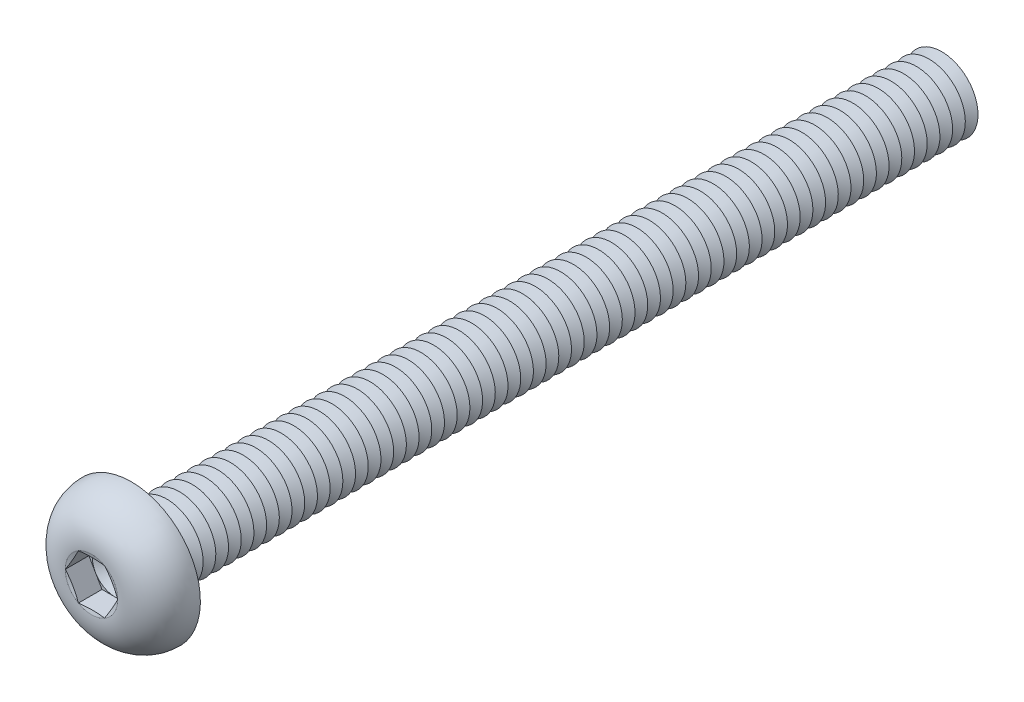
ISO-10303-21;
HEADER;
FILE_DESCRIPTION(('STEP AP214'),'2;1');
FILE_NAME('part.step','',(''),(''),'','','');
FILE_SCHEMA(('AUTOMOTIVE_DESIGN { 1 0 10303 214 1 1 1 1 }'));
ENDSEC;
DATA;
#1=APPLICATION_CONTEXT('core data for automotive mechanical design processes');
#2=APPLICATION_PROTOCOL_DEFINITION('international standard','automotive_design',2000,#1);
#3=PRODUCT_CONTEXT('',#1,'mechanical');
#4=PRODUCT('Part','Part','',(#3));
#5=PRODUCT_RELATED_PRODUCT_CATEGORY('part','',(#4));
#6=PRODUCT_DEFINITION_FORMATION('','',#4);
#7=PRODUCT_DEFINITION_CONTEXT('part definition',#1,'design');
#8=PRODUCT_DEFINITION('design','',#6,#7);
#9=PRODUCT_DEFINITION_SHAPE('','',#8);
#10=(LENGTH_UNIT() NAMED_UNIT(*) SI_UNIT(.MILLI.,.METRE.));
#11=(NAMED_UNIT(*) PLANE_ANGLE_UNIT() SI_UNIT($,.RADIAN.));
#12=(NAMED_UNIT(*) SI_UNIT($,.STERADIAN.) SOLID_ANGLE_UNIT());
#13=UNCERTAINTY_MEASURE_WITH_UNIT(LENGTH_MEASURE(1.E-05),#10,'distance_accuracy_value','');
#14=(GEOMETRIC_REPRESENTATION_CONTEXT(3) GLOBAL_UNCERTAINTY_ASSIGNED_CONTEXT((#13)) GLOBAL_UNIT_ASSIGNED_CONTEXT((#10,
#11,#12)) REPRESENTATION_CONTEXT('',''));
#15=CARTESIAN_POINT('',(0.,0.,0.));
#16=DIRECTION('',(0.,0.,1.));
#17=DIRECTION('',(1.,0.,0.));
#18=AXIS2_PLACEMENT_3D('',#15,#16,#17);
#19=CARTESIAN_POINT('',(0.,0.,0.899999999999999));
#20=DIRECTION('',(0.,0.,1.));
#21=DIRECTION('',(1.,0.,0.));
#22=AXIS2_PLACEMENT_3D('',#19,#20,#21);
#23=PLANE('',#22);
#24=CARTESIAN_POINT('',(0.,0.,0.899999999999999));
#25=DIRECTION('',(0.,0.,1.));
#26=DIRECTION('',(1.,0.,0.));
#27=AXIS2_PLACEMENT_3D('',#24,#25,#26);
#28=CIRCLE('',#27,1.24999941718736);
#29=CARTESIAN_POINT('',(1.08253125,0.624999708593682,0.899999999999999));
#30=VERTEX_POINT('',#29);
#31=CARTESIAN_POINT('',(0.,1.24999941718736,0.899999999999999));
#32=VERTEX_POINT('',#31);
#33=EDGE_CURVE('E118',#30,#32,#28,.T.);
#34=ORIENTED_EDGE('',*,*,#33,.F.);
#35=DIRECTION('',(-0.5,0.866025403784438,0.));
#36=VECTOR('',#35,1.);
#37=CARTESIAN_POINT('',(1.443375,0.,0.899999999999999));
#38=LINE('',#37,#36);
#39=CARTESIAN_POINT('',(0.7216875,1.24999941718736,0.899999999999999));
#40=VERTEX_POINT('',#39);
#41=EDGE_CURVE('E125',#30,#40,#38,.T.);
#42=ORIENTED_EDGE('',*,*,#41,.T.);
#43=DIRECTION('',(-1.,0.,0.));
#44=VECTOR('',#43,1.);
#45=CARTESIAN_POINT('',(0.7216875,1.24999941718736,0.899999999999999));
#46=LINE('',#45,#44);
#47=EDGE_CURVE('E136',#40,#32,#46,.T.);
#48=ORIENTED_EDGE('',*,*,#47,.T.);
#49=EDGE_LOOP('',(#34,#42,#48));
#50=FACE_BOUND('',#49,.T.);
#51=ADVANCED_FACE('F39',(#50),#23,.T.);
#52=CARTESIAN_POINT('',(0.,0.,0.899999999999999));
#53=DIRECTION('',(0.,0.,1.));
#54=DIRECTION('',(1.,0.,0.));
#55=AXIS2_PLACEMENT_3D('',#52,#53,#54);
#56=CIRCLE('',#55,1.24999941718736);
#57=CARTESIAN_POINT('',(-1.08253125,0.624999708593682,0.899999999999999));
#58=VERTEX_POINT('',#57);
#59=EDGE_CURVE('E11',#32,#58,#56,.T.);
#60=ORIENTED_EDGE('',*,*,#59,.F.);
#61=CARTESIAN_POINT('',(-0.721687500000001,1.24999941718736,0.899999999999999));
#62=VERTEX_POINT('',#61);
#63=EDGE_CURVE('E131',#32,#62,#46,.T.);
#64=ORIENTED_EDGE('',*,*,#63,.T.);
#65=DIRECTION('',(-0.5,-0.866025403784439,0.));
#66=VECTOR('',#65,1.);
#67=CARTESIAN_POINT('',(-0.721687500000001,1.24999941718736,0.899999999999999));
#68=LINE('',#67,#66);
#69=EDGE_CURVE('E134',#62,#58,#68,.T.);
#70=ORIENTED_EDGE('',*,*,#69,.T.);
#71=EDGE_LOOP('',(#60,#64,#70));
#72=FACE_BOUND('',#71,.T.);
#73=ADVANCED_FACE('F130',(#72),#23,.T.);
#74=CARTESIAN_POINT('',(-1.08253125,-0.624999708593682,0.899999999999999));
#75=VERTEX_POINT('',#74);
#76=EDGE_CURVE('E49',#58,#75,#56,.T.);
#77=ORIENTED_EDGE('',*,*,#76,.F.);
#78=CARTESIAN_POINT('',(-1.443375,0.,0.899999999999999));
#79=VERTEX_POINT('',#78);
#80=EDGE_CURVE('E143',#58,#79,#68,.T.);
#81=ORIENTED_EDGE('',*,*,#80,.T.);
#82=DIRECTION('',(0.5,-0.866025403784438,0.));
#83=VECTOR('',#82,1.);
#84=CARTESIAN_POINT('',(-1.443375,0.,0.899999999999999));
#85=LINE('',#84,#83);
#86=EDGE_CURVE('E152',#79,#75,#85,.T.);
#87=ORIENTED_EDGE('',*,*,#86,.T.);
#88=EDGE_LOOP('',(#77,#81,#87));
#89=FACE_BOUND('',#88,.T.);
#90=ADVANCED_FACE('F783',(#89),#23,.T.);
#91=CARTESIAN_POINT('',(0.,-1.24999941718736,0.899999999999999));
#92=VERTEX_POINT('',#91);
#93=EDGE_CURVE('E768',#75,#92,#56,.T.);
#94=ORIENTED_EDGE('',*,*,#93,.F.);
#95=CARTESIAN_POINT('',(-0.721687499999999,-1.24999941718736,0.899999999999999));
#96=VERTEX_POINT('',#95);
#97=EDGE_CURVE('E151',#75,#96,#85,.T.);
#98=ORIENTED_EDGE('',*,*,#97,.T.);
#99=DIRECTION('',(1.,0.,0.));
#100=VECTOR('',#99,1.);
#101=CARTESIAN_POINT('',(-0.721687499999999,-1.24999941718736,0.899999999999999));
#102=LINE('',#101,#100);
#103=EDGE_CURVE('E157',#96,#92,#102,.T.);
#104=ORIENTED_EDGE('',*,*,#103,.T.);
#105=EDGE_LOOP('',(#94,#98,#104));
#106=FACE_BOUND('',#105,.T.);
#107=ADVANCED_FACE('F776',(#106),#23,.T.);
#108=CARTESIAN_POINT('',(1.08253125,-0.624999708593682,0.899999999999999));
#109=VERTEX_POINT('',#108);
#110=EDGE_CURVE('E56',#92,#109,#56,.T.);
#111=ORIENTED_EDGE('',*,*,#110,.F.);
#112=CARTESIAN_POINT('',(0.721687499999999,-1.24999941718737,0.899999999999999));
#113=VERTEX_POINT('',#112);
#114=EDGE_CURVE('E156',#92,#113,#102,.T.);
#115=ORIENTED_EDGE('',*,*,#114,.T.);
#116=DIRECTION('',(0.5,0.866025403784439,0.));
#117=VECTOR('',#116,1.);
#118=CARTESIAN_POINT('',(0.721687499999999,-1.24999941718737,0.899999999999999));
#119=LINE('',#118,#117);
#120=EDGE_CURVE('E162',#113,#109,#119,.T.);
#121=ORIENTED_EDGE('',*,*,#120,.T.);
#122=EDGE_LOOP('',(#111,#115,#121));
#123=FACE_BOUND('',#122,.T.);
#124=ADVANCED_FACE('F854',(#123),#23,.T.);
#125=CARTESIAN_POINT('',(0.,0.,2.2));
#126=DIRECTION('',(0.,0.,1.));
#127=DIRECTION('',(0.,-1.,0.));
#128=AXIS2_PLACEMENT_3D('',#125,#126,#127);
#129=CONICAL_SURFACE('',#128,1.443375,1.30899693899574);
#130=CARTESIAN_POINT('',(1.44349047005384,-0.000200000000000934,2.20003094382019));
#131=CARTESIAN_POINT('',(1.41351104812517,0.0517258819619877,2.19199301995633));
#132=CARTESIAN_POINT('',(1.38347725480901,0.103745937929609,2.18469579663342));
#133=CARTESIAN_POINT('',(1.32330355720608,0.20796983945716,2.17187512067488));
#134=CARTESIAN_POINT('',(1.29316361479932,0.260173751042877,2.16635238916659));
#135=CARTESIAN_POINT('',(1.23296043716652,0.364448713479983,2.15740323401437));
#136=CARTESIAN_POINT('',(1.20289760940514,0.416519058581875,2.15396613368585));
#137=CARTESIAN_POINT('',(1.14273359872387,0.520726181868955,2.14935732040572));
#138=CARTESIAN_POINT('',(1.11263242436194,0.572862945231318,2.14818516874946));
#139=CARTESIAN_POINT('',(1.05243007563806,0.677136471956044,2.14818516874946));
#140=CARTESIAN_POINT('',(1.02232890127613,0.729273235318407,2.14935732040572));
#141=CARTESIAN_POINT('',(0.962164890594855,0.833480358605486,2.15396613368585));
#142=CARTESIAN_POINT('',(0.932102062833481,0.885550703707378,2.15740323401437));
#143=CARTESIAN_POINT('',(0.87189888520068,0.989825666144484,2.16635238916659));
#144=CARTESIAN_POINT('',(0.841758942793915,1.0420295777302,2.17187512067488));
#145=CARTESIAN_POINT('',(0.78158524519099,1.14625347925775,2.18469579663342));
#146=CARTESIAN_POINT('',(0.751551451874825,1.19827353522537,2.19199301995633));
#147=CARTESIAN_POINT('',(0.721572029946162,1.25019941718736,2.20003094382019));
#148=B_SPLINE_CURVE_WITH_KNOTS('',3,(#130,#131,#132,#133,#134,#135,#136,#137,#138,#139,#140,
#141,#142,#143,#144,#145,#146,#147),.UNSPECIFIED.,.F.,.F.,(4,2,2,2,2,2,2,2,4),(0.,
0.181495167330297,0.363063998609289,0.543695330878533,0.724291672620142,0.904888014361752,
1.08551934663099,1.26708817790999,1.44858334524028),.UNSPECIFIED.);
#149=CARTESIAN_POINT('',(1.443375,0.,2.2));
#150=VERTEX_POINT('',#149);
#151=CARTESIAN_POINT('',(0.72168750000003,1.24999941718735,2.2));
#152=VERTEX_POINT('',#151);
#153=EDGE_CURVE('E222',#150,#152,#148,.T.);
#154=ORIENTED_EDGE('',*,*,#153,.F.);
#155=CARTESIAN_POINT('',(0.,0.,2.2));
#156=DIRECTION('',(0.,0.,-1.));
#157=DIRECTION('',(0.,1.,0.));
#158=AXIS2_PLACEMENT_3D('',#155,#156,#157);
#159=CIRCLE('',#158,1.443375);
#160=EDGE_CURVE('E749',#152,#150,#159,.T.);
#161=ORIENTED_EDGE('',*,*,#160,.F.);
#162=EDGE_LOOP('',(#154,#161));
#163=FACE_BOUND('',#162,.T.);
#164=ADVANCED_FACE('F858',(#163),#129,.F.);
#165=CARTESIAN_POINT('',(0.721572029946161,-1.25019941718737,2.20003094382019));
#166=CARTESIAN_POINT('',(0.751551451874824,-1.19827353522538,2.19199301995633));
#167=CARTESIAN_POINT('',(0.78158524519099,-1.14625347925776,2.18469579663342));
#168=CARTESIAN_POINT('',(0.841758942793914,-1.0420295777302,2.17187512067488));
#169=CARTESIAN_POINT('',(0.87189888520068,-0.989825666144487,2.16635238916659));
#170=CARTESIAN_POINT('',(0.932102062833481,-0.885550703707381,2.15740323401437));
#171=CARTESIAN_POINT('',(0.962164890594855,-0.833480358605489,2.15396613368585));
#172=CARTESIAN_POINT('',(1.02232890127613,-0.729273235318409,2.14935732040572));
#173=CARTESIAN_POINT('',(1.05243007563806,-0.677136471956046,2.14818516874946));
#174=CARTESIAN_POINT('',(1.11263242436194,-0.57286294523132,2.14818516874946));
#175=CARTESIAN_POINT('',(1.14273359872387,-0.520726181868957,2.14935732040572));
#176=CARTESIAN_POINT('',(1.20289760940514,-0.416519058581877,2.15396613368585));
#177=CARTESIAN_POINT('',(1.23296043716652,-0.364448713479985,2.15740323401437));
#178=CARTESIAN_POINT('',(1.29316361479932,-0.260173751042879,2.16635238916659));
#179=CARTESIAN_POINT('',(1.32330355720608,-0.207969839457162,2.17187512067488));
#180=CARTESIAN_POINT('',(1.38347725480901,-0.103745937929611,2.18469579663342));
#181=CARTESIAN_POINT('',(1.41351104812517,-0.0517258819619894,2.19199301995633));
#182=CARTESIAN_POINT('',(1.44349047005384,0.000199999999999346,2.20003094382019));
#183=B_SPLINE_CURVE_WITH_KNOTS('',3,(#165,#166,#167,#168,#169,#170,#171,#172,#173,#174,#175,
#176,#177,#178,#179,#180,#181,#182),.UNSPECIFIED.,.F.,.F.,(4,2,2,2,2,2,2,2,4),(0.,
0.181495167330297,0.36306399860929,0.543695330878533,0.724291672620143,0.904888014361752,
1.085519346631,1.26708817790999,1.44858334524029),.UNSPECIFIED.);
#184=CARTESIAN_POINT('',(0.721687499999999,-1.24999941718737,2.2));
#185=VERTEX_POINT('',#184);
#186=EDGE_CURVE('E231',#185,#150,#183,.T.);
#187=ORIENTED_EDGE('',*,*,#186,.F.);
#188=EDGE_CURVE('E754',#150,#185,#159,.T.);
#189=ORIENTED_EDGE('',*,*,#188,.F.);
#190=EDGE_LOOP('',(#187,#189));
#191=FACE_BOUND('',#190,.T.);
#192=ADVANCED_FACE('F820',(#191),#129,.F.);
#193=CARTESIAN_POINT('',(-2.17815859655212,-1.24999941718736,2.48616275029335));
#194=CARTESIAN_POINT('',(-2.07269794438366,-1.24999941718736,2.4616881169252));
#195=CARTESIAN_POINT('',(-1.96714913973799,-1.24999941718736,2.43756889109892));
#196=CARTESIAN_POINT('',(-1.75576352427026,-1.24999941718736,2.39052699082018));
#197=CARTESIAN_POINT('',(-1.64992665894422,-1.24999941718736,2.36760456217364));
#198=CARTESIAN_POINT('',(-1.43690237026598,-1.24999941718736,2.3232454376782));
#199=CARTESIAN_POINT('',(-1.32971158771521,-1.24999941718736,2.30182468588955));
#200=CARTESIAN_POINT('',(-1.11482745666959,-1.24999941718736,2.26156703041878));
#201=CARTESIAN_POINT('',(-1.00713406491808,-1.24999941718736,2.24273035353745));
#202=CARTESIAN_POINT('',(-0.794044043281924,-1.24999941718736,2.2093913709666));
#203=CARTESIAN_POINT('',(-0.688664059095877,-1.24999941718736,2.19478562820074));
#204=CARTESIAN_POINT('',(-0.477310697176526,-1.24999941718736,2.17085809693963));
#205=CARTESIAN_POINT('',(-0.371337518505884,-1.24999941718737,2.16153463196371));
#206=CARTESIAN_POINT('',(-0.159455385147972,-1.24999941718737,2.14976770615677));
#207=CARTESIAN_POINT('',(-0.0535482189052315,-1.24999941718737,2.14729400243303));
#208=CARTESIAN_POINT('',(0.158189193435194,-1.24999941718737,2.14966287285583));
#209=CARTESIAN_POINT('',(0.264019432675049,-1.24999941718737,2.15450603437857));
#210=CARTESIAN_POINT('',(0.445148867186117,-1.24999941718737,2.16825380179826));
#211=CARTESIAN_POINT('',(0.520574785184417,-1.24999941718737,2.17561242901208));
#212=CARTESIAN_POINT('',(0.671115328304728,-1.24999941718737,2.19297000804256));
#213=CARTESIAN_POINT('',(0.746229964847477,-1.24999941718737,2.20296886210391));
#214=CARTESIAN_POINT('',(0.896387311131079,-1.24999941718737,2.22505910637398));
#215=CARTESIAN_POINT('',(0.971429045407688,-1.24999941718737,2.23715700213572));
#216=CARTESIAN_POINT('',(1.12124320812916,-1.24999941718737,2.26292371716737));
#217=CARTESIAN_POINT('',(1.19601562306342,-1.24999941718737,2.27659261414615));
#218=CARTESIAN_POINT('',(1.34686913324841,-1.24999941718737,2.30540811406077));
#219=CARTESIAN_POINT('',(1.42294548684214,-1.24999941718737,2.32057934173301));
#220=CARTESIAN_POINT('',(1.57490676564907,-1.24999941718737,2.35185113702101));
#221=CARTESIAN_POINT('',(1.65079168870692,-1.24999941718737,2.36795171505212));
#222=CARTESIAN_POINT('',(1.80199501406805,-1.24999941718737,2.40076814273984));
#223=CARTESIAN_POINT('',(1.87731425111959,-1.24999941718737,2.41748016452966));
#224=CARTESIAN_POINT('',(2.02782424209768,-1.24999941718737,2.45144971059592));
#225=CARTESIAN_POINT('',(2.10301500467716,-1.24999941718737,2.46870719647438));
#226=CARTESIAN_POINT('',(2.17815859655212,-1.24999941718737,2.48616275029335));
#227=B_SPLINE_CURVE_WITH_KNOTS('',3,(#193,#194,#195,#196,#197,#198,#199,#200,#201,#202,#203,
#204,#205,#206,#207,#208,#209,#210,#211,#212,#213,#214,#215,#216,#217,#218,#219,#220,#221,#222,
#223,#224,#225,#226),.UNSPECIFIED.,.F.,.F.,(4,2,2,2,2,2,2,2,2,2,2,2,2,2,2,2,4),(0.,
0.324797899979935,0.649662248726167,0.97757231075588,1.30551113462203,1.62458166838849,
1.94355087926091,2.26110952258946,2.5786936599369,2.80599541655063,3.03328875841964,
3.2612995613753,3.48932164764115,3.7220371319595,3.95475522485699,4.18620606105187,
4.41764064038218),.UNSPECIFIED.);
#228=CARTESIAN_POINT('',(-0.721687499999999,-1.24999941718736,2.2));
#229=VERTEX_POINT('',#228);
#230=EDGE_CURVE('E797',#229,#185,#227,.T.);
#231=ORIENTED_EDGE('',*,*,#230,.F.);
#232=EDGE_CURVE('E810',#185,#229,#159,.T.);
#233=ORIENTED_EDGE('',*,*,#232,.F.);
#234=EDGE_LOOP('',(#231,#233));
#235=FACE_BOUND('',#234,.T.);
#236=ADVANCED_FACE('F826',(#235),#129,.F.);
#237=CARTESIAN_POINT('',(-1.44349047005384,0.000199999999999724,2.20003094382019));
#238=CARTESIAN_POINT('',(-1.41351104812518,-0.0517258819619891,2.19199301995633));
#239=CARTESIAN_POINT('',(-1.38347725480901,-0.103745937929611,2.18469579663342));
#240=CARTESIAN_POINT('',(-1.32330355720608,-0.207969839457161,2.17187512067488));
#241=CARTESIAN_POINT('',(-1.29316361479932,-0.260173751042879,2.16635238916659));
#242=CARTESIAN_POINT('',(-1.23296043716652,-0.364448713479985,2.15740323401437));
#243=CARTESIAN_POINT('',(-1.20289760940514,-0.416519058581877,2.15396613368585));
#244=CARTESIAN_POINT('',(-1.14273359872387,-0.520726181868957,2.14935732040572));
#245=CARTESIAN_POINT('',(-1.11263242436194,-0.57286294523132,2.14818516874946));
#246=CARTESIAN_POINT('',(-1.05243007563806,-0.677136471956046,2.14818516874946));
#247=CARTESIAN_POINT('',(-1.02232890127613,-0.729273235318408,2.14935732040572));
#248=CARTESIAN_POINT('',(-0.962164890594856,-0.833480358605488,2.15396613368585));
#249=CARTESIAN_POINT('',(-0.932102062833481,-0.885550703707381,2.15740323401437));
#250=CARTESIAN_POINT('',(-0.87189888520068,-0.989825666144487,2.16635238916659));
#251=CARTESIAN_POINT('',(-0.841758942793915,-1.0420295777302,2.17187512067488));
#252=CARTESIAN_POINT('',(-0.78158524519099,-1.14625347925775,2.18469579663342));
#253=CARTESIAN_POINT('',(-0.751551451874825,-1.19827353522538,2.19199301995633));
#254=CARTESIAN_POINT('',(-0.721572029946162,-1.25019941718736,2.20003094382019));
#255=B_SPLINE_CURVE_WITH_KNOTS('',3,(#237,#238,#239,#240,#241,#242,#243,#244,#245,#246,#247,
#248,#249,#250,#251,#252,#253,#254),.UNSPECIFIED.,.F.,.F.,(4,2,2,2,2,2,2,2,4),(0.,
0.181495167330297,0.36306399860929,0.543695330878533,0.724291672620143,0.904888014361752,
1.085519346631,1.26708817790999,1.44858334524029),.UNSPECIFIED.);
#256=CARTESIAN_POINT('',(-1.443375,0.,2.2));
#257=VERTEX_POINT('',#256);
#258=EDGE_CURVE('E788',#257,#229,#255,.T.);
#259=ORIENTED_EDGE('',*,*,#258,.F.);
#260=EDGE_CURVE('E794',#229,#257,#159,.T.);
#261=ORIENTED_EDGE('',*,*,#260,.F.);
#262=EDGE_LOOP('',(#259,#261));
#263=FACE_BOUND('',#262,.T.);
#264=ADVANCED_FACE('F792',(#263),#129,.F.);
#265=CARTESIAN_POINT('',(-0.721572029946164,1.25019941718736,2.20003094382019));
#266=CARTESIAN_POINT('',(-0.751551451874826,1.19827353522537,2.19199301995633));
#267=CARTESIAN_POINT('',(-0.781585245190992,1.14625347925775,2.18469579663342));
#268=CARTESIAN_POINT('',(-0.841758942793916,1.0420295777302,2.17187512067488));
#269=CARTESIAN_POINT('',(-0.871898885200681,0.989825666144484,2.16635238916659));
#270=CARTESIAN_POINT('',(-0.932102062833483,0.885550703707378,2.15740323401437));
#271=CARTESIAN_POINT('',(-0.962164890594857,0.833480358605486,2.15396613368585));
#272=CARTESIAN_POINT('',(-1.02232890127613,0.729273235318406,2.14935732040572));
#273=CARTESIAN_POINT('',(-1.05243007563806,0.677136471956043,2.14818516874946));
#274=CARTESIAN_POINT('',(-1.11263242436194,0.572862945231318,2.14818516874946));
#275=CARTESIAN_POINT('',(-1.14273359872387,0.520726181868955,2.14935732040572));
#276=CARTESIAN_POINT('',(-1.20289760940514,0.416519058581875,2.15396613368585));
#277=CARTESIAN_POINT('',(-1.23296043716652,0.364448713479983,2.15740323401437));
#278=CARTESIAN_POINT('',(-1.29316361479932,0.260173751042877,2.16635238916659));
#279=CARTESIAN_POINT('',(-1.32330355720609,0.20796983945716,2.17187512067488));
#280=CARTESIAN_POINT('',(-1.38347725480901,0.10374593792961,2.18469579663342));
#281=CARTESIAN_POINT('',(-1.41351104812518,0.0517258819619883,2.19199301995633));
#282=CARTESIAN_POINT('',(-1.44349047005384,-0.000200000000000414,2.20003094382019));
#283=B_SPLINE_CURVE_WITH_KNOTS('',3,(#265,#266,#267,#268,#269,#270,#271,#272,#273,#274,#275,
#276,#277,#278,#279,#280,#281,#282),.UNSPECIFIED.,.F.,.F.,(4,2,2,2,2,2,2,2,4),(0.,
0.181495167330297,0.363063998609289,0.543695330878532,0.724291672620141,0.90488801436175,
1.08551934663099,1.26708817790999,1.44858334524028),.UNSPECIFIED.);
#284=CARTESIAN_POINT('',(-0.721687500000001,1.24999941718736,2.2));
#285=VERTEX_POINT('',#284);
#286=EDGE_CURVE('E195',#285,#257,#283,.T.);
#287=ORIENTED_EDGE('',*,*,#286,.F.);
#288=EDGE_CURVE('E800',#257,#285,#159,.T.);
#289=ORIENTED_EDGE('',*,*,#288,.F.);
#290=EDGE_LOOP('',(#287,#289));
#291=FACE_BOUND('',#290,.T.);
#292=ADVANCED_FACE('F801',(#291),#129,.F.);
#293=CARTESIAN_POINT('',(0.,0.,-42.55));
#294=DIRECTION('',(0.,0.,1.));
#295=DIRECTION('',(0.,-1.,0.));
#296=AXIS2_PLACEMENT_3D('',#293,#294,#295);
#297=CONICAL_SURFACE('',#296,1.99999999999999,1.04719755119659);
#298=CARTESIAN_POINT('',(0.,0.,-42.9));
#299=DIRECTION('',(0.,0.,1.));
#300=DIRECTION('',(0.,-1.,0.));
#301=AXIS2_PLACEMENT_3D('',#298,#299,#300);
#302=CIRCLE('',#301,1.39378221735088);
#303=CARTESIAN_POINT('',(0.,-1.39378221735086,-42.9));
#304=VERTEX_POINT('',#303);
#305=EDGE_CURVE('E720',#304,#304,#302,.T.);
#306=ORIENTED_EDGE('',*,*,#305,.T.);
#307=EDGE_LOOP('',(#306));
#308=FACE_BOUND('',#307,.T.);
#309=CARTESIAN_POINT('',(0.,0.,-42.55));
#310=DIRECTION('',(0.,0.,1.));
#311=DIRECTION('',(0.,-1.,0.));
#312=AXIS2_PLACEMENT_3D('',#309,#310,#311);
#313=CIRCLE('',#312,1.99999999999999);
#314=CARTESIAN_POINT('',(0.,-1.99999999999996,-42.55));
#315=VERTEX_POINT('',#314);
#316=EDGE_CURVE('E716',#315,#315,#313,.T.);
#317=ORIENTED_EDGE('',*,*,#316,.F.);
#318=EDGE_LOOP('',(#317));
#319=FACE_BOUND('',#318,.T.);
#320=ADVANCED_FACE('F885',(#308,#319),#297,.T.);
#321=CARTESIAN_POINT('',(0.,0.,-42.9));
#322=DIRECTION('',(0.,0.,-1.));
#323=DIRECTION('',(0.,1.,0.));
#324=AXIS2_PLACEMENT_3D('',#321,#322,#323);
#325=CONICAL_SURFACE('',#324,1.39378221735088,1.0471975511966);
#326=CARTESIAN_POINT('',(0.,0.,-43.25));
#327=DIRECTION('',(0.,0.,1.));
#328=DIRECTION('',(0.,-1.,0.));
#329=AXIS2_PLACEMENT_3D('',#326,#327,#328);
#330=CIRCLE('',#329,1.99999999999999);
#331=CARTESIAN_POINT('',(0.,-1.99999999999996,-43.25));
#332=VERTEX_POINT('',#331);
#333=EDGE_CURVE('E724',#332,#332,#330,.T.);
#334=ORIENTED_EDGE('',*,*,#333,.T.);
#335=EDGE_LOOP('',(#334));
#336=FACE_BOUND('',#335,.T.);
#337=ORIENTED_EDGE('',*,*,#305,.F.);
#338=EDGE_LOOP('',(#337));
#339=FACE_BOUND('',#338,.T.);
#340=ADVANCED_FACE('F890',(#336,#339),#325,.T.);
#341=CARTESIAN_POINT('',(0.,2.,-45.));
#342=DIRECTION('',(0.,0.,-1.));
#343=DIRECTION('',(0.,1.,0.));
#344=AXIS2_PLACEMENT_3D('',#341,#342,#343);
#345=PLANE('',#344);
#346=CARTESIAN_POINT('',(0.,0.,-45.));
#347=DIRECTION('',(0.,0.,1.));
#348=DIRECTION('',(0.,-1.,0.));
#349=AXIS2_PLACEMENT_3D('',#346,#347,#348);
#350=CIRCLE('',#349,1.39378221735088);
#351=CARTESIAN_POINT('',(0.,-1.39378221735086,-45.));
#352=VERTEX_POINT('',#351);
#353=EDGE_CURVE('E744',#352,#352,#350,.T.);
#354=ORIENTED_EDGE('',*,*,#353,.F.);
#355=EDGE_LOOP('',(#354));
#356=FACE_BOUND('',#355,.T.);
#357=ADVANCED_FACE('F1065',(#356),#345,.T.);
#358=CARTESIAN_POINT('',(0.,0.,-44.65));
#359=DIRECTION('',(0.,0.,1.));
#360=DIRECTION('',(0.,-1.,0.));
#361=AXIS2_PLACEMENT_3D('',#358,#359,#360);
#362=CONICAL_SURFACE('',#361,1.99999999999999,1.04719755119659);
#363=ORIENTED_EDGE('',*,*,#353,.T.);
#364=EDGE_LOOP('',(#363));
#365=FACE_BOUND('',#364,.T.);
#366=CARTESIAN_POINT('',(0.,0.,-44.65));
#367=DIRECTION('',(0.,0.,1.));
#368=DIRECTION('',(0.,-1.,0.));
#369=AXIS2_PLACEMENT_3D('',#366,#367,#368);
#370=CIRCLE('',#369,1.99999999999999);
#371=CARTESIAN_POINT('',(0.,-1.99999999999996,-44.65));
#372=VERTEX_POINT('',#371);
#373=EDGE_CURVE('E740',#372,#372,#370,.T.);
#374=ORIENTED_EDGE('',*,*,#373,.F.);
#375=EDGE_LOOP('',(#374));
#376=FACE_BOUND('',#375,.T.);
#377=ADVANCED_FACE('F1058',(#365,#376),#362,.T.);
#378=CARTESIAN_POINT('',(0.,0.,-44.3));
#379=DIRECTION('',(0.,0.,-1.));
#380=DIRECTION('',(0.,1.,0.));
#381=AXIS2_PLACEMENT_3D('',#378,#379,#380);
#382=CONICAL_SURFACE('',#381,1.39378221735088,1.0471975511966);
#383=ORIENTED_EDGE('',*,*,#373,.T.);
#384=EDGE_LOOP('',(#383));
#385=FACE_BOUND('',#384,.T.);
#386=CARTESIAN_POINT('',(0.,0.,-44.3));
#387=DIRECTION('',(0.,0.,1.));
#388=DIRECTION('',(0.,-1.,0.));
#389=AXIS2_PLACEMENT_3D('',#386,#387,#388);
#390=CIRCLE('',#389,1.39378221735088);
#391=CARTESIAN_POINT('',(0.,-1.39378221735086,-44.3));
#392=VERTEX_POINT('',#391);
#393=EDGE_CURVE('E736',#392,#392,#390,.T.);
#394=ORIENTED_EDGE('',*,*,#393,.F.);
#395=EDGE_LOOP('',(#394));
#396=FACE_BOUND('',#395,.T.);
#397=ADVANCED_FACE('F1064',(#385,#396),#382,.T.);
#398=CARTESIAN_POINT('',(0.,0.,-43.95));
#399=DIRECTION('',(0.,0.,1.));
#400=DIRECTION('',(0.,-1.,0.));
#401=AXIS2_PLACEMENT_3D('',#398,#399,#400);
#402=CONICAL_SURFACE('',#401,1.99999999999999,1.04719755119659);
#403=ORIENTED_EDGE('',*,*,#393,.T.);
#404=EDGE_LOOP('',(#403));
#405=FACE_BOUND('',#404,.T.);
#406=CARTESIAN_POINT('',(0.,0.,-43.95));
#407=DIRECTION('',(0.,0.,1.));
#408=DIRECTION('',(0.,-1.,0.));
#409=AXIS2_PLACEMENT_3D('',#406,#407,#408);
#410=CIRCLE('',#409,1.99999999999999);
#411=CARTESIAN_POINT('',(0.,-1.99999999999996,-43.95));
#412=VERTEX_POINT('',#411);
#413=EDGE_CURVE('E732',#412,#412,#410,.T.);
#414=ORIENTED_EDGE('',*,*,#413,.F.);
#415=EDGE_LOOP('',(#414));
#416=FACE_BOUND('',#415,.T.);
#417=ADVANCED_FACE('F1096',(#405,#416),#402,.T.);
#418=CARTESIAN_POINT('',(0.,0.,-43.6));
#419=DIRECTION('',(0.,0.,-1.));
#420=DIRECTION('',(0.,1.,0.));
#421=AXIS2_PLACEMENT_3D('',#418,#419,#420);
#422=CONICAL_SURFACE('',#421,1.39378221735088,1.0471975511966);
#423=ORIENTED_EDGE('',*,*,#413,.T.);
#424=EDGE_LOOP('',(#423));
#425=FACE_BOUND('',#424,.T.);
#426=CARTESIAN_POINT('',(0.,0.,-43.6));
#427=DIRECTION('',(0.,0.,1.));
#428=DIRECTION('',(0.,-1.,0.));
#429=AXIS2_PLACEMENT_3D('',#426,#427,#428);
#430=CIRCLE('',#429,1.39378221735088);
#431=CARTESIAN_POINT('',(0.,-1.39378221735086,-43.6));
#432=VERTEX_POINT('',#431);
#433=EDGE_CURVE('E728',#432,#432,#430,.T.);
#434=ORIENTED_EDGE('',*,*,#433,.F.);
#435=EDGE_LOOP('',(#434));
#436=FACE_BOUND('',#435,.T.);
#437=ADVANCED_FACE('F1106',(#425,#436),#422,.T.);
#438=CARTESIAN_POINT('',(0.,0.,-43.25));
#439=DIRECTION('',(0.,0.,1.));
#440=DIRECTION('',(0.,-1.,0.));
#441=AXIS2_PLACEMENT_3D('',#438,#439,#440);
#442=CONICAL_SURFACE('',#441,1.99999999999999,1.04719755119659);
#443=ORIENTED_EDGE('',*,*,#433,.T.);
#444=EDGE_LOOP('',(#443));
#445=FACE_BOUND('',#444,.T.);
#446=ORIENTED_EDGE('',*,*,#333,.F.);
#447=EDGE_LOOP('',(#446));
#448=FACE_BOUND('',#447,.T.);
#449=ADVANCED_FACE('F1116',(#445,#448),#442,.T.);
#450=CARTESIAN_POINT('',(0.,0.,-41.85));
#451=DIRECTION('',(0.,0.,1.));
#452=DIRECTION('',(0.,-1.,0.));
#453=AXIS2_PLACEMENT_3D('',#450,#451,#452);
#454=CONICAL_SURFACE('',#453,1.99999999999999,1.04719755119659);
#455=CARTESIAN_POINT('',(0.,0.,-42.2));
#456=DIRECTION('',(0.,0.,1.));
#457=DIRECTION('',(0.,-1.,0.));
#458=AXIS2_PLACEMENT_3D('',#455,#456,#457);
#459=CIRCLE('',#458,1.39378221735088);
#460=CARTESIAN_POINT('',(0.,-1.39378221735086,-42.2));
#461=VERTEX_POINT('',#460);
#462=EDGE_CURVE('E712',#461,#461,#459,.T.);
#463=ORIENTED_EDGE('',*,*,#462,.T.);
#464=EDGE_LOOP('',(#463));
#465=FACE_BOUND('',#464,.T.);
#466=CARTESIAN_POINT('',(0.,0.,-41.85));
#467=DIRECTION('',(0.,0.,1.));
#468=DIRECTION('',(0.,-1.,0.));
#469=AXIS2_PLACEMENT_3D('',#466,#467,#468);
#470=CIRCLE('',#469,1.99999999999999);
#471=CARTESIAN_POINT('',(0.,-1.99999999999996,-41.85));
#472=VERTEX_POINT('',#471);
#473=EDGE_CURVE('E708',#472,#472,#470,.T.);
#474=ORIENTED_EDGE('',*,*,#473,.F.);
#475=EDGE_LOOP('',(#474));
#476=FACE_BOUND('',#475,.T.);
#477=ADVANCED_FACE('F1126',(#465,#476),#454,.T.);
#478=CARTESIAN_POINT('',(0.,0.,-42.2));
#479=DIRECTION('',(0.,0.,-1.));
#480=DIRECTION('',(0.,1.,0.));
#481=AXIS2_PLACEMENT_3D('',#478,#479,#480);
#482=CONICAL_SURFACE('',#481,1.39378221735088,1.0471975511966);
#483=ORIENTED_EDGE('',*,*,#316,.T.);
#484=EDGE_LOOP('',(#483));
#485=FACE_BOUND('',#484,.T.);
#486=ORIENTED_EDGE('',*,*,#462,.F.);
#487=EDGE_LOOP('',(#486));
#488=FACE_BOUND('',#487,.T.);
#489=ADVANCED_FACE('F1136',(#485,#488),#482,.T.);
#490=CARTESIAN_POINT('',(0.,0.,-41.15));
#491=DIRECTION('',(0.,0.,1.));
#492=DIRECTION('',(0.,-1.,0.));
#493=AXIS2_PLACEMENT_3D('',#490,#491,#492);
#494=CONICAL_SURFACE('',#493,1.99999999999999,1.04719755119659);
#495=CARTESIAN_POINT('',(0.,0.,-41.5));
#496=DIRECTION('',(0.,0.,1.));
#497=DIRECTION('',(0.,-1.,0.));
#498=AXIS2_PLACEMENT_3D('',#495,#496,#497);
#499=CIRCLE('',#498,1.39378221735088);
#500=CARTESIAN_POINT('',(0.,-1.39378221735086,-41.5));
#501=VERTEX_POINT('',#500);
#502=EDGE_CURVE('E704',#501,#501,#499,.T.);
#503=ORIENTED_EDGE('',*,*,#502,.T.);
#504=EDGE_LOOP('',(#503));
#505=FACE_BOUND('',#504,.T.);
#506=CARTESIAN_POINT('',(0.,0.,-41.15));
#507=DIRECTION('',(0.,0.,1.));
#508=DIRECTION('',(0.,-1.,0.));
#509=AXIS2_PLACEMENT_3D('',#506,#507,#508);
#510=CIRCLE('',#509,1.99999999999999);
#511=CARTESIAN_POINT('',(0.,-1.99999999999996,-41.15));
#512=VERTEX_POINT('',#511);
#513=EDGE_CURVE('E700',#512,#512,#510,.T.);
#514=ORIENTED_EDGE('',*,*,#513,.F.);
#515=EDGE_LOOP('',(#514));
#516=FACE_BOUND('',#515,.T.);
#517=ADVANCED_FACE('F1146',(#505,#516),#494,.T.);
#518=CARTESIAN_POINT('',(0.,0.,-41.5));
#519=DIRECTION('',(0.,0.,-1.));
#520=DIRECTION('',(0.,1.,0.));
#521=AXIS2_PLACEMENT_3D('',#518,#519,#520);
#522=CONICAL_SURFACE('',#521,1.39378221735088,1.0471975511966);
#523=ORIENTED_EDGE('',*,*,#473,.T.);
#524=EDGE_LOOP('',(#523));
#525=FACE_BOUND('',#524,.T.);
#526=ORIENTED_EDGE('',*,*,#502,.F.);
#527=EDGE_LOOP('',(#526));
#528=FACE_BOUND('',#527,.T.);
#529=ADVANCED_FACE('F1156',(#525,#528),#522,.T.);
#530=CARTESIAN_POINT('',(0.,0.,-40.45));
#531=DIRECTION('',(0.,0.,1.));
#532=DIRECTION('',(0.,-1.,0.));
#533=AXIS2_PLACEMENT_3D('',#530,#531,#532);
#534=CONICAL_SURFACE('',#533,1.99999999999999,1.04719755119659);
#535=CARTESIAN_POINT('',(0.,0.,-40.8));
#536=DIRECTION('',(0.,0.,1.));
#537=DIRECTION('',(0.,-1.,0.));
#538=AXIS2_PLACEMENT_3D('',#535,#536,#537);
#539=CIRCLE('',#538,1.39378221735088);
#540=CARTESIAN_POINT('',(0.,-1.39378221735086,-40.8));
#541=VERTEX_POINT('',#540);
#542=EDGE_CURVE('E696',#541,#541,#539,.T.);
#543=ORIENTED_EDGE('',*,*,#542,.T.);
#544=EDGE_LOOP('',(#543));
#545=FACE_BOUND('',#544,.T.);
#546=CARTESIAN_POINT('',(0.,0.,-40.45));
#547=DIRECTION('',(0.,0.,1.));
#548=DIRECTION('',(0.,-1.,0.));
#549=AXIS2_PLACEMENT_3D('',#546,#547,#548);
#550=CIRCLE('',#549,1.99999999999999);
#551=CARTESIAN_POINT('',(0.,-1.99999999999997,-40.45));
#552=VERTEX_POINT('',#551);
#553=EDGE_CURVE('E692',#552,#552,#550,.T.);
#554=ORIENTED_EDGE('',*,*,#553,.F.);
#555=EDGE_LOOP('',(#554));
#556=FACE_BOUND('',#555,.T.);
#557=ADVANCED_FACE('F1166',(#545,#556),#534,.T.);
#558=CARTESIAN_POINT('',(0.,0.,-40.8));
#559=DIRECTION('',(0.,0.,-1.));
#560=DIRECTION('',(0.,1.,0.));
#561=AXIS2_PLACEMENT_3D('',#558,#559,#560);
#562=CONICAL_SURFACE('',#561,1.39378221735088,1.0471975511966);
#563=ORIENTED_EDGE('',*,*,#513,.T.);
#564=EDGE_LOOP('',(#563));
#565=FACE_BOUND('',#564,.T.);
#566=ORIENTED_EDGE('',*,*,#542,.F.);
#567=EDGE_LOOP('',(#566));
#568=FACE_BOUND('',#567,.T.);
#569=ADVANCED_FACE('F1176',(#565,#568),#562,.T.);
#570=CARTESIAN_POINT('',(0.,0.,-39.75));
#571=DIRECTION('',(0.,0.,1.));
#572=DIRECTION('',(0.,-1.,0.));
#573=AXIS2_PLACEMENT_3D('',#570,#571,#572);
#574=CONICAL_SURFACE('',#573,1.99999999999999,1.04719755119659);
#575=CARTESIAN_POINT('',(0.,0.,-40.1));
#576=DIRECTION('',(0.,0.,1.));
#577=DIRECTION('',(0.,-1.,0.));
#578=AXIS2_PLACEMENT_3D('',#575,#576,#577);
#579=CIRCLE('',#578,1.39378221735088);
#580=CARTESIAN_POINT('',(0.,-1.39378221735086,-40.1));
#581=VERTEX_POINT('',#580);
#582=EDGE_CURVE('E688',#581,#581,#579,.T.);
#583=ORIENTED_EDGE('',*,*,#582,.T.);
#584=EDGE_LOOP('',(#583));
#585=FACE_BOUND('',#584,.T.);
#586=CARTESIAN_POINT('',(0.,0.,-39.75));
#587=DIRECTION('',(0.,0.,1.));
#588=DIRECTION('',(0.,-1.,0.));
#589=AXIS2_PLACEMENT_3D('',#586,#587,#588);
#590=CIRCLE('',#589,1.99999999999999);
#591=CARTESIAN_POINT('',(0.,-1.99999999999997,-39.75));
#592=VERTEX_POINT('',#591);
#593=EDGE_CURVE('E684',#592,#592,#590,.T.);
#594=ORIENTED_EDGE('',*,*,#593,.F.);
#595=EDGE_LOOP('',(#594));
#596=FACE_BOUND('',#595,.T.);
#597=ADVANCED_FACE('F1186',(#585,#596),#574,.T.);
#598=CARTESIAN_POINT('',(0.,0.,-40.1));
#599=DIRECTION('',(0.,0.,-1.));
#600=DIRECTION('',(0.,1.,0.));
#601=AXIS2_PLACEMENT_3D('',#598,#599,#600);
#602=CONICAL_SURFACE('',#601,1.39378221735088,1.0471975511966);
#603=ORIENTED_EDGE('',*,*,#553,.T.);
#604=EDGE_LOOP('',(#603));
#605=FACE_BOUND('',#604,.T.);
#606=ORIENTED_EDGE('',*,*,#582,.F.);
#607=EDGE_LOOP('',(#606));
#608=FACE_BOUND('',#607,.T.);
#609=ADVANCED_FACE('F1196',(#605,#608),#602,.T.);
#610=CARTESIAN_POINT('',(0.,0.,-39.05));
#611=DIRECTION('',(0.,0.,1.));
#612=DIRECTION('',(0.,-1.,0.));
#613=AXIS2_PLACEMENT_3D('',#610,#611,#612);
#614=CONICAL_SURFACE('',#613,1.99999999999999,1.04719755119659);
#615=CARTESIAN_POINT('',(0.,0.,-39.4));
#616=DIRECTION('',(0.,0.,1.));
#617=DIRECTION('',(0.,-1.,0.));
#618=AXIS2_PLACEMENT_3D('',#615,#616,#617);
#619=CIRCLE('',#618,1.39378221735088);
#620=CARTESIAN_POINT('',(0.,-1.39378221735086,-39.4));
#621=VERTEX_POINT('',#620);
#622=EDGE_CURVE('E680',#621,#621,#619,.T.);
#623=ORIENTED_EDGE('',*,*,#622,.T.);
#624=EDGE_LOOP('',(#623));
#625=FACE_BOUND('',#624,.T.);
#626=CARTESIAN_POINT('',(0.,0.,-39.05));
#627=DIRECTION('',(0.,0.,1.));
#628=DIRECTION('',(0.,-1.,0.));
#629=AXIS2_PLACEMENT_3D('',#626,#627,#628);
#630=CIRCLE('',#629,1.99999999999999);
#631=CARTESIAN_POINT('',(0.,-1.99999999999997,-39.05));
#632=VERTEX_POINT('',#631);
#633=EDGE_CURVE('E676',#632,#632,#630,.T.);
#634=ORIENTED_EDGE('',*,*,#633,.F.);
#635=EDGE_LOOP('',(#634));
#636=FACE_BOUND('',#635,.T.);
#637=ADVANCED_FACE('F1206',(#625,#636),#614,.T.);
#638=CARTESIAN_POINT('',(0.,0.,-39.4));
#639=DIRECTION('',(0.,0.,-1.));
#640=DIRECTION('',(0.,1.,0.));
#641=AXIS2_PLACEMENT_3D('',#638,#639,#640);
#642=CONICAL_SURFACE('',#641,1.39378221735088,1.0471975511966);
#643=ORIENTED_EDGE('',*,*,#593,.T.);
#644=EDGE_LOOP('',(#643));
#645=FACE_BOUND('',#644,.T.);
#646=ORIENTED_EDGE('',*,*,#622,.F.);
#647=EDGE_LOOP('',(#646));
#648=FACE_BOUND('',#647,.T.);
#649=ADVANCED_FACE('F1216',(#645,#648),#642,.T.);
#650=CARTESIAN_POINT('',(0.,0.,-38.35));
#651=DIRECTION('',(0.,0.,1.));
#652=DIRECTION('',(0.,-1.,0.));
#653=AXIS2_PLACEMENT_3D('',#650,#651,#652);
#654=CONICAL_SURFACE('',#653,1.99999999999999,1.04719755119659);
#655=CARTESIAN_POINT('',(0.,0.,-38.7));
#656=DIRECTION('',(0.,0.,1.));
#657=DIRECTION('',(0.,-1.,0.));
#658=AXIS2_PLACEMENT_3D('',#655,#656,#657);
#659=CIRCLE('',#658,1.39378221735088);
#660=CARTESIAN_POINT('',(0.,-1.39378221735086,-38.7));
#661=VERTEX_POINT('',#660);
#662=EDGE_CURVE('E672',#661,#661,#659,.T.);
#663=ORIENTED_EDGE('',*,*,#662,.T.);
#664=EDGE_LOOP('',(#663));
#665=FACE_BOUND('',#664,.T.);
#666=CARTESIAN_POINT('',(0.,0.,-38.35));
#667=DIRECTION('',(0.,0.,1.));
#668=DIRECTION('',(0.,-1.,0.));
#669=AXIS2_PLACEMENT_3D('',#666,#667,#668);
#670=CIRCLE('',#669,1.99999999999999);
#671=CARTESIAN_POINT('',(0.,-1.99999999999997,-38.35));
#672=VERTEX_POINT('',#671);
#673=EDGE_CURVE('E668',#672,#672,#670,.T.);
#674=ORIENTED_EDGE('',*,*,#673,.F.);
#675=EDGE_LOOP('',(#674));
#676=FACE_BOUND('',#675,.T.);
#677=ADVANCED_FACE('F1226',(#665,#676),#654,.T.);
#678=CARTESIAN_POINT('',(0.,0.,-38.7));
#679=DIRECTION('',(0.,0.,-1.));
#680=DIRECTION('',(0.,1.,0.));
#681=AXIS2_PLACEMENT_3D('',#678,#679,#680);
#682=CONICAL_SURFACE('',#681,1.39378221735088,1.0471975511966);
#683=ORIENTED_EDGE('',*,*,#633,.T.);
#684=EDGE_LOOP('',(#683));
#685=FACE_BOUND('',#684,.T.);
#686=ORIENTED_EDGE('',*,*,#662,.F.);
#687=EDGE_LOOP('',(#686));
#688=FACE_BOUND('',#687,.T.);
#689=ADVANCED_FACE('F1236',(#685,#688),#682,.T.);
#690=CARTESIAN_POINT('',(0.,0.,-37.65));
#691=DIRECTION('',(0.,0.,1.));
#692=DIRECTION('',(0.,-1.,0.));
#693=AXIS2_PLACEMENT_3D('',#690,#691,#692);
#694=CONICAL_SURFACE('',#693,1.99999999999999,1.04719755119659);
#695=CARTESIAN_POINT('',(0.,0.,-38.));
#696=DIRECTION('',(0.,0.,1.));
#697=DIRECTION('',(0.,-1.,0.));
#698=AXIS2_PLACEMENT_3D('',#695,#696,#697);
#699=CIRCLE('',#698,1.39378221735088);
#700=CARTESIAN_POINT('',(0.,-1.39378221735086,-38.));
#701=VERTEX_POINT('',#700);
#702=EDGE_CURVE('E664',#701,#701,#699,.T.);
#703=ORIENTED_EDGE('',*,*,#702,.T.);
#704=EDGE_LOOP('',(#703));
#705=FACE_BOUND('',#704,.T.);
#706=CARTESIAN_POINT('',(0.,0.,-37.65));
#707=DIRECTION('',(0.,0.,1.));
#708=DIRECTION('',(0.,-1.,0.));
#709=AXIS2_PLACEMENT_3D('',#706,#707,#708);
#710=CIRCLE('',#709,1.99999999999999);
#711=CARTESIAN_POINT('',(0.,-1.99999999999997,-37.65));
#712=VERTEX_POINT('',#711);
#713=EDGE_CURVE('E660',#712,#712,#710,.T.);
#714=ORIENTED_EDGE('',*,*,#713,.F.);
#715=EDGE_LOOP('',(#714));
#716=FACE_BOUND('',#715,.T.);
#717=ADVANCED_FACE('F1246',(#705,#716),#694,.T.);
#718=CARTESIAN_POINT('',(0.,0.,-38.));
#719=DIRECTION('',(0.,0.,-1.));
#720=DIRECTION('',(0.,1.,0.));
#721=AXIS2_PLACEMENT_3D('',#718,#719,#720);
#722=CONICAL_SURFACE('',#721,1.39378221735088,1.0471975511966);
#723=ORIENTED_EDGE('',*,*,#673,.T.);
#724=EDGE_LOOP('',(#723));
#725=FACE_BOUND('',#724,.T.);
#726=ORIENTED_EDGE('',*,*,#702,.F.);
#727=EDGE_LOOP('',(#726));
#728=FACE_BOUND('',#727,.T.);
#729=ADVANCED_FACE('F1256',(#725,#728),#722,.T.);
#730=CARTESIAN_POINT('',(0.,0.,-36.95));
#731=DIRECTION('',(0.,0.,1.));
#732=DIRECTION('',(0.,-1.,0.));
#733=AXIS2_PLACEMENT_3D('',#730,#731,#732);
#734=CONICAL_SURFACE('',#733,1.99999999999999,1.04719755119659);
#735=CARTESIAN_POINT('',(0.,0.,-37.3));
#736=DIRECTION('',(0.,0.,1.));
#737=DIRECTION('',(0.,-1.,0.));
#738=AXIS2_PLACEMENT_3D('',#735,#736,#737);
#739=CIRCLE('',#738,1.39378221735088);
#740=CARTESIAN_POINT('',(0.,-1.39378221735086,-37.3));
#741=VERTEX_POINT('',#740);
#742=EDGE_CURVE('E656',#741,#741,#739,.T.);
#743=ORIENTED_EDGE('',*,*,#742,.T.);
#744=EDGE_LOOP('',(#743));
#745=FACE_BOUND('',#744,.T.);
#746=CARTESIAN_POINT('',(0.,0.,-36.95));
#747=DIRECTION('',(0.,0.,1.));
#748=DIRECTION('',(0.,-1.,0.));
#749=AXIS2_PLACEMENT_3D('',#746,#747,#748);
#750=CIRCLE('',#749,1.99999999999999);
#751=CARTESIAN_POINT('',(0.,-1.99999999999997,-36.95));
#752=VERTEX_POINT('',#751);
#753=EDGE_CURVE('E652',#752,#752,#750,.T.);
#754=ORIENTED_EDGE('',*,*,#753,.F.);
#755=EDGE_LOOP('',(#754));
#756=FACE_BOUND('',#755,.T.);
#757=ADVANCED_FACE('F1266',(#745,#756),#734,.T.);
#758=CARTESIAN_POINT('',(0.,0.,-37.3));
#759=DIRECTION('',(0.,0.,-1.));
#760=DIRECTION('',(0.,1.,0.));
#761=AXIS2_PLACEMENT_3D('',#758,#759,#760);
#762=CONICAL_SURFACE('',#761,1.39378221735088,1.0471975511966);
#763=ORIENTED_EDGE('',*,*,#713,.T.);
#764=EDGE_LOOP('',(#763));
#765=FACE_BOUND('',#764,.T.);
#766=ORIENTED_EDGE('',*,*,#742,.F.);
#767=EDGE_LOOP('',(#766));
#768=FACE_BOUND('',#767,.T.);
#769=ADVANCED_FACE('F1276',(#765,#768),#762,.T.);
#770=CARTESIAN_POINT('',(0.,0.,-36.25));
#771=DIRECTION('',(0.,0.,1.));
#772=DIRECTION('',(0.,-1.,0.));
#773=AXIS2_PLACEMENT_3D('',#770,#771,#772);
#774=CONICAL_SURFACE('',#773,1.99999999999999,1.04719755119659);
#775=CARTESIAN_POINT('',(0.,0.,-36.6));
#776=DIRECTION('',(0.,0.,1.));
#777=DIRECTION('',(0.,-1.,0.));
#778=AXIS2_PLACEMENT_3D('',#775,#776,#777);
#779=CIRCLE('',#778,1.39378221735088);
#780=CARTESIAN_POINT('',(0.,-1.39378221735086,-36.6));
#781=VERTEX_POINT('',#780);
#782=EDGE_CURVE('E648',#781,#781,#779,.T.);
#783=ORIENTED_EDGE('',*,*,#782,.T.);
#784=EDGE_LOOP('',(#783));
#785=FACE_BOUND('',#784,.T.);
#786=CARTESIAN_POINT('',(0.,0.,-36.25));
#787=DIRECTION('',(0.,0.,1.));
#788=DIRECTION('',(0.,-1.,0.));
#789=AXIS2_PLACEMENT_3D('',#786,#787,#788);
#790=CIRCLE('',#789,1.99999999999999);
#791=CARTESIAN_POINT('',(0.,-1.99999999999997,-36.25));
#792=VERTEX_POINT('',#791);
#793=EDGE_CURVE('E644',#792,#792,#790,.T.);
#794=ORIENTED_EDGE('',*,*,#793,.F.);
#795=EDGE_LOOP('',(#794));
#796=FACE_BOUND('',#795,.T.);
#797=ADVANCED_FACE('F1286',(#785,#796),#774,.T.);
#798=CARTESIAN_POINT('',(0.,0.,-36.6));
#799=DIRECTION('',(0.,0.,-1.));
#800=DIRECTION('',(0.,1.,0.));
#801=AXIS2_PLACEMENT_3D('',#798,#799,#800);
#802=CONICAL_SURFACE('',#801,1.39378221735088,1.0471975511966);
#803=ORIENTED_EDGE('',*,*,#753,.T.);
#804=EDGE_LOOP('',(#803));
#805=FACE_BOUND('',#804,.T.);
#806=ORIENTED_EDGE('',*,*,#782,.F.);
#807=EDGE_LOOP('',(#806));
#808=FACE_BOUND('',#807,.T.);
#809=ADVANCED_FACE('F1296',(#805,#808),#802,.T.);
#810=CARTESIAN_POINT('',(0.,0.,-35.55));
#811=DIRECTION('',(0.,0.,1.));
#812=DIRECTION('',(0.,-1.,0.));
#813=AXIS2_PLACEMENT_3D('',#810,#811,#812);
#814=CONICAL_SURFACE('',#813,1.99999999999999,1.04719755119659);
#815=CARTESIAN_POINT('',(0.,0.,-35.9));
#816=DIRECTION('',(0.,0.,1.));
#817=DIRECTION('',(0.,-1.,0.));
#818=AXIS2_PLACEMENT_3D('',#815,#816,#817);
#819=CIRCLE('',#818,1.39378221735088);
#820=CARTESIAN_POINT('',(0.,-1.39378221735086,-35.9));
#821=VERTEX_POINT('',#820);
#822=EDGE_CURVE('E640',#821,#821,#819,.T.);
#823=ORIENTED_EDGE('',*,*,#822,.T.);
#824=EDGE_LOOP('',(#823));
#825=FACE_BOUND('',#824,.T.);
#826=CARTESIAN_POINT('',(0.,0.,-35.55));
#827=DIRECTION('',(0.,0.,1.));
#828=DIRECTION('',(0.,-1.,0.));
#829=AXIS2_PLACEMENT_3D('',#826,#827,#828);
#830=CIRCLE('',#829,1.99999999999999);
#831=CARTESIAN_POINT('',(0.,-1.99999999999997,-35.55));
#832=VERTEX_POINT('',#831);
#833=EDGE_CURVE('E636',#832,#832,#830,.T.);
#834=ORIENTED_EDGE('',*,*,#833,.F.);
#835=EDGE_LOOP('',(#834));
#836=FACE_BOUND('',#835,.T.);
#837=ADVANCED_FACE('F1306',(#825,#836),#814,.T.);
#838=CARTESIAN_POINT('',(0.,0.,-35.9));
#839=DIRECTION('',(0.,0.,-1.));
#840=DIRECTION('',(0.,1.,0.));
#841=AXIS2_PLACEMENT_3D('',#838,#839,#840);
#842=CONICAL_SURFACE('',#841,1.39378221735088,1.0471975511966);
#843=ORIENTED_EDGE('',*,*,#793,.T.);
#844=EDGE_LOOP('',(#843));
#845=FACE_BOUND('',#844,.T.);
#846=ORIENTED_EDGE('',*,*,#822,.F.);
#847=EDGE_LOOP('',(#846));
#848=FACE_BOUND('',#847,.T.);
#849=ADVANCED_FACE('F1316',(#845,#848),#842,.T.);
#850=CARTESIAN_POINT('',(0.,0.,-34.85));
#851=DIRECTION('',(0.,0.,1.));
#852=DIRECTION('',(0.,-1.,0.));
#853=AXIS2_PLACEMENT_3D('',#850,#851,#852);
#854=CONICAL_SURFACE('',#853,1.99999999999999,1.04719755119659);
#855=CARTESIAN_POINT('',(0.,0.,-35.2));
#856=DIRECTION('',(0.,0.,1.));
#857=DIRECTION('',(0.,-1.,0.));
#858=AXIS2_PLACEMENT_3D('',#855,#856,#857);
#859=CIRCLE('',#858,1.39378221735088);
#860=CARTESIAN_POINT('',(0.,-1.39378221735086,-35.2));
#861=VERTEX_POINT('',#860);
#862=EDGE_CURVE('E632',#861,#861,#859,.T.);
#863=ORIENTED_EDGE('',*,*,#862,.T.);
#864=EDGE_LOOP('',(#863));
#865=FACE_BOUND('',#864,.T.);
#866=CARTESIAN_POINT('',(0.,0.,-34.85));
#867=DIRECTION('',(0.,0.,1.));
#868=DIRECTION('',(0.,-1.,0.));
#869=AXIS2_PLACEMENT_3D('',#866,#867,#868);
#870=CIRCLE('',#869,1.99999999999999);
#871=CARTESIAN_POINT('',(0.,-1.99999999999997,-34.85));
#872=VERTEX_POINT('',#871);
#873=EDGE_CURVE('E628',#872,#872,#870,.T.);
#874=ORIENTED_EDGE('',*,*,#873,.F.);
#875=EDGE_LOOP('',(#874));
#876=FACE_BOUND('',#875,.T.);
#877=ADVANCED_FACE('F1326',(#865,#876),#854,.T.);
#878=CARTESIAN_POINT('',(0.,0.,-35.2));
#879=DIRECTION('',(0.,0.,-1.));
#880=DIRECTION('',(0.,1.,0.));
#881=AXIS2_PLACEMENT_3D('',#878,#879,#880);
#882=CONICAL_SURFACE('',#881,1.39378221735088,1.0471975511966);
#883=ORIENTED_EDGE('',*,*,#833,.T.);
#884=EDGE_LOOP('',(#883));
#885=FACE_BOUND('',#884,.T.);
#886=ORIENTED_EDGE('',*,*,#862,.F.);
#887=EDGE_LOOP('',(#886));
#888=FACE_BOUND('',#887,.T.);
#889=ADVANCED_FACE('F1336',(#885,#888),#882,.T.);
#890=CARTESIAN_POINT('',(0.,0.,-34.15));
#891=DIRECTION('',(0.,0.,1.));
#892=DIRECTION('',(0.,-1.,0.));
#893=AXIS2_PLACEMENT_3D('',#890,#891,#892);
#894=CONICAL_SURFACE('',#893,1.99999999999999,1.04719755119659);
#895=CARTESIAN_POINT('',(0.,0.,-34.5));
#896=DIRECTION('',(0.,0.,1.));
#897=DIRECTION('',(0.,-1.,0.));
#898=AXIS2_PLACEMENT_3D('',#895,#896,#897);
#899=CIRCLE('',#898,1.39378221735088);
#900=CARTESIAN_POINT('',(0.,-1.39378221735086,-34.5));
#901=VERTEX_POINT('',#900);
#902=EDGE_CURVE('E624',#901,#901,#899,.T.);
#903=ORIENTED_EDGE('',*,*,#902,.T.);
#904=EDGE_LOOP('',(#903));
#905=FACE_BOUND('',#904,.T.);
#906=CARTESIAN_POINT('',(0.,0.,-34.15));
#907=DIRECTION('',(0.,0.,1.));
#908=DIRECTION('',(0.,-1.,0.));
#909=AXIS2_PLACEMENT_3D('',#906,#907,#908);
#910=CIRCLE('',#909,1.99999999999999);
#911=CARTESIAN_POINT('',(0.,-1.99999999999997,-34.15));
#912=VERTEX_POINT('',#911);
#913=EDGE_CURVE('E620',#912,#912,#910,.T.);
#914=ORIENTED_EDGE('',*,*,#913,.F.);
#915=EDGE_LOOP('',(#914));
#916=FACE_BOUND('',#915,.T.);
#917=ADVANCED_FACE('F1346',(#905,#916),#894,.T.);
#918=CARTESIAN_POINT('',(0.,0.,-34.5));
#919=DIRECTION('',(0.,0.,-1.));
#920=DIRECTION('',(0.,1.,0.));
#921=AXIS2_PLACEMENT_3D('',#918,#919,#920);
#922=CONICAL_SURFACE('',#921,1.39378221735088,1.0471975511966);
#923=ORIENTED_EDGE('',*,*,#873,.T.);
#924=EDGE_LOOP('',(#923));
#925=FACE_BOUND('',#924,.T.);
#926=ORIENTED_EDGE('',*,*,#902,.F.);
#927=EDGE_LOOP('',(#926));
#928=FACE_BOUND('',#927,.T.);
#929=ADVANCED_FACE('F1356',(#925,#928),#922,.T.);
#930=CARTESIAN_POINT('',(0.,0.,-33.45));
#931=DIRECTION('',(0.,0.,1.));
#932=DIRECTION('',(0.,-1.,0.));
#933=AXIS2_PLACEMENT_3D('',#930,#931,#932);
#934=CONICAL_SURFACE('',#933,1.99999999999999,1.04719755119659);
#935=CARTESIAN_POINT('',(0.,0.,-33.8));
#936=DIRECTION('',(0.,0.,1.));
#937=DIRECTION('',(0.,-1.,0.));
#938=AXIS2_PLACEMENT_3D('',#935,#936,#937);
#939=CIRCLE('',#938,1.39378221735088);
#940=CARTESIAN_POINT('',(0.,-1.39378221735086,-33.8));
#941=VERTEX_POINT('',#940);
#942=EDGE_CURVE('E616',#941,#941,#939,.T.);
#943=ORIENTED_EDGE('',*,*,#942,.T.);
#944=EDGE_LOOP('',(#943));
#945=FACE_BOUND('',#944,.T.);
#946=CARTESIAN_POINT('',(0.,0.,-33.45));
#947=DIRECTION('',(0.,0.,1.));
#948=DIRECTION('',(0.,-1.,0.));
#949=AXIS2_PLACEMENT_3D('',#946,#947,#948);
#950=CIRCLE('',#949,1.99999999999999);
#951=CARTESIAN_POINT('',(0.,-1.99999999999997,-33.45));
#952=VERTEX_POINT('',#951);
#953=EDGE_CURVE('E612',#952,#952,#950,.T.);
#954=ORIENTED_EDGE('',*,*,#953,.F.);
#955=EDGE_LOOP('',(#954));
#956=FACE_BOUND('',#955,.T.);
#957=ADVANCED_FACE('F1366',(#945,#956),#934,.T.);
#958=CARTESIAN_POINT('',(0.,0.,-33.8));
#959=DIRECTION('',(0.,0.,-1.));
#960=DIRECTION('',(0.,1.,0.));
#961=AXIS2_PLACEMENT_3D('',#958,#959,#960);
#962=CONICAL_SURFACE('',#961,1.39378221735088,1.0471975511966);
#963=ORIENTED_EDGE('',*,*,#913,.T.);
#964=EDGE_LOOP('',(#963));
#965=FACE_BOUND('',#964,.T.);
#966=ORIENTED_EDGE('',*,*,#942,.F.);
#967=EDGE_LOOP('',(#966));
#968=FACE_BOUND('',#967,.T.);
#969=ADVANCED_FACE('F1376',(#965,#968),#962,.T.);
#970=CARTESIAN_POINT('',(0.,0.,-32.75));
#971=DIRECTION('',(0.,0.,1.));
#972=DIRECTION('',(0.,-1.,0.));
#973=AXIS2_PLACEMENT_3D('',#970,#971,#972);
#974=CONICAL_SURFACE('',#973,1.99999999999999,1.04719755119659);
#975=CARTESIAN_POINT('',(0.,0.,-33.1));
#976=DIRECTION('',(0.,0.,1.));
#977=DIRECTION('',(0.,-1.,0.));
#978=AXIS2_PLACEMENT_3D('',#975,#976,#977);
#979=CIRCLE('',#978,1.39378221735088);
#980=CARTESIAN_POINT('',(0.,-1.39378221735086,-33.1));
#981=VERTEX_POINT('',#980);
#982=EDGE_CURVE('E608',#981,#981,#979,.T.);
#983=ORIENTED_EDGE('',*,*,#982,.T.);
#984=EDGE_LOOP('',(#983));
#985=FACE_BOUND('',#984,.T.);
#986=CARTESIAN_POINT('',(0.,0.,-32.75));
#987=DIRECTION('',(0.,0.,1.));
#988=DIRECTION('',(0.,-1.,0.));
#989=AXIS2_PLACEMENT_3D('',#986,#987,#988);
#990=CIRCLE('',#989,1.99999999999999);
#991=CARTESIAN_POINT('',(0.,-1.99999999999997,-32.75));
#992=VERTEX_POINT('',#991);
#993=EDGE_CURVE('E605',#992,#992,#990,.T.);
#994=ORIENTED_EDGE('',*,*,#993,.F.);
#995=EDGE_LOOP('',(#994));
#996=FACE_BOUND('',#995,.T.);
#997=ADVANCED_FACE('F1386',(#985,#996),#974,.T.);
#998=CARTESIAN_POINT('',(0.,0.,-33.1));
#999=DIRECTION('',(0.,0.,-1.));
#1000=DIRECTION('',(0.,1.,0.));
#1001=AXIS2_PLACEMENT_3D('',#998,#999,#1000);
#1002=CONICAL_SURFACE('',#1001,1.39378221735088,1.0471975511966);
#1003=ORIENTED_EDGE('',*,*,#953,.T.);
#1004=EDGE_LOOP('',(#1003));
#1005=FACE_BOUND('',#1004,.T.);
#1006=ORIENTED_EDGE('',*,*,#982,.F.);
#1007=EDGE_LOOP('',(#1006));
#1008=FACE_BOUND('',#1007,.T.);
#1009=ADVANCED_FACE('F1396',(#1005,#1008),#1002,.T.);
#1010=CARTESIAN_POINT('',(0.,0.,-32.05));
#1011=DIRECTION('',(0.,0.,1.));
#1012=DIRECTION('',(0.,-1.,0.));
#1013=AXIS2_PLACEMENT_3D('',#1010,#1011,#1012);
#1014=CONICAL_SURFACE('',#1013,1.99999999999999,1.04719755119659);
#1015=CARTESIAN_POINT('',(0.,0.,-32.4));
#1016=DIRECTION('',(0.,0.,1.));
#1017=DIRECTION('',(0.,-1.,0.));
#1018=AXIS2_PLACEMENT_3D('',#1015,#1016,#1017);
#1019=CIRCLE('',#1018,1.39378221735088);
#1020=CARTESIAN_POINT('',(0.,-1.39378221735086,-32.4));
#1021=VERTEX_POINT('',#1020);
#1022=EDGE_CURVE('E601',#1021,#1021,#1019,.T.);
#1023=ORIENTED_EDGE('',*,*,#1022,.T.);
#1024=EDGE_LOOP('',(#1023));
#1025=FACE_BOUND('',#1024,.T.);
#1026=CARTESIAN_POINT('',(0.,0.,-32.05));
#1027=DIRECTION('',(0.,0.,1.));
#1028=DIRECTION('',(0.,-1.,0.));
#1029=AXIS2_PLACEMENT_3D('',#1026,#1027,#1028);
#1030=CIRCLE('',#1029,1.99999999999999);
#1031=CARTESIAN_POINT('',(0.,-1.99999999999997,-32.05));
#1032=VERTEX_POINT('',#1031);
#1033=EDGE_CURVE('E597',#1032,#1032,#1030,.T.);
#1034=ORIENTED_EDGE('',*,*,#1033,.F.);
#1035=EDGE_LOOP('',(#1034));
#1036=FACE_BOUND('',#1035,.T.);
#1037=ADVANCED_FACE('F1406',(#1025,#1036),#1014,.T.);
#1038=CARTESIAN_POINT('',(0.,0.,-32.4));
#1039=DIRECTION('',(0.,0.,-1.));
#1040=DIRECTION('',(0.,1.,0.));
#1041=AXIS2_PLACEMENT_3D('',#1038,#1039,#1040);
#1042=CONICAL_SURFACE('',#1041,1.39378221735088,1.0471975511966);
#1043=ORIENTED_EDGE('',*,*,#993,.T.);
#1044=EDGE_LOOP('',(#1043));
#1045=FACE_BOUND('',#1044,.T.);
#1046=ORIENTED_EDGE('',*,*,#1022,.F.);
#1047=EDGE_LOOP('',(#1046));
#1048=FACE_BOUND('',#1047,.T.);
#1049=ADVANCED_FACE('F1416',(#1045,#1048),#1042,.T.);
#1050=CARTESIAN_POINT('',(0.,0.,-31.35));
#1051=DIRECTION('',(0.,0.,1.));
#1052=DIRECTION('',(0.,-1.,0.));
#1053=AXIS2_PLACEMENT_3D('',#1050,#1051,#1052);
#1054=CONICAL_SURFACE('',#1053,1.99999999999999,1.04719755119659);
#1055=CARTESIAN_POINT('',(0.,0.,-31.7));
#1056=DIRECTION('',(0.,0.,1.));
#1057=DIRECTION('',(0.,-1.,0.));
#1058=AXIS2_PLACEMENT_3D('',#1055,#1056,#1057);
#1059=CIRCLE('',#1058,1.39378221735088);
#1060=CARTESIAN_POINT('',(0.,-1.39378221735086,-31.7));
#1061=VERTEX_POINT('',#1060);
#1062=EDGE_CURVE('E593',#1061,#1061,#1059,.T.);
#1063=ORIENTED_EDGE('',*,*,#1062,.T.);
#1064=EDGE_LOOP('',(#1063));
#1065=FACE_BOUND('',#1064,.T.);
#1066=CARTESIAN_POINT('',(0.,0.,-31.35));
#1067=DIRECTION('',(0.,0.,1.));
#1068=DIRECTION('',(0.,-1.,0.));
#1069=AXIS2_PLACEMENT_3D('',#1066,#1067,#1068);
#1070=CIRCLE('',#1069,1.99999999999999);
#1071=CARTESIAN_POINT('',(0.,-1.99999999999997,-31.35));
#1072=VERTEX_POINT('',#1071);
#1073=EDGE_CURVE('E589',#1072,#1072,#1070,.T.);
#1074=ORIENTED_EDGE('',*,*,#1073,.F.);
#1075=EDGE_LOOP('',(#1074));
#1076=FACE_BOUND('',#1075,.T.);
#1077=ADVANCED_FACE('F1426',(#1065,#1076),#1054,.T.);
#1078=CARTESIAN_POINT('',(0.,0.,-31.7));
#1079=DIRECTION('',(0.,0.,-1.));
#1080=DIRECTION('',(0.,1.,0.));
#1081=AXIS2_PLACEMENT_3D('',#1078,#1079,#1080);
#1082=CONICAL_SURFACE('',#1081,1.39378221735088,1.0471975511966);
#1083=ORIENTED_EDGE('',*,*,#1033,.T.);
#1084=EDGE_LOOP('',(#1083));
#1085=FACE_BOUND('',#1084,.T.);
#1086=ORIENTED_EDGE('',*,*,#1062,.F.);
#1087=EDGE_LOOP('',(#1086));
#1088=FACE_BOUND('',#1087,.T.);
#1089=ADVANCED_FACE('F1436',(#1085,#1088),#1082,.T.);
#1090=CARTESIAN_POINT('',(0.,0.,-30.65));
#1091=DIRECTION('',(0.,0.,1.));
#1092=DIRECTION('',(0.,-1.,0.));
#1093=AXIS2_PLACEMENT_3D('',#1090,#1091,#1092);
#1094=CONICAL_SURFACE('',#1093,1.99999999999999,1.04719755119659);
#1095=CARTESIAN_POINT('',(0.,0.,-31.));
#1096=DIRECTION('',(0.,0.,1.));
#1097=DIRECTION('',(0.,-1.,0.));
#1098=AXIS2_PLACEMENT_3D('',#1095,#1096,#1097);
#1099=CIRCLE('',#1098,1.39378221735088);
#1100=CARTESIAN_POINT('',(0.,-1.39378221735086,-31.));
#1101=VERTEX_POINT('',#1100);
#1102=EDGE_CURVE('E585',#1101,#1101,#1099,.T.);
#1103=ORIENTED_EDGE('',*,*,#1102,.T.);
#1104=EDGE_LOOP('',(#1103));
#1105=FACE_BOUND('',#1104,.T.);
#1106=CARTESIAN_POINT('',(0.,0.,-30.65));
#1107=DIRECTION('',(0.,0.,1.));
#1108=DIRECTION('',(0.,-1.,0.));
#1109=AXIS2_PLACEMENT_3D('',#1106,#1107,#1108);
#1110=CIRCLE('',#1109,1.99999999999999);
#1111=CARTESIAN_POINT('',(0.,-1.99999999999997,-30.65));
#1112=VERTEX_POINT('',#1111);
#1113=EDGE_CURVE('E581',#1112,#1112,#1110,.T.);
#1114=ORIENTED_EDGE('',*,*,#1113,.F.);
#1115=EDGE_LOOP('',(#1114));
#1116=FACE_BOUND('',#1115,.T.);
#1117=ADVANCED_FACE('F1446',(#1105,#1116),#1094,.T.);
#1118=CARTESIAN_POINT('',(0.,0.,-31.));
#1119=DIRECTION('',(0.,0.,-1.));
#1120=DIRECTION('',(0.,1.,0.));
#1121=AXIS2_PLACEMENT_3D('',#1118,#1119,#1120);
#1122=CONICAL_SURFACE('',#1121,1.39378221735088,1.0471975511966);
#1123=ORIENTED_EDGE('',*,*,#1073,.T.);
#1124=EDGE_LOOP('',(#1123));
#1125=FACE_BOUND('',#1124,.T.);
#1126=ORIENTED_EDGE('',*,*,#1102,.F.);
#1127=EDGE_LOOP('',(#1126));
#1128=FACE_BOUND('',#1127,.T.);
#1129=ADVANCED_FACE('F1456',(#1125,#1128),#1122,.T.);
#1130=CARTESIAN_POINT('',(0.,0.,-29.95));
#1131=DIRECTION('',(0.,0.,1.));
#1132=DIRECTION('',(0.,-1.,0.));
#1133=AXIS2_PLACEMENT_3D('',#1130,#1131,#1132);
#1134=CONICAL_SURFACE('',#1133,1.99999999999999,1.04719755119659);
#1135=CARTESIAN_POINT('',(0.,0.,-30.3));
#1136=DIRECTION('',(0.,0.,1.));
#1137=DIRECTION('',(0.,-1.,0.));
#1138=AXIS2_PLACEMENT_3D('',#1135,#1136,#1137);
#1139=CIRCLE('',#1138,1.39378221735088);
#1140=CARTESIAN_POINT('',(0.,-1.39378221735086,-30.3));
#1141=VERTEX_POINT('',#1140);
#1142=EDGE_CURVE('E577',#1141,#1141,#1139,.T.);
#1143=ORIENTED_EDGE('',*,*,#1142,.T.);
#1144=EDGE_LOOP('',(#1143));
#1145=FACE_BOUND('',#1144,.T.);
#1146=CARTESIAN_POINT('',(0.,0.,-29.95));
#1147=DIRECTION('',(0.,0.,1.));
#1148=DIRECTION('',(0.,-1.,0.));
#1149=AXIS2_PLACEMENT_3D('',#1146,#1147,#1148);
#1150=CIRCLE('',#1149,1.99999999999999);
#1151=CARTESIAN_POINT('',(0.,-1.99999999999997,-29.95));
#1152=VERTEX_POINT('',#1151);
#1153=EDGE_CURVE('E573',#1152,#1152,#1150,.T.);
#1154=ORIENTED_EDGE('',*,*,#1153,.F.);
#1155=EDGE_LOOP('',(#1154));
#1156=FACE_BOUND('',#1155,.T.);
#1157=ADVANCED_FACE('F1466',(#1145,#1156),#1134,.T.);
#1158=CARTESIAN_POINT('',(0.,0.,-30.3));
#1159=DIRECTION('',(0.,0.,-1.));
#1160=DIRECTION('',(0.,1.,0.));
#1161=AXIS2_PLACEMENT_3D('',#1158,#1159,#1160);
#1162=CONICAL_SURFACE('',#1161,1.39378221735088,1.0471975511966);
#1163=ORIENTED_EDGE('',*,*,#1113,.T.);
#1164=EDGE_LOOP('',(#1163));
#1165=FACE_BOUND('',#1164,.T.);
#1166=ORIENTED_EDGE('',*,*,#1142,.F.);
#1167=EDGE_LOOP('',(#1166));
#1168=FACE_BOUND('',#1167,.T.);
#1169=ADVANCED_FACE('F1476',(#1165,#1168),#1162,.T.);
#1170=CARTESIAN_POINT('',(0.,0.,-29.25));
#1171=DIRECTION('',(0.,0.,1.));
#1172=DIRECTION('',(0.,-1.,0.));
#1173=AXIS2_PLACEMENT_3D('',#1170,#1171,#1172);
#1174=CONICAL_SURFACE('',#1173,1.99999999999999,1.04719755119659);
#1175=CARTESIAN_POINT('',(0.,0.,-29.6));
#1176=DIRECTION('',(0.,0.,1.));
#1177=DIRECTION('',(0.,-1.,0.));
#1178=AXIS2_PLACEMENT_3D('',#1175,#1176,#1177);
#1179=CIRCLE('',#1178,1.39378221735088);
#1180=CARTESIAN_POINT('',(0.,-1.39378221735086,-29.6));
#1181=VERTEX_POINT('',#1180);
#1182=EDGE_CURVE('E569',#1181,#1181,#1179,.T.);
#1183=ORIENTED_EDGE('',*,*,#1182,.T.);
#1184=EDGE_LOOP('',(#1183));
#1185=FACE_BOUND('',#1184,.T.);
#1186=CARTESIAN_POINT('',(0.,0.,-29.25));
#1187=DIRECTION('',(0.,0.,1.));
#1188=DIRECTION('',(0.,-1.,0.));
#1189=AXIS2_PLACEMENT_3D('',#1186,#1187,#1188);
#1190=CIRCLE('',#1189,1.99999999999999);
#1191=CARTESIAN_POINT('',(0.,-1.99999999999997,-29.25));
#1192=VERTEX_POINT('',#1191);
#1193=EDGE_CURVE('E565',#1192,#1192,#1190,.T.);
#1194=ORIENTED_EDGE('',*,*,#1193,.F.);
#1195=EDGE_LOOP('',(#1194));
#1196=FACE_BOUND('',#1195,.T.);
#1197=ADVANCED_FACE('F1486',(#1185,#1196),#1174,.T.);
#1198=CARTESIAN_POINT('',(0.,0.,-29.6));
#1199=DIRECTION('',(0.,0.,-1.));
#1200=DIRECTION('',(0.,1.,0.));
#1201=AXIS2_PLACEMENT_3D('',#1198,#1199,#1200);
#1202=CONICAL_SURFACE('',#1201,1.39378221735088,1.0471975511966);
#1203=ORIENTED_EDGE('',*,*,#1153,.T.);
#1204=EDGE_LOOP('',(#1203));
#1205=FACE_BOUND('',#1204,.T.);
#1206=ORIENTED_EDGE('',*,*,#1182,.F.);
#1207=EDGE_LOOP('',(#1206));
#1208=FACE_BOUND('',#1207,.T.);
#1209=ADVANCED_FACE('F1496',(#1205,#1208),#1202,.T.);
#1210=CARTESIAN_POINT('',(0.,0.,-28.55));
#1211=DIRECTION('',(0.,0.,1.));
#1212=DIRECTION('',(0.,-1.,0.));
#1213=AXIS2_PLACEMENT_3D('',#1210,#1211,#1212);
#1214=CONICAL_SURFACE('',#1213,1.99999999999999,1.04719755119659);
#1215=CARTESIAN_POINT('',(0.,0.,-28.9));
#1216=DIRECTION('',(0.,0.,1.));
#1217=DIRECTION('',(0.,-1.,0.));
#1218=AXIS2_PLACEMENT_3D('',#1215,#1216,#1217);
#1219=CIRCLE('',#1218,1.39378221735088);
#1220=CARTESIAN_POINT('',(0.,-1.39378221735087,-28.9));
#1221=VERTEX_POINT('',#1220);
#1222=EDGE_CURVE('E561',#1221,#1221,#1219,.T.);
#1223=ORIENTED_EDGE('',*,*,#1222,.T.);
#1224=EDGE_LOOP('',(#1223));
#1225=FACE_BOUND('',#1224,.T.);
#1226=CARTESIAN_POINT('',(0.,0.,-28.55));
#1227=DIRECTION('',(0.,0.,1.));
#1228=DIRECTION('',(0.,-1.,0.));
#1229=AXIS2_PLACEMENT_3D('',#1226,#1227,#1228);
#1230=CIRCLE('',#1229,1.99999999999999);
#1231=CARTESIAN_POINT('',(0.,-1.99999999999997,-28.55));
#1232=VERTEX_POINT('',#1231);
#1233=EDGE_CURVE('E557',#1232,#1232,#1230,.T.);
#1234=ORIENTED_EDGE('',*,*,#1233,.F.);
#1235=EDGE_LOOP('',(#1234));
#1236=FACE_BOUND('',#1235,.T.);
#1237=ADVANCED_FACE('F1506',(#1225,#1236),#1214,.T.);
#1238=CARTESIAN_POINT('',(0.,0.,-28.9));
#1239=DIRECTION('',(0.,0.,-1.));
#1240=DIRECTION('',(0.,1.,0.));
#1241=AXIS2_PLACEMENT_3D('',#1238,#1239,#1240);
#1242=CONICAL_SURFACE('',#1241,1.39378221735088,1.0471975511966);
#1243=ORIENTED_EDGE('',*,*,#1193,.T.);
#1244=EDGE_LOOP('',(#1243));
#1245=FACE_BOUND('',#1244,.T.);
#1246=ORIENTED_EDGE('',*,*,#1222,.F.);
#1247=EDGE_LOOP('',(#1246));
#1248=FACE_BOUND('',#1247,.T.);
#1249=ADVANCED_FACE('F1516',(#1245,#1248),#1242,.T.);
#1250=CARTESIAN_POINT('',(0.,0.,-27.85));
#1251=DIRECTION('',(0.,0.,1.));
#1252=DIRECTION('',(0.,-1.,0.));
#1253=AXIS2_PLACEMENT_3D('',#1250,#1251,#1252);
#1254=CONICAL_SURFACE('',#1253,1.99999999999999,1.04719755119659);
#1255=CARTESIAN_POINT('',(0.,0.,-28.2));
#1256=DIRECTION('',(0.,0.,1.));
#1257=DIRECTION('',(0.,-1.,0.));
#1258=AXIS2_PLACEMENT_3D('',#1255,#1256,#1257);
#1259=CIRCLE('',#1258,1.39378221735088);
#1260=CARTESIAN_POINT('',(0.,-1.39378221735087,-28.2));
#1261=VERTEX_POINT('',#1260);
#1262=EDGE_CURVE('E553',#1261,#1261,#1259,.T.);
#1263=ORIENTED_EDGE('',*,*,#1262,.T.);
#1264=EDGE_LOOP('',(#1263));
#1265=FACE_BOUND('',#1264,.T.);
#1266=CARTESIAN_POINT('',(0.,0.,-27.85));
#1267=DIRECTION('',(0.,0.,1.));
#1268=DIRECTION('',(0.,-1.,0.));
#1269=AXIS2_PLACEMENT_3D('',#1266,#1267,#1268);
#1270=CIRCLE('',#1269,1.99999999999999);
#1271=CARTESIAN_POINT('',(0.,-1.99999999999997,-27.85));
#1272=VERTEX_POINT('',#1271);
#1273=EDGE_CURVE('E549',#1272,#1272,#1270,.T.);
#1274=ORIENTED_EDGE('',*,*,#1273,.F.);
#1275=EDGE_LOOP('',(#1274));
#1276=FACE_BOUND('',#1275,.T.);
#1277=ADVANCED_FACE('F1526',(#1265,#1276),#1254,.T.);
#1278=CARTESIAN_POINT('',(0.,0.,-28.2));
#1279=DIRECTION('',(0.,0.,-1.));
#1280=DIRECTION('',(0.,1.,0.));
#1281=AXIS2_PLACEMENT_3D('',#1278,#1279,#1280);
#1282=CONICAL_SURFACE('',#1281,1.39378221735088,1.0471975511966);
#1283=ORIENTED_EDGE('',*,*,#1233,.T.);
#1284=EDGE_LOOP('',(#1283));
#1285=FACE_BOUND('',#1284,.T.);
#1286=ORIENTED_EDGE('',*,*,#1262,.F.);
#1287=EDGE_LOOP('',(#1286));
#1288=FACE_BOUND('',#1287,.T.);
#1289=ADVANCED_FACE('F1536',(#1285,#1288),#1282,.T.);
#1290=CARTESIAN_POINT('',(0.,0.,-27.15));
#1291=DIRECTION('',(0.,0.,1.));
#1292=DIRECTION('',(0.,-1.,0.));
#1293=AXIS2_PLACEMENT_3D('',#1290,#1291,#1292);
#1294=CONICAL_SURFACE('',#1293,1.99999999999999,1.04719755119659);
#1295=CARTESIAN_POINT('',(0.,0.,-27.5));
#1296=DIRECTION('',(0.,0.,1.));
#1297=DIRECTION('',(0.,-1.,0.));
#1298=AXIS2_PLACEMENT_3D('',#1295,#1296,#1297);
#1299=CIRCLE('',#1298,1.39378221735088);
#1300=CARTESIAN_POINT('',(0.,-1.39378221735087,-27.5));
#1301=VERTEX_POINT('',#1300);
#1302=EDGE_CURVE('E545',#1301,#1301,#1299,.T.);
#1303=ORIENTED_EDGE('',*,*,#1302,.T.);
#1304=EDGE_LOOP('',(#1303));
#1305=FACE_BOUND('',#1304,.T.);
#1306=CARTESIAN_POINT('',(0.,0.,-27.15));
#1307=DIRECTION('',(0.,0.,1.));
#1308=DIRECTION('',(0.,-1.,0.));
#1309=AXIS2_PLACEMENT_3D('',#1306,#1307,#1308);
#1310=CIRCLE('',#1309,1.99999999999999);
#1311=CARTESIAN_POINT('',(0.,-1.99999999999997,-27.15));
#1312=VERTEX_POINT('',#1311);
#1313=EDGE_CURVE('E541',#1312,#1312,#1310,.T.);
#1314=ORIENTED_EDGE('',*,*,#1313,.F.);
#1315=EDGE_LOOP('',(#1314));
#1316=FACE_BOUND('',#1315,.T.);
#1317=ADVANCED_FACE('F1546',(#1305,#1316),#1294,.T.);
#1318=CARTESIAN_POINT('',(0.,0.,-27.5));
#1319=DIRECTION('',(0.,0.,-1.));
#1320=DIRECTION('',(0.,1.,0.));
#1321=AXIS2_PLACEMENT_3D('',#1318,#1319,#1320);
#1322=CONICAL_SURFACE('',#1321,1.39378221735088,1.0471975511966);
#1323=ORIENTED_EDGE('',*,*,#1273,.T.);
#1324=EDGE_LOOP('',(#1323));
#1325=FACE_BOUND('',#1324,.T.);
#1326=ORIENTED_EDGE('',*,*,#1302,.F.);
#1327=EDGE_LOOP('',(#1326));
#1328=FACE_BOUND('',#1327,.T.);
#1329=ADVANCED_FACE('F1556',(#1325,#1328),#1322,.T.);
#1330=CARTESIAN_POINT('',(0.,0.,-26.45));
#1331=DIRECTION('',(0.,0.,1.));
#1332=DIRECTION('',(0.,-1.,0.));
#1333=AXIS2_PLACEMENT_3D('',#1330,#1331,#1332);
#1334=CONICAL_SURFACE('',#1333,1.99999999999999,1.04719755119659);
#1335=CARTESIAN_POINT('',(0.,0.,-26.8));
#1336=DIRECTION('',(0.,0.,1.));
#1337=DIRECTION('',(0.,-1.,0.));
#1338=AXIS2_PLACEMENT_3D('',#1335,#1336,#1337);
#1339=CIRCLE('',#1338,1.39378221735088);
#1340=CARTESIAN_POINT('',(0.,-1.39378221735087,-26.8));
#1341=VERTEX_POINT('',#1340);
#1342=EDGE_CURVE('E537',#1341,#1341,#1339,.T.);
#1343=ORIENTED_EDGE('',*,*,#1342,.T.);
#1344=EDGE_LOOP('',(#1343));
#1345=FACE_BOUND('',#1344,.T.);
#1346=CARTESIAN_POINT('',(0.,0.,-26.45));
#1347=DIRECTION('',(0.,0.,1.));
#1348=DIRECTION('',(0.,-1.,0.));
#1349=AXIS2_PLACEMENT_3D('',#1346,#1347,#1348);
#1350=CIRCLE('',#1349,1.99999999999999);
#1351=CARTESIAN_POINT('',(0.,-1.99999999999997,-26.45));
#1352=VERTEX_POINT('',#1351);
#1353=EDGE_CURVE('E533',#1352,#1352,#1350,.T.);
#1354=ORIENTED_EDGE('',*,*,#1353,.F.);
#1355=EDGE_LOOP('',(#1354));
#1356=FACE_BOUND('',#1355,.T.);
#1357=ADVANCED_FACE('F1566',(#1345,#1356),#1334,.T.);
#1358=CARTESIAN_POINT('',(0.,0.,-26.8));
#1359=DIRECTION('',(0.,0.,-1.));
#1360=DIRECTION('',(0.,1.,0.));
#1361=AXIS2_PLACEMENT_3D('',#1358,#1359,#1360);
#1362=CONICAL_SURFACE('',#1361,1.39378221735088,1.0471975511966);
#1363=ORIENTED_EDGE('',*,*,#1313,.T.);
#1364=EDGE_LOOP('',(#1363));
#1365=FACE_BOUND('',#1364,.T.);
#1366=ORIENTED_EDGE('',*,*,#1342,.F.);
#1367=EDGE_LOOP('',(#1366));
#1368=FACE_BOUND('',#1367,.T.);
#1369=ADVANCED_FACE('F1576',(#1365,#1368),#1362,.T.);
#1370=CARTESIAN_POINT('',(0.,0.,-25.75));
#1371=DIRECTION('',(0.,0.,1.));
#1372=DIRECTION('',(0.,-1.,0.));
#1373=AXIS2_PLACEMENT_3D('',#1370,#1371,#1372);
#1374=CONICAL_SURFACE('',#1373,1.99999999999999,1.04719755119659);
#1375=CARTESIAN_POINT('',(0.,0.,-26.1));
#1376=DIRECTION('',(0.,0.,1.));
#1377=DIRECTION('',(0.,-1.,0.));
#1378=AXIS2_PLACEMENT_3D('',#1375,#1376,#1377);
#1379=CIRCLE('',#1378,1.39378221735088);
#1380=CARTESIAN_POINT('',(0.,-1.39378221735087,-26.1));
#1381=VERTEX_POINT('',#1380);
#1382=EDGE_CURVE('E529',#1381,#1381,#1379,.T.);
#1383=ORIENTED_EDGE('',*,*,#1382,.T.);
#1384=EDGE_LOOP('',(#1383));
#1385=FACE_BOUND('',#1384,.T.);
#1386=CARTESIAN_POINT('',(0.,0.,-25.75));
#1387=DIRECTION('',(0.,0.,1.));
#1388=DIRECTION('',(0.,-1.,0.));
#1389=AXIS2_PLACEMENT_3D('',#1386,#1387,#1388);
#1390=CIRCLE('',#1389,1.99999999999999);
#1391=CARTESIAN_POINT('',(0.,-1.99999999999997,-25.75));
#1392=VERTEX_POINT('',#1391);
#1393=EDGE_CURVE('E525',#1392,#1392,#1390,.T.);
#1394=ORIENTED_EDGE('',*,*,#1393,.F.);
#1395=EDGE_LOOP('',(#1394));
#1396=FACE_BOUND('',#1395,.T.);
#1397=ADVANCED_FACE('F1586',(#1385,#1396),#1374,.T.);
#1398=CARTESIAN_POINT('',(0.,0.,-26.1));
#1399=DIRECTION('',(0.,0.,-1.));
#1400=DIRECTION('',(0.,1.,0.));
#1401=AXIS2_PLACEMENT_3D('',#1398,#1399,#1400);
#1402=CONICAL_SURFACE('',#1401,1.39378221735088,1.0471975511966);
#1403=ORIENTED_EDGE('',*,*,#1353,.T.);
#1404=EDGE_LOOP('',(#1403));
#1405=FACE_BOUND('',#1404,.T.);
#1406=ORIENTED_EDGE('',*,*,#1382,.F.);
#1407=EDGE_LOOP('',(#1406));
#1408=FACE_BOUND('',#1407,.T.);
#1409=ADVANCED_FACE('F1596',(#1405,#1408),#1402,.T.);
#1410=CARTESIAN_POINT('',(0.,0.,-25.05));
#1411=DIRECTION('',(0.,0.,1.));
#1412=DIRECTION('',(0.,-1.,0.));
#1413=AXIS2_PLACEMENT_3D('',#1410,#1411,#1412);
#1414=CONICAL_SURFACE('',#1413,1.99999999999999,1.04719755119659);
#1415=CARTESIAN_POINT('',(0.,0.,-25.4));
#1416=DIRECTION('',(0.,0.,1.));
#1417=DIRECTION('',(0.,-1.,0.));
#1418=AXIS2_PLACEMENT_3D('',#1415,#1416,#1417);
#1419=CIRCLE('',#1418,1.39378221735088);
#1420=CARTESIAN_POINT('',(0.,-1.39378221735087,-25.4));
#1421=VERTEX_POINT('',#1420);
#1422=EDGE_CURVE('E521',#1421,#1421,#1419,.T.);
#1423=ORIENTED_EDGE('',*,*,#1422,.T.);
#1424=EDGE_LOOP('',(#1423));
#1425=FACE_BOUND('',#1424,.T.);
#1426=CARTESIAN_POINT('',(0.,0.,-25.05));
#1427=DIRECTION('',(0.,0.,1.));
#1428=DIRECTION('',(0.,-1.,0.));
#1429=AXIS2_PLACEMENT_3D('',#1426,#1427,#1428);
#1430=CIRCLE('',#1429,1.99999999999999);
#1431=CARTESIAN_POINT('',(0.,-1.99999999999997,-25.05));
#1432=VERTEX_POINT('',#1431);
#1433=EDGE_CURVE('E517',#1432,#1432,#1430,.T.);
#1434=ORIENTED_EDGE('',*,*,#1433,.F.);
#1435=EDGE_LOOP('',(#1434));
#1436=FACE_BOUND('',#1435,.T.);
#1437=ADVANCED_FACE('F1606',(#1425,#1436),#1414,.T.);
#1438=CARTESIAN_POINT('',(0.,0.,-25.4));
#1439=DIRECTION('',(0.,0.,-1.));
#1440=DIRECTION('',(0.,1.,0.));
#1441=AXIS2_PLACEMENT_3D('',#1438,#1439,#1440);
#1442=CONICAL_SURFACE('',#1441,1.39378221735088,1.0471975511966);
#1443=ORIENTED_EDGE('',*,*,#1393,.T.);
#1444=EDGE_LOOP('',(#1443));
#1445=FACE_BOUND('',#1444,.T.);
#1446=ORIENTED_EDGE('',*,*,#1422,.F.);
#1447=EDGE_LOOP('',(#1446));
#1448=FACE_BOUND('',#1447,.T.);
#1449=ADVANCED_FACE('F1616',(#1445,#1448),#1442,.T.);
#1450=CARTESIAN_POINT('',(0.,0.,-24.35));
#1451=DIRECTION('',(0.,0.,1.));
#1452=DIRECTION('',(0.,-1.,0.));
#1453=AXIS2_PLACEMENT_3D('',#1450,#1451,#1452);
#1454=CONICAL_SURFACE('',#1453,1.99999999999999,1.04719755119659);
#1455=CARTESIAN_POINT('',(0.,0.,-24.7));
#1456=DIRECTION('',(0.,0.,1.));
#1457=DIRECTION('',(0.,-1.,0.));
#1458=AXIS2_PLACEMENT_3D('',#1455,#1456,#1457);
#1459=CIRCLE('',#1458,1.39378221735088);
#1460=CARTESIAN_POINT('',(0.,-1.39378221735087,-24.7));
#1461=VERTEX_POINT('',#1460);
#1462=EDGE_CURVE('E513',#1461,#1461,#1459,.T.);
#1463=ORIENTED_EDGE('',*,*,#1462,.T.);
#1464=EDGE_LOOP('',(#1463));
#1465=FACE_BOUND('',#1464,.T.);
#1466=CARTESIAN_POINT('',(0.,0.,-24.35));
#1467=DIRECTION('',(0.,0.,1.));
#1468=DIRECTION('',(0.,-1.,0.));
#1469=AXIS2_PLACEMENT_3D('',#1466,#1467,#1468);
#1470=CIRCLE('',#1469,1.99999999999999);
#1471=CARTESIAN_POINT('',(0.,-1.99999999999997,-24.35));
#1472=VERTEX_POINT('',#1471);
#1473=EDGE_CURVE('E509',#1472,#1472,#1470,.T.);
#1474=ORIENTED_EDGE('',*,*,#1473,.F.);
#1475=EDGE_LOOP('',(#1474));
#1476=FACE_BOUND('',#1475,.T.);
#1477=ADVANCED_FACE('F1626',(#1465,#1476),#1454,.T.);
#1478=CARTESIAN_POINT('',(0.,0.,-24.7));
#1479=DIRECTION('',(0.,0.,-1.));
#1480=DIRECTION('',(0.,1.,0.));
#1481=AXIS2_PLACEMENT_3D('',#1478,#1479,#1480);
#1482=CONICAL_SURFACE('',#1481,1.39378221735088,1.0471975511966);
#1483=ORIENTED_EDGE('',*,*,#1433,.T.);
#1484=EDGE_LOOP('',(#1483));
#1485=FACE_BOUND('',#1484,.T.);
#1486=ORIENTED_EDGE('',*,*,#1462,.F.);
#1487=EDGE_LOOP('',(#1486));
#1488=FACE_BOUND('',#1487,.T.);
#1489=ADVANCED_FACE('F1636',(#1485,#1488),#1482,.T.);
#1490=CARTESIAN_POINT('',(0.,0.,-23.65));
#1491=DIRECTION('',(0.,0.,1.));
#1492=DIRECTION('',(0.,-1.,0.));
#1493=AXIS2_PLACEMENT_3D('',#1490,#1491,#1492);
#1494=CONICAL_SURFACE('',#1493,1.99999999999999,1.04719755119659);
#1495=CARTESIAN_POINT('',(0.,0.,-24.));
#1496=DIRECTION('',(0.,0.,1.));
#1497=DIRECTION('',(0.,-1.,0.));
#1498=AXIS2_PLACEMENT_3D('',#1495,#1496,#1497);
#1499=CIRCLE('',#1498,1.39378221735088);
#1500=CARTESIAN_POINT('',(0.,-1.39378221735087,-24.));
#1501=VERTEX_POINT('',#1500);
#1502=EDGE_CURVE('E505',#1501,#1501,#1499,.T.);
#1503=ORIENTED_EDGE('',*,*,#1502,.T.);
#1504=EDGE_LOOP('',(#1503));
#1505=FACE_BOUND('',#1504,.T.);
#1506=CARTESIAN_POINT('',(0.,0.,-23.65));
#1507=DIRECTION('',(0.,0.,1.));
#1508=DIRECTION('',(0.,-1.,0.));
#1509=AXIS2_PLACEMENT_3D('',#1506,#1507,#1508);
#1510=CIRCLE('',#1509,1.99999999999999);
#1511=CARTESIAN_POINT('',(0.,-1.99999999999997,-23.65));
#1512=VERTEX_POINT('',#1511);
#1513=EDGE_CURVE('E501',#1512,#1512,#1510,.T.);
#1514=ORIENTED_EDGE('',*,*,#1513,.F.);
#1515=EDGE_LOOP('',(#1514));
#1516=FACE_BOUND('',#1515,.T.);
#1517=ADVANCED_FACE('F1646',(#1505,#1516),#1494,.T.);
#1518=CARTESIAN_POINT('',(0.,0.,-24.));
#1519=DIRECTION('',(0.,0.,-1.));
#1520=DIRECTION('',(0.,1.,0.));
#1521=AXIS2_PLACEMENT_3D('',#1518,#1519,#1520);
#1522=CONICAL_SURFACE('',#1521,1.39378221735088,1.0471975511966);
#1523=ORIENTED_EDGE('',*,*,#1473,.T.);
#1524=EDGE_LOOP('',(#1523));
#1525=FACE_BOUND('',#1524,.T.);
#1526=ORIENTED_EDGE('',*,*,#1502,.F.);
#1527=EDGE_LOOP('',(#1526));
#1528=FACE_BOUND('',#1527,.T.);
#1529=ADVANCED_FACE('F1656',(#1525,#1528),#1522,.T.);
#1530=CARTESIAN_POINT('',(0.,0.,-22.95));
#1531=DIRECTION('',(0.,0.,1.));
#1532=DIRECTION('',(0.,-1.,0.));
#1533=AXIS2_PLACEMENT_3D('',#1530,#1531,#1532);
#1534=CONICAL_SURFACE('',#1533,1.99999999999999,1.04719755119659);
#1535=CARTESIAN_POINT('',(0.,0.,-23.3));
#1536=DIRECTION('',(0.,0.,1.));
#1537=DIRECTION('',(0.,-1.,0.));
#1538=AXIS2_PLACEMENT_3D('',#1535,#1536,#1537);
#1539=CIRCLE('',#1538,1.39378221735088);
#1540=CARTESIAN_POINT('',(0.,-1.39378221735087,-23.3));
#1541=VERTEX_POINT('',#1540);
#1542=EDGE_CURVE('E497',#1541,#1541,#1539,.T.);
#1543=ORIENTED_EDGE('',*,*,#1542,.T.);
#1544=EDGE_LOOP('',(#1543));
#1545=FACE_BOUND('',#1544,.T.);
#1546=CARTESIAN_POINT('',(0.,0.,-22.95));
#1547=DIRECTION('',(0.,0.,1.));
#1548=DIRECTION('',(0.,-1.,0.));
#1549=AXIS2_PLACEMENT_3D('',#1546,#1547,#1548);
#1550=CIRCLE('',#1549,1.99999999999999);
#1551=CARTESIAN_POINT('',(0.,-1.99999999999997,-22.95));
#1552=VERTEX_POINT('',#1551);
#1553=EDGE_CURVE('E493',#1552,#1552,#1550,.T.);
#1554=ORIENTED_EDGE('',*,*,#1553,.F.);
#1555=EDGE_LOOP('',(#1554));
#1556=FACE_BOUND('',#1555,.T.);
#1557=ADVANCED_FACE('F1666',(#1545,#1556),#1534,.T.);
#1558=CARTESIAN_POINT('',(0.,0.,-23.3));
#1559=DIRECTION('',(0.,0.,-1.));
#1560=DIRECTION('',(0.,1.,0.));
#1561=AXIS2_PLACEMENT_3D('',#1558,#1559,#1560);
#1562=CONICAL_SURFACE('',#1561,1.39378221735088,1.0471975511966);
#1563=ORIENTED_EDGE('',*,*,#1513,.T.);
#1564=EDGE_LOOP('',(#1563));
#1565=FACE_BOUND('',#1564,.T.);
#1566=ORIENTED_EDGE('',*,*,#1542,.F.);
#1567=EDGE_LOOP('',(#1566));
#1568=FACE_BOUND('',#1567,.T.);
#1569=ADVANCED_FACE('F1676',(#1565,#1568),#1562,.T.);
#1570=CARTESIAN_POINT('',(0.,0.,-22.25));
#1571=DIRECTION('',(0.,0.,1.));
#1572=DIRECTION('',(0.,-1.,0.));
#1573=AXIS2_PLACEMENT_3D('',#1570,#1571,#1572);
#1574=CONICAL_SURFACE('',#1573,1.99999999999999,1.04719755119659);
#1575=CARTESIAN_POINT('',(0.,0.,-22.6));
#1576=DIRECTION('',(0.,0.,1.));
#1577=DIRECTION('',(0.,-1.,0.));
#1578=AXIS2_PLACEMENT_3D('',#1575,#1576,#1577);
#1579=CIRCLE('',#1578,1.39378221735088);
#1580=CARTESIAN_POINT('',(0.,-1.39378221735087,-22.6));
#1581=VERTEX_POINT('',#1580);
#1582=EDGE_CURVE('E489',#1581,#1581,#1579,.T.);
#1583=ORIENTED_EDGE('',*,*,#1582,.T.);
#1584=EDGE_LOOP('',(#1583));
#1585=FACE_BOUND('',#1584,.T.);
#1586=CARTESIAN_POINT('',(0.,0.,-22.25));
#1587=DIRECTION('',(0.,0.,1.));
#1588=DIRECTION('',(0.,-1.,0.));
#1589=AXIS2_PLACEMENT_3D('',#1586,#1587,#1588);
#1590=CIRCLE('',#1589,1.99999999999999);
#1591=CARTESIAN_POINT('',(0.,-1.99999999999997,-22.25));
#1592=VERTEX_POINT('',#1591);
#1593=EDGE_CURVE('E485',#1592,#1592,#1590,.T.);
#1594=ORIENTED_EDGE('',*,*,#1593,.F.);
#1595=EDGE_LOOP('',(#1594));
#1596=FACE_BOUND('',#1595,.T.);
#1597=ADVANCED_FACE('F1686',(#1585,#1596),#1574,.T.);
#1598=CARTESIAN_POINT('',(0.,0.,-22.6));
#1599=DIRECTION('',(0.,0.,-1.));
#1600=DIRECTION('',(0.,1.,0.));
#1601=AXIS2_PLACEMENT_3D('',#1598,#1599,#1600);
#1602=CONICAL_SURFACE('',#1601,1.39378221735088,1.0471975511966);
#1603=ORIENTED_EDGE('',*,*,#1553,.T.);
#1604=EDGE_LOOP('',(#1603));
#1605=FACE_BOUND('',#1604,.T.);
#1606=ORIENTED_EDGE('',*,*,#1582,.F.);
#1607=EDGE_LOOP('',(#1606));
#1608=FACE_BOUND('',#1607,.T.);
#1609=ADVANCED_FACE('F1696',(#1605,#1608),#1602,.T.);
#1610=CARTESIAN_POINT('',(0.,0.,-21.55));
#1611=DIRECTION('',(0.,0.,1.));
#1612=DIRECTION('',(0.,-1.,0.));
#1613=AXIS2_PLACEMENT_3D('',#1610,#1611,#1612);
#1614=CONICAL_SURFACE('',#1613,1.99999999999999,1.04719755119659);
#1615=CARTESIAN_POINT('',(0.,0.,-21.9));
#1616=DIRECTION('',(0.,0.,1.));
#1617=DIRECTION('',(0.,-1.,0.));
#1618=AXIS2_PLACEMENT_3D('',#1615,#1616,#1617);
#1619=CIRCLE('',#1618,1.39378221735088);
#1620=CARTESIAN_POINT('',(0.,-1.39378221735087,-21.9));
#1621=VERTEX_POINT('',#1620);
#1622=EDGE_CURVE('E481',#1621,#1621,#1619,.T.);
#1623=ORIENTED_EDGE('',*,*,#1622,.T.);
#1624=EDGE_LOOP('',(#1623));
#1625=FACE_BOUND('',#1624,.T.);
#1626=CARTESIAN_POINT('',(0.,0.,-21.55));
#1627=DIRECTION('',(0.,0.,1.));
#1628=DIRECTION('',(0.,-1.,0.));
#1629=AXIS2_PLACEMENT_3D('',#1626,#1627,#1628);
#1630=CIRCLE('',#1629,1.99999999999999);
#1631=CARTESIAN_POINT('',(0.,-1.99999999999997,-21.55));
#1632=VERTEX_POINT('',#1631);
#1633=EDGE_CURVE('E477',#1632,#1632,#1630,.T.);
#1634=ORIENTED_EDGE('',*,*,#1633,.F.);
#1635=EDGE_LOOP('',(#1634));
#1636=FACE_BOUND('',#1635,.T.);
#1637=ADVANCED_FACE('F1706',(#1625,#1636),#1614,.T.);
#1638=CARTESIAN_POINT('',(0.,0.,-21.9));
#1639=DIRECTION('',(0.,0.,-1.));
#1640=DIRECTION('',(0.,1.,0.));
#1641=AXIS2_PLACEMENT_3D('',#1638,#1639,#1640);
#1642=CONICAL_SURFACE('',#1641,1.39378221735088,1.0471975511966);
#1643=ORIENTED_EDGE('',*,*,#1593,.T.);
#1644=EDGE_LOOP('',(#1643));
#1645=FACE_BOUND('',#1644,.T.);
#1646=ORIENTED_EDGE('',*,*,#1622,.F.);
#1647=EDGE_LOOP('',(#1646));
#1648=FACE_BOUND('',#1647,.T.);
#1649=ADVANCED_FACE('F1716',(#1645,#1648),#1642,.T.);
#1650=CARTESIAN_POINT('',(0.,0.,-20.85));
#1651=DIRECTION('',(0.,0.,1.));
#1652=DIRECTION('',(0.,-1.,0.));
#1653=AXIS2_PLACEMENT_3D('',#1650,#1651,#1652);
#1654=CONICAL_SURFACE('',#1653,1.99999999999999,1.04719755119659);
#1655=CARTESIAN_POINT('',(0.,0.,-21.2));
#1656=DIRECTION('',(0.,0.,1.));
#1657=DIRECTION('',(0.,-1.,0.));
#1658=AXIS2_PLACEMENT_3D('',#1655,#1656,#1657);
#1659=CIRCLE('',#1658,1.39378221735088);
#1660=CARTESIAN_POINT('',(0.,-1.39378221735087,-21.2));
#1661=VERTEX_POINT('',#1660);
#1662=EDGE_CURVE('E473',#1661,#1661,#1659,.T.);
#1663=ORIENTED_EDGE('',*,*,#1662,.T.);
#1664=EDGE_LOOP('',(#1663));
#1665=FACE_BOUND('',#1664,.T.);
#1666=CARTESIAN_POINT('',(0.,0.,-20.85));
#1667=DIRECTION('',(0.,0.,1.));
#1668=DIRECTION('',(0.,-1.,0.));
#1669=AXIS2_PLACEMENT_3D('',#1666,#1667,#1668);
#1670=CIRCLE('',#1669,1.99999999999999);
#1671=CARTESIAN_POINT('',(0.,-1.99999999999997,-20.85));
#1672=VERTEX_POINT('',#1671);
#1673=EDGE_CURVE('E469',#1672,#1672,#1670,.T.);
#1674=ORIENTED_EDGE('',*,*,#1673,.F.);
#1675=EDGE_LOOP('',(#1674));
#1676=FACE_BOUND('',#1675,.T.);
#1677=ADVANCED_FACE('F1726',(#1665,#1676),#1654,.T.);
#1678=CARTESIAN_POINT('',(0.,0.,-21.2));
#1679=DIRECTION('',(0.,0.,-1.));
#1680=DIRECTION('',(0.,1.,0.));
#1681=AXIS2_PLACEMENT_3D('',#1678,#1679,#1680);
#1682=CONICAL_SURFACE('',#1681,1.39378221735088,1.0471975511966);
#1683=ORIENTED_EDGE('',*,*,#1633,.T.);
#1684=EDGE_LOOP('',(#1683));
#1685=FACE_BOUND('',#1684,.T.);
#1686=ORIENTED_EDGE('',*,*,#1662,.F.);
#1687=EDGE_LOOP('',(#1686));
#1688=FACE_BOUND('',#1687,.T.);
#1689=ADVANCED_FACE('F1736',(#1685,#1688),#1682,.T.);
#1690=CARTESIAN_POINT('',(0.,0.,-20.15));
#1691=DIRECTION('',(0.,0.,1.));
#1692=DIRECTION('',(0.,-1.,0.));
#1693=AXIS2_PLACEMENT_3D('',#1690,#1691,#1692);
#1694=CONICAL_SURFACE('',#1693,1.99999999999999,1.04719755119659);
#1695=CARTESIAN_POINT('',(0.,0.,-20.5));
#1696=DIRECTION('',(0.,0.,1.));
#1697=DIRECTION('',(0.,-1.,0.));
#1698=AXIS2_PLACEMENT_3D('',#1695,#1696,#1697);
#1699=CIRCLE('',#1698,1.39378221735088);
#1700=CARTESIAN_POINT('',(0.,-1.39378221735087,-20.5));
#1701=VERTEX_POINT('',#1700);
#1702=EDGE_CURVE('E465',#1701,#1701,#1699,.T.);
#1703=ORIENTED_EDGE('',*,*,#1702,.T.);
#1704=EDGE_LOOP('',(#1703));
#1705=FACE_BOUND('',#1704,.T.);
#1706=CARTESIAN_POINT('',(0.,0.,-20.15));
#1707=DIRECTION('',(0.,0.,1.));
#1708=DIRECTION('',(0.,-1.,0.));
#1709=AXIS2_PLACEMENT_3D('',#1706,#1707,#1708);
#1710=CIRCLE('',#1709,1.99999999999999);
#1711=CARTESIAN_POINT('',(0.,-1.99999999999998,-20.15));
#1712=VERTEX_POINT('',#1711);
#1713=EDGE_CURVE('E461',#1712,#1712,#1710,.T.);
#1714=ORIENTED_EDGE('',*,*,#1713,.F.);
#1715=EDGE_LOOP('',(#1714));
#1716=FACE_BOUND('',#1715,.T.);
#1717=ADVANCED_FACE('F1746',(#1705,#1716),#1694,.T.);
#1718=CARTESIAN_POINT('',(0.,0.,-20.5));
#1719=DIRECTION('',(0.,0.,-1.));
#1720=DIRECTION('',(0.,1.,0.));
#1721=AXIS2_PLACEMENT_3D('',#1718,#1719,#1720);
#1722=CONICAL_SURFACE('',#1721,1.39378221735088,1.0471975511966);
#1723=ORIENTED_EDGE('',*,*,#1673,.T.);
#1724=EDGE_LOOP('',(#1723));
#1725=FACE_BOUND('',#1724,.T.);
#1726=ORIENTED_EDGE('',*,*,#1702,.F.);
#1727=EDGE_LOOP('',(#1726));
#1728=FACE_BOUND('',#1727,.T.);
#1729=ADVANCED_FACE('F1756',(#1725,#1728),#1722,.T.);
#1730=CARTESIAN_POINT('',(0.,0.,-19.45));
#1731=DIRECTION('',(0.,0.,1.));
#1732=DIRECTION('',(0.,-1.,0.));
#1733=AXIS2_PLACEMENT_3D('',#1730,#1731,#1732);
#1734=CONICAL_SURFACE('',#1733,1.99999999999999,1.04719755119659);
#1735=CARTESIAN_POINT('',(0.,0.,-19.8));
#1736=DIRECTION('',(0.,0.,1.));
#1737=DIRECTION('',(0.,-1.,0.));
#1738=AXIS2_PLACEMENT_3D('',#1735,#1736,#1737);
#1739=CIRCLE('',#1738,1.39378221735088);
#1740=CARTESIAN_POINT('',(0.,-1.39378221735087,-19.8));
#1741=VERTEX_POINT('',#1740);
#1742=EDGE_CURVE('E457',#1741,#1741,#1739,.T.);
#1743=ORIENTED_EDGE('',*,*,#1742,.T.);
#1744=EDGE_LOOP('',(#1743));
#1745=FACE_BOUND('',#1744,.T.);
#1746=CARTESIAN_POINT('',(0.,0.,-19.45));
#1747=DIRECTION('',(0.,0.,1.));
#1748=DIRECTION('',(0.,-1.,0.));
#1749=AXIS2_PLACEMENT_3D('',#1746,#1747,#1748);
#1750=CIRCLE('',#1749,1.99999999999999);
#1751=CARTESIAN_POINT('',(0.,-1.99999999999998,-19.45));
#1752=VERTEX_POINT('',#1751);
#1753=EDGE_CURVE('E453',#1752,#1752,#1750,.T.);
#1754=ORIENTED_EDGE('',*,*,#1753,.F.);
#1755=EDGE_LOOP('',(#1754));
#1756=FACE_BOUND('',#1755,.T.);
#1757=ADVANCED_FACE('F1766',(#1745,#1756),#1734,.T.);
#1758=CARTESIAN_POINT('',(0.,0.,-19.8));
#1759=DIRECTION('',(0.,0.,-1.));
#1760=DIRECTION('',(0.,1.,0.));
#1761=AXIS2_PLACEMENT_3D('',#1758,#1759,#1760);
#1762=CONICAL_SURFACE('',#1761,1.39378221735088,1.0471975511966);
#1763=ORIENTED_EDGE('',*,*,#1713,.T.);
#1764=EDGE_LOOP('',(#1763));
#1765=FACE_BOUND('',#1764,.T.);
#1766=ORIENTED_EDGE('',*,*,#1742,.F.);
#1767=EDGE_LOOP('',(#1766));
#1768=FACE_BOUND('',#1767,.T.);
#1769=ADVANCED_FACE('F1776',(#1765,#1768),#1762,.T.);
#1770=CARTESIAN_POINT('',(0.,0.,-18.75));
#1771=DIRECTION('',(0.,0.,1.));
#1772=DIRECTION('',(0.,-1.,0.));
#1773=AXIS2_PLACEMENT_3D('',#1770,#1771,#1772);
#1774=CONICAL_SURFACE('',#1773,1.99999999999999,1.04719755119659);
#1775=CARTESIAN_POINT('',(0.,0.,-19.1));
#1776=DIRECTION('',(0.,0.,1.));
#1777=DIRECTION('',(0.,-1.,0.));
#1778=AXIS2_PLACEMENT_3D('',#1775,#1776,#1777);
#1779=CIRCLE('',#1778,1.39378221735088);
#1780=CARTESIAN_POINT('',(0.,-1.39378221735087,-19.1));
#1781=VERTEX_POINT('',#1780);
#1782=EDGE_CURVE('E449',#1781,#1781,#1779,.T.);
#1783=ORIENTED_EDGE('',*,*,#1782,.T.);
#1784=EDGE_LOOP('',(#1783));
#1785=FACE_BOUND('',#1784,.T.);
#1786=CARTESIAN_POINT('',(0.,0.,-18.75));
#1787=DIRECTION('',(0.,0.,1.));
#1788=DIRECTION('',(0.,-1.,0.));
#1789=AXIS2_PLACEMENT_3D('',#1786,#1787,#1788);
#1790=CIRCLE('',#1789,1.99999999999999);
#1791=CARTESIAN_POINT('',(0.,-1.99999999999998,-18.75));
#1792=VERTEX_POINT('',#1791);
#1793=EDGE_CURVE('E445',#1792,#1792,#1790,.T.);
#1794=ORIENTED_EDGE('',*,*,#1793,.F.);
#1795=EDGE_LOOP('',(#1794));
#1796=FACE_BOUND('',#1795,.T.);
#1797=ADVANCED_FACE('F1786',(#1785,#1796),#1774,.T.);
#1798=CARTESIAN_POINT('',(0.,0.,-19.1));
#1799=DIRECTION('',(0.,0.,-1.));
#1800=DIRECTION('',(0.,1.,0.));
#1801=AXIS2_PLACEMENT_3D('',#1798,#1799,#1800);
#1802=CONICAL_SURFACE('',#1801,1.39378221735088,1.0471975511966);
#1803=ORIENTED_EDGE('',*,*,#1753,.T.);
#1804=EDGE_LOOP('',(#1803));
#1805=FACE_BOUND('',#1804,.T.);
#1806=ORIENTED_EDGE('',*,*,#1782,.F.);
#1807=EDGE_LOOP('',(#1806));
#1808=FACE_BOUND('',#1807,.T.);
#1809=ADVANCED_FACE('F1796',(#1805,#1808),#1802,.T.);
#1810=CARTESIAN_POINT('',(0.,0.,-18.05));
#1811=DIRECTION('',(0.,0.,1.));
#1812=DIRECTION('',(0.,-1.,0.));
#1813=AXIS2_PLACEMENT_3D('',#1810,#1811,#1812);
#1814=CONICAL_SURFACE('',#1813,1.99999999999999,1.04719755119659);
#1815=CARTESIAN_POINT('',(0.,0.,-18.4));
#1816=DIRECTION('',(0.,0.,1.));
#1817=DIRECTION('',(0.,-1.,0.));
#1818=AXIS2_PLACEMENT_3D('',#1815,#1816,#1817);
#1819=CIRCLE('',#1818,1.39378221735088);
#1820=CARTESIAN_POINT('',(0.,-1.39378221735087,-18.4));
#1821=VERTEX_POINT('',#1820);
#1822=EDGE_CURVE('E441',#1821,#1821,#1819,.T.);
#1823=ORIENTED_EDGE('',*,*,#1822,.T.);
#1824=EDGE_LOOP('',(#1823));
#1825=FACE_BOUND('',#1824,.T.);
#1826=CARTESIAN_POINT('',(0.,0.,-18.05));
#1827=DIRECTION('',(0.,0.,1.));
#1828=DIRECTION('',(0.,-1.,0.));
#1829=AXIS2_PLACEMENT_3D('',#1826,#1827,#1828);
#1830=CIRCLE('',#1829,1.99999999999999);
#1831=CARTESIAN_POINT('',(0.,-1.99999999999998,-18.05));
#1832=VERTEX_POINT('',#1831);
#1833=EDGE_CURVE('E437',#1832,#1832,#1830,.T.);
#1834=ORIENTED_EDGE('',*,*,#1833,.F.);
#1835=EDGE_LOOP('',(#1834));
#1836=FACE_BOUND('',#1835,.T.);
#1837=ADVANCED_FACE('F1806',(#1825,#1836),#1814,.T.);
#1838=CARTESIAN_POINT('',(0.,0.,-18.4));
#1839=DIRECTION('',(0.,0.,-1.));
#1840=DIRECTION('',(0.,1.,0.));
#1841=AXIS2_PLACEMENT_3D('',#1838,#1839,#1840);
#1842=CONICAL_SURFACE('',#1841,1.39378221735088,1.0471975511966);
#1843=ORIENTED_EDGE('',*,*,#1793,.T.);
#1844=EDGE_LOOP('',(#1843));
#1845=FACE_BOUND('',#1844,.T.);
#1846=ORIENTED_EDGE('',*,*,#1822,.F.);
#1847=EDGE_LOOP('',(#1846));
#1848=FACE_BOUND('',#1847,.T.);
#1849=ADVANCED_FACE('F1816',(#1845,#1848),#1842,.T.);
#1850=CARTESIAN_POINT('',(0.,0.,-17.35));
#1851=DIRECTION('',(0.,0.,1.));
#1852=DIRECTION('',(0.,-1.,0.));
#1853=AXIS2_PLACEMENT_3D('',#1850,#1851,#1852);
#1854=CONICAL_SURFACE('',#1853,1.99999999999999,1.04719755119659);
#1855=CARTESIAN_POINT('',(0.,0.,-17.7));
#1856=DIRECTION('',(0.,0.,1.));
#1857=DIRECTION('',(0.,-1.,0.));
#1858=AXIS2_PLACEMENT_3D('',#1855,#1856,#1857);
#1859=CIRCLE('',#1858,1.39378221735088);
#1860=CARTESIAN_POINT('',(0.,-1.39378221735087,-17.7));
#1861=VERTEX_POINT('',#1860);
#1862=EDGE_CURVE('E433',#1861,#1861,#1859,.T.);
#1863=ORIENTED_EDGE('',*,*,#1862,.T.);
#1864=EDGE_LOOP('',(#1863));
#1865=FACE_BOUND('',#1864,.T.);
#1866=CARTESIAN_POINT('',(0.,0.,-17.35));
#1867=DIRECTION('',(0.,0.,1.));
#1868=DIRECTION('',(0.,-1.,0.));
#1869=AXIS2_PLACEMENT_3D('',#1866,#1867,#1868);
#1870=CIRCLE('',#1869,1.99999999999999);
#1871=CARTESIAN_POINT('',(0.,-1.99999999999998,-17.35));
#1872=VERTEX_POINT('',#1871);
#1873=EDGE_CURVE('E429',#1872,#1872,#1870,.T.);
#1874=ORIENTED_EDGE('',*,*,#1873,.F.);
#1875=EDGE_LOOP('',(#1874));
#1876=FACE_BOUND('',#1875,.T.);
#1877=ADVANCED_FACE('F1826',(#1865,#1876),#1854,.T.);
#1878=CARTESIAN_POINT('',(0.,0.,-17.7));
#1879=DIRECTION('',(0.,0.,-1.));
#1880=DIRECTION('',(0.,1.,0.));
#1881=AXIS2_PLACEMENT_3D('',#1878,#1879,#1880);
#1882=CONICAL_SURFACE('',#1881,1.39378221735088,1.0471975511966);
#1883=ORIENTED_EDGE('',*,*,#1833,.T.);
#1884=EDGE_LOOP('',(#1883));
#1885=FACE_BOUND('',#1884,.T.);
#1886=ORIENTED_EDGE('',*,*,#1862,.F.);
#1887=EDGE_LOOP('',(#1886));
#1888=FACE_BOUND('',#1887,.T.);
#1889=ADVANCED_FACE('F1836',(#1885,#1888),#1882,.T.);
#1890=CARTESIAN_POINT('',(0.,0.,-16.65));
#1891=DIRECTION('',(0.,0.,1.));
#1892=DIRECTION('',(0.,-1.,0.));
#1893=AXIS2_PLACEMENT_3D('',#1890,#1891,#1892);
#1894=CONICAL_SURFACE('',#1893,1.99999999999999,1.04719755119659);
#1895=CARTESIAN_POINT('',(0.,0.,-17.));
#1896=DIRECTION('',(0.,0.,1.));
#1897=DIRECTION('',(0.,-1.,0.));
#1898=AXIS2_PLACEMENT_3D('',#1895,#1896,#1897);
#1899=CIRCLE('',#1898,1.39378221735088);
#1900=CARTESIAN_POINT('',(0.,-1.39378221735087,-17.));
#1901=VERTEX_POINT('',#1900);
#1902=EDGE_CURVE('E425',#1901,#1901,#1899,.T.);
#1903=ORIENTED_EDGE('',*,*,#1902,.T.);
#1904=EDGE_LOOP('',(#1903));
#1905=FACE_BOUND('',#1904,.T.);
#1906=CARTESIAN_POINT('',(0.,0.,-16.65));
#1907=DIRECTION('',(0.,0.,1.));
#1908=DIRECTION('',(0.,-1.,0.));
#1909=AXIS2_PLACEMENT_3D('',#1906,#1907,#1908);
#1910=CIRCLE('',#1909,1.99999999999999);
#1911=CARTESIAN_POINT('',(0.,-1.99999999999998,-16.65));
#1912=VERTEX_POINT('',#1911);
#1913=EDGE_CURVE('E421',#1912,#1912,#1910,.T.);
#1914=ORIENTED_EDGE('',*,*,#1913,.F.);
#1915=EDGE_LOOP('',(#1914));
#1916=FACE_BOUND('',#1915,.T.);
#1917=ADVANCED_FACE('F1846',(#1905,#1916),#1894,.T.);
#1918=CARTESIAN_POINT('',(0.,0.,-17.));
#1919=DIRECTION('',(0.,0.,-1.));
#1920=DIRECTION('',(0.,1.,0.));
#1921=AXIS2_PLACEMENT_3D('',#1918,#1919,#1920);
#1922=CONICAL_SURFACE('',#1921,1.39378221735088,1.0471975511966);
#1923=ORIENTED_EDGE('',*,*,#1873,.T.);
#1924=EDGE_LOOP('',(#1923));
#1925=FACE_BOUND('',#1924,.T.);
#1926=ORIENTED_EDGE('',*,*,#1902,.F.);
#1927=EDGE_LOOP('',(#1926));
#1928=FACE_BOUND('',#1927,.T.);
#1929=ADVANCED_FACE('F1856',(#1925,#1928),#1922,.T.);
#1930=CARTESIAN_POINT('',(0.,0.,-15.95));
#1931=DIRECTION('',(0.,0.,1.));
#1932=DIRECTION('',(0.,-1.,0.));
#1933=AXIS2_PLACEMENT_3D('',#1930,#1931,#1932);
#1934=CONICAL_SURFACE('',#1933,1.99999999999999,1.04719755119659);
#1935=CARTESIAN_POINT('',(0.,0.,-16.3));
#1936=DIRECTION('',(0.,0.,1.));
#1937=DIRECTION('',(0.,-1.,0.));
#1938=AXIS2_PLACEMENT_3D('',#1935,#1936,#1937);
#1939=CIRCLE('',#1938,1.39378221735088);
#1940=CARTESIAN_POINT('',(0.,-1.39378221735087,-16.3));
#1941=VERTEX_POINT('',#1940);
#1942=EDGE_CURVE('E417',#1941,#1941,#1939,.T.);
#1943=ORIENTED_EDGE('',*,*,#1942,.T.);
#1944=EDGE_LOOP('',(#1943));
#1945=FACE_BOUND('',#1944,.T.);
#1946=CARTESIAN_POINT('',(0.,0.,-15.95));
#1947=DIRECTION('',(0.,0.,1.));
#1948=DIRECTION('',(0.,-1.,0.));
#1949=AXIS2_PLACEMENT_3D('',#1946,#1947,#1948);
#1950=CIRCLE('',#1949,1.99999999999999);
#1951=CARTESIAN_POINT('',(0.,-1.99999999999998,-15.95));
#1952=VERTEX_POINT('',#1951);
#1953=EDGE_CURVE('E413',#1952,#1952,#1950,.T.);
#1954=ORIENTED_EDGE('',*,*,#1953,.F.);
#1955=EDGE_LOOP('',(#1954));
#1956=FACE_BOUND('',#1955,.T.);
#1957=ADVANCED_FACE('F1866',(#1945,#1956),#1934,.T.);
#1958=CARTESIAN_POINT('',(0.,0.,-16.3));
#1959=DIRECTION('',(0.,0.,-1.));
#1960=DIRECTION('',(0.,1.,0.));
#1961=AXIS2_PLACEMENT_3D('',#1958,#1959,#1960);
#1962=CONICAL_SURFACE('',#1961,1.39378221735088,1.0471975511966);
#1963=ORIENTED_EDGE('',*,*,#1913,.T.);
#1964=EDGE_LOOP('',(#1963));
#1965=FACE_BOUND('',#1964,.T.);
#1966=ORIENTED_EDGE('',*,*,#1942,.F.);
#1967=EDGE_LOOP('',(#1966));
#1968=FACE_BOUND('',#1967,.T.);
#1969=ADVANCED_FACE('F1876',(#1965,#1968),#1962,.T.);
#1970=CARTESIAN_POINT('',(0.,0.,-15.25));
#1971=DIRECTION('',(0.,0.,1.));
#1972=DIRECTION('',(0.,-1.,0.));
#1973=AXIS2_PLACEMENT_3D('',#1970,#1971,#1972);
#1974=CONICAL_SURFACE('',#1973,1.99999999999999,1.04719755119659);
#1975=CARTESIAN_POINT('',(0.,0.,-15.6));
#1976=DIRECTION('',(0.,0.,1.));
#1977=DIRECTION('',(0.,-1.,0.));
#1978=AXIS2_PLACEMENT_3D('',#1975,#1976,#1977);
#1979=CIRCLE('',#1978,1.39378221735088);
#1980=CARTESIAN_POINT('',(0.,-1.39378221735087,-15.6));
#1981=VERTEX_POINT('',#1980);
#1982=EDGE_CURVE('E409',#1981,#1981,#1979,.T.);
#1983=ORIENTED_EDGE('',*,*,#1982,.T.);
#1984=EDGE_LOOP('',(#1983));
#1985=FACE_BOUND('',#1984,.T.);
#1986=CARTESIAN_POINT('',(0.,0.,-15.25));
#1987=DIRECTION('',(0.,0.,1.));
#1988=DIRECTION('',(0.,-1.,0.));
#1989=AXIS2_PLACEMENT_3D('',#1986,#1987,#1988);
#1990=CIRCLE('',#1989,1.99999999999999);
#1991=CARTESIAN_POINT('',(0.,-1.99999999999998,-15.25));
#1992=VERTEX_POINT('',#1991);
#1993=EDGE_CURVE('E405',#1992,#1992,#1990,.T.);
#1994=ORIENTED_EDGE('',*,*,#1993,.F.);
#1995=EDGE_LOOP('',(#1994));
#1996=FACE_BOUND('',#1995,.T.);
#1997=ADVANCED_FACE('F1886',(#1985,#1996),#1974,.T.);
#1998=CARTESIAN_POINT('',(0.,0.,-15.6));
#1999=DIRECTION('',(0.,0.,-1.));
#2000=DIRECTION('',(0.,1.,0.));
#2001=AXIS2_PLACEMENT_3D('',#1998,#1999,#2000);
#2002=CONICAL_SURFACE('',#2001,1.39378221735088,1.0471975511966);
#2003=ORIENTED_EDGE('',*,*,#1953,.T.);
#2004=EDGE_LOOP('',(#2003));
#2005=FACE_BOUND('',#2004,.T.);
#2006=ORIENTED_EDGE('',*,*,#1982,.F.);
#2007=EDGE_LOOP('',(#2006));
#2008=FACE_BOUND('',#2007,.T.);
#2009=ADVANCED_FACE('F1896',(#2005,#2008),#2002,.T.);
#2010=CARTESIAN_POINT('',(0.,0.,-14.55));
#2011=DIRECTION('',(0.,0.,1.));
#2012=DIRECTION('',(0.,-1.,0.));
#2013=AXIS2_PLACEMENT_3D('',#2010,#2011,#2012);
#2014=CONICAL_SURFACE('',#2013,1.99999999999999,1.04719755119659);
#2015=CARTESIAN_POINT('',(0.,0.,-14.9));
#2016=DIRECTION('',(0.,0.,1.));
#2017=DIRECTION('',(0.,-1.,0.));
#2018=AXIS2_PLACEMENT_3D('',#2015,#2016,#2017);
#2019=CIRCLE('',#2018,1.39378221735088);
#2020=CARTESIAN_POINT('',(0.,-1.39378221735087,-14.9));
#2021=VERTEX_POINT('',#2020);
#2022=EDGE_CURVE('E401',#2021,#2021,#2019,.T.);
#2023=ORIENTED_EDGE('',*,*,#2022,.T.);
#2024=EDGE_LOOP('',(#2023));
#2025=FACE_BOUND('',#2024,.T.);
#2026=CARTESIAN_POINT('',(0.,0.,-14.55));
#2027=DIRECTION('',(0.,0.,1.));
#2028=DIRECTION('',(0.,-1.,0.));
#2029=AXIS2_PLACEMENT_3D('',#2026,#2027,#2028);
#2030=CIRCLE('',#2029,1.99999999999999);
#2031=CARTESIAN_POINT('',(0.,-1.99999999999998,-14.55));
#2032=VERTEX_POINT('',#2031);
#2033=EDGE_CURVE('E397',#2032,#2032,#2030,.T.);
#2034=ORIENTED_EDGE('',*,*,#2033,.F.);
#2035=EDGE_LOOP('',(#2034));
#2036=FACE_BOUND('',#2035,.T.);
#2037=ADVANCED_FACE('F1906',(#2025,#2036),#2014,.T.);
#2038=CARTESIAN_POINT('',(0.,0.,-14.9));
#2039=DIRECTION('',(0.,0.,-1.));
#2040=DIRECTION('',(0.,1.,0.));
#2041=AXIS2_PLACEMENT_3D('',#2038,#2039,#2040);
#2042=CONICAL_SURFACE('',#2041,1.39378221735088,1.0471975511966);
#2043=ORIENTED_EDGE('',*,*,#1993,.T.);
#2044=EDGE_LOOP('',(#2043));
#2045=FACE_BOUND('',#2044,.T.);
#2046=ORIENTED_EDGE('',*,*,#2022,.F.);
#2047=EDGE_LOOP('',(#2046));
#2048=FACE_BOUND('',#2047,.T.);
#2049=ADVANCED_FACE('F1916',(#2045,#2048),#2042,.T.);
#2050=CARTESIAN_POINT('',(0.,0.,-13.85));
#2051=DIRECTION('',(0.,0.,1.));
#2052=DIRECTION('',(0.,-1.,0.));
#2053=AXIS2_PLACEMENT_3D('',#2050,#2051,#2052);
#2054=CONICAL_SURFACE('',#2053,1.99999999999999,1.04719755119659);
#2055=CARTESIAN_POINT('',(0.,0.,-14.2));
#2056=DIRECTION('',(0.,0.,1.));
#2057=DIRECTION('',(0.,-1.,0.));
#2058=AXIS2_PLACEMENT_3D('',#2055,#2056,#2057);
#2059=CIRCLE('',#2058,1.39378221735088);
#2060=CARTESIAN_POINT('',(0.,-1.39378221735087,-14.2));
#2061=VERTEX_POINT('',#2060);
#2062=EDGE_CURVE('E393',#2061,#2061,#2059,.T.);
#2063=ORIENTED_EDGE('',*,*,#2062,.T.);
#2064=EDGE_LOOP('',(#2063));
#2065=FACE_BOUND('',#2064,.T.);
#2066=CARTESIAN_POINT('',(0.,0.,-13.85));
#2067=DIRECTION('',(0.,0.,1.));
#2068=DIRECTION('',(0.,-1.,0.));
#2069=AXIS2_PLACEMENT_3D('',#2066,#2067,#2068);
#2070=CIRCLE('',#2069,1.99999999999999);
#2071=CARTESIAN_POINT('',(0.,-1.99999999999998,-13.85));
#2072=VERTEX_POINT('',#2071);
#2073=EDGE_CURVE('E389',#2072,#2072,#2070,.T.);
#2074=ORIENTED_EDGE('',*,*,#2073,.F.);
#2075=EDGE_LOOP('',(#2074));
#2076=FACE_BOUND('',#2075,.T.);
#2077=ADVANCED_FACE('F1926',(#2065,#2076),#2054,.T.);
#2078=CARTESIAN_POINT('',(0.,0.,-14.2));
#2079=DIRECTION('',(0.,0.,-1.));
#2080=DIRECTION('',(0.,1.,0.));
#2081=AXIS2_PLACEMENT_3D('',#2078,#2079,#2080);
#2082=CONICAL_SURFACE('',#2081,1.39378221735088,1.0471975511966);
#2083=ORIENTED_EDGE('',*,*,#2033,.T.);
#2084=EDGE_LOOP('',(#2083));
#2085=FACE_BOUND('',#2084,.T.);
#2086=ORIENTED_EDGE('',*,*,#2062,.F.);
#2087=EDGE_LOOP('',(#2086));
#2088=FACE_BOUND('',#2087,.T.);
#2089=ADVANCED_FACE('F1936',(#2085,#2088),#2082,.T.);
#2090=CARTESIAN_POINT('',(0.,0.,-13.15));
#2091=DIRECTION('',(0.,0.,1.));
#2092=DIRECTION('',(0.,-1.,0.));
#2093=AXIS2_PLACEMENT_3D('',#2090,#2091,#2092);
#2094=CONICAL_SURFACE('',#2093,1.99999999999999,1.04719755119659);
#2095=CARTESIAN_POINT('',(0.,0.,-13.5));
#2096=DIRECTION('',(0.,0.,1.));
#2097=DIRECTION('',(0.,-1.,0.));
#2098=AXIS2_PLACEMENT_3D('',#2095,#2096,#2097);
#2099=CIRCLE('',#2098,1.39378221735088);
#2100=CARTESIAN_POINT('',(0.,-1.39378221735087,-13.5));
#2101=VERTEX_POINT('',#2100);
#2102=EDGE_CURVE('E385',#2101,#2101,#2099,.T.);
#2103=ORIENTED_EDGE('',*,*,#2102,.T.);
#2104=EDGE_LOOP('',(#2103));
#2105=FACE_BOUND('',#2104,.T.);
#2106=CARTESIAN_POINT('',(0.,0.,-13.15));
#2107=DIRECTION('',(0.,0.,1.));
#2108=DIRECTION('',(0.,-1.,0.));
#2109=AXIS2_PLACEMENT_3D('',#2106,#2107,#2108);
#2110=CIRCLE('',#2109,1.99999999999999);
#2111=CARTESIAN_POINT('',(0.,-1.99999999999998,-13.15));
#2112=VERTEX_POINT('',#2111);
#2113=EDGE_CURVE('E381',#2112,#2112,#2110,.T.);
#2114=ORIENTED_EDGE('',*,*,#2113,.F.);
#2115=EDGE_LOOP('',(#2114));
#2116=FACE_BOUND('',#2115,.T.);
#2117=ADVANCED_FACE('F1946',(#2105,#2116),#2094,.T.);
#2118=CARTESIAN_POINT('',(0.,0.,-13.5));
#2119=DIRECTION('',(0.,0.,-1.));
#2120=DIRECTION('',(0.,1.,0.));
#2121=AXIS2_PLACEMENT_3D('',#2118,#2119,#2120);
#2122=CONICAL_SURFACE('',#2121,1.39378221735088,1.0471975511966);
#2123=ORIENTED_EDGE('',*,*,#2073,.T.);
#2124=EDGE_LOOP('',(#2123));
#2125=FACE_BOUND('',#2124,.T.);
#2126=ORIENTED_EDGE('',*,*,#2102,.F.);
#2127=EDGE_LOOP('',(#2126));
#2128=FACE_BOUND('',#2127,.T.);
#2129=ADVANCED_FACE('F1956',(#2125,#2128),#2122,.T.);
#2130=CARTESIAN_POINT('',(0.,0.,-12.45));
#2131=DIRECTION('',(0.,0.,1.));
#2132=DIRECTION('',(0.,-1.,0.));
#2133=AXIS2_PLACEMENT_3D('',#2130,#2131,#2132);
#2134=CONICAL_SURFACE('',#2133,1.99999999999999,1.04719755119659);
#2135=CARTESIAN_POINT('',(0.,0.,-12.8));
#2136=DIRECTION('',(0.,0.,1.));
#2137=DIRECTION('',(0.,-1.,0.));
#2138=AXIS2_PLACEMENT_3D('',#2135,#2136,#2137);
#2139=CIRCLE('',#2138,1.39378221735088);
#2140=CARTESIAN_POINT('',(0.,-1.39378221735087,-12.8));
#2141=VERTEX_POINT('',#2140);
#2142=EDGE_CURVE('E377',#2141,#2141,#2139,.T.);
#2143=ORIENTED_EDGE('',*,*,#2142,.T.);
#2144=EDGE_LOOP('',(#2143));
#2145=FACE_BOUND('',#2144,.T.);
#2146=CARTESIAN_POINT('',(0.,0.,-12.45));
#2147=DIRECTION('',(0.,0.,1.));
#2148=DIRECTION('',(0.,-1.,0.));
#2149=AXIS2_PLACEMENT_3D('',#2146,#2147,#2148);
#2150=CIRCLE('',#2149,1.99999999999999);
#2151=CARTESIAN_POINT('',(0.,-1.99999999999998,-12.45));
#2152=VERTEX_POINT('',#2151);
#2153=EDGE_CURVE('E373',#2152,#2152,#2150,.T.);
#2154=ORIENTED_EDGE('',*,*,#2153,.F.);
#2155=EDGE_LOOP('',(#2154));
#2156=FACE_BOUND('',#2155,.T.);
#2157=ADVANCED_FACE('F1966',(#2145,#2156),#2134,.T.);
#2158=CARTESIAN_POINT('',(0.,0.,-12.8));
#2159=DIRECTION('',(0.,0.,-1.));
#2160=DIRECTION('',(0.,1.,0.));
#2161=AXIS2_PLACEMENT_3D('',#2158,#2159,#2160);
#2162=CONICAL_SURFACE('',#2161,1.39378221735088,1.0471975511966);
#2163=ORIENTED_EDGE('',*,*,#2113,.T.);
#2164=EDGE_LOOP('',(#2163));
#2165=FACE_BOUND('',#2164,.T.);
#2166=ORIENTED_EDGE('',*,*,#2142,.F.);
#2167=EDGE_LOOP('',(#2166));
#2168=FACE_BOUND('',#2167,.T.);
#2169=ADVANCED_FACE('F1976',(#2165,#2168),#2162,.T.);
#2170=CARTESIAN_POINT('',(0.,0.,-11.75));
#2171=DIRECTION('',(0.,0.,1.));
#2172=DIRECTION('',(0.,-1.,0.));
#2173=AXIS2_PLACEMENT_3D('',#2170,#2171,#2172);
#2174=CONICAL_SURFACE('',#2173,1.99999999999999,1.04719755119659);
#2175=CARTESIAN_POINT('',(0.,0.,-12.1));
#2176=DIRECTION('',(0.,0.,1.));
#2177=DIRECTION('',(0.,-1.,0.));
#2178=AXIS2_PLACEMENT_3D('',#2175,#2176,#2177);
#2179=CIRCLE('',#2178,1.39378221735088);
#2180=CARTESIAN_POINT('',(0.,-1.39378221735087,-12.1));
#2181=VERTEX_POINT('',#2180);
#2182=EDGE_CURVE('E369',#2181,#2181,#2179,.T.);
#2183=ORIENTED_EDGE('',*,*,#2182,.T.);
#2184=EDGE_LOOP('',(#2183));
#2185=FACE_BOUND('',#2184,.T.);
#2186=CARTESIAN_POINT('',(0.,0.,-11.75));
#2187=DIRECTION('',(0.,0.,1.));
#2188=DIRECTION('',(0.,-1.,0.));
#2189=AXIS2_PLACEMENT_3D('',#2186,#2187,#2188);
#2190=CIRCLE('',#2189,1.99999999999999);
#2191=CARTESIAN_POINT('',(0.,-1.99999999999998,-11.75));
#2192=VERTEX_POINT('',#2191);
#2193=EDGE_CURVE('E365',#2192,#2192,#2190,.T.);
#2194=ORIENTED_EDGE('',*,*,#2193,.F.);
#2195=EDGE_LOOP('',(#2194));
#2196=FACE_BOUND('',#2195,.T.);
#2197=ADVANCED_FACE('F1986',(#2185,#2196),#2174,.T.);
#2198=CARTESIAN_POINT('',(0.,0.,-12.1));
#2199=DIRECTION('',(0.,0.,-1.));
#2200=DIRECTION('',(0.,1.,0.));
#2201=AXIS2_PLACEMENT_3D('',#2198,#2199,#2200);
#2202=CONICAL_SURFACE('',#2201,1.39378221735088,1.0471975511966);
#2203=ORIENTED_EDGE('',*,*,#2153,.T.);
#2204=EDGE_LOOP('',(#2203));
#2205=FACE_BOUND('',#2204,.T.);
#2206=ORIENTED_EDGE('',*,*,#2182,.F.);
#2207=EDGE_LOOP('',(#2206));
#2208=FACE_BOUND('',#2207,.T.);
#2209=ADVANCED_FACE('F1996',(#2205,#2208),#2202,.T.);
#2210=CARTESIAN_POINT('',(0.,0.,-11.05));
#2211=DIRECTION('',(0.,0.,1.));
#2212=DIRECTION('',(0.,-1.,0.));
#2213=AXIS2_PLACEMENT_3D('',#2210,#2211,#2212);
#2214=CONICAL_SURFACE('',#2213,1.99999999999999,1.04719755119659);
#2215=CARTESIAN_POINT('',(0.,0.,-11.4));
#2216=DIRECTION('',(0.,0.,1.));
#2217=DIRECTION('',(0.,-1.,0.));
#2218=AXIS2_PLACEMENT_3D('',#2215,#2216,#2217);
#2219=CIRCLE('',#2218,1.39378221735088);
#2220=CARTESIAN_POINT('',(0.,-1.39378221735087,-11.4));
#2221=VERTEX_POINT('',#2220);
#2222=EDGE_CURVE('E361',#2221,#2221,#2219,.T.);
#2223=ORIENTED_EDGE('',*,*,#2222,.T.);
#2224=EDGE_LOOP('',(#2223));
#2225=FACE_BOUND('',#2224,.T.);
#2226=CARTESIAN_POINT('',(0.,0.,-11.05));
#2227=DIRECTION('',(0.,0.,1.));
#2228=DIRECTION('',(0.,-1.,0.));
#2229=AXIS2_PLACEMENT_3D('',#2226,#2227,#2228);
#2230=CIRCLE('',#2229,1.99999999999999);
#2231=CARTESIAN_POINT('',(0.,-1.99999999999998,-11.05));
#2232=VERTEX_POINT('',#2231);
#2233=EDGE_CURVE('E357',#2232,#2232,#2230,.T.);
#2234=ORIENTED_EDGE('',*,*,#2233,.F.);
#2235=EDGE_LOOP('',(#2234));
#2236=FACE_BOUND('',#2235,.T.);
#2237=ADVANCED_FACE('F2006',(#2225,#2236),#2214,.T.);
#2238=CARTESIAN_POINT('',(0.,0.,-11.4));
#2239=DIRECTION('',(0.,0.,-1.));
#2240=DIRECTION('',(0.,1.,0.));
#2241=AXIS2_PLACEMENT_3D('',#2238,#2239,#2240);
#2242=CONICAL_SURFACE('',#2241,1.39378221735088,1.0471975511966);
#2243=ORIENTED_EDGE('',*,*,#2193,.T.);
#2244=EDGE_LOOP('',(#2243));
#2245=FACE_BOUND('',#2244,.T.);
#2246=ORIENTED_EDGE('',*,*,#2222,.F.);
#2247=EDGE_LOOP('',(#2246));
#2248=FACE_BOUND('',#2247,.T.);
#2249=ADVANCED_FACE('F2016',(#2245,#2248),#2242,.T.);
#2250=CARTESIAN_POINT('',(0.,0.,-10.35));
#2251=DIRECTION('',(0.,0.,1.));
#2252=DIRECTION('',(0.,-1.,0.));
#2253=AXIS2_PLACEMENT_3D('',#2250,#2251,#2252);
#2254=CONICAL_SURFACE('',#2253,1.99999999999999,1.04719755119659);
#2255=CARTESIAN_POINT('',(0.,0.,-10.7));
#2256=DIRECTION('',(0.,0.,1.));
#2257=DIRECTION('',(0.,-1.,0.));
#2258=AXIS2_PLACEMENT_3D('',#2255,#2256,#2257);
#2259=CIRCLE('',#2258,1.39378221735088);
#2260=CARTESIAN_POINT('',(0.,-1.39378221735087,-10.7));
#2261=VERTEX_POINT('',#2260);
#2262=EDGE_CURVE('E353',#2261,#2261,#2259,.T.);
#2263=ORIENTED_EDGE('',*,*,#2262,.T.);
#2264=EDGE_LOOP('',(#2263));
#2265=FACE_BOUND('',#2264,.T.);
#2266=CARTESIAN_POINT('',(0.,0.,-10.35));
#2267=DIRECTION('',(0.,0.,1.));
#2268=DIRECTION('',(0.,-1.,0.));
#2269=AXIS2_PLACEMENT_3D('',#2266,#2267,#2268);
#2270=CIRCLE('',#2269,1.99999999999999);
#2271=CARTESIAN_POINT('',(0.,-1.99999999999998,-10.35));
#2272=VERTEX_POINT('',#2271);
#2273=EDGE_CURVE('E349',#2272,#2272,#2270,.T.);
#2274=ORIENTED_EDGE('',*,*,#2273,.F.);
#2275=EDGE_LOOP('',(#2274));
#2276=FACE_BOUND('',#2275,.T.);
#2277=ADVANCED_FACE('F2026',(#2265,#2276),#2254,.T.);
#2278=CARTESIAN_POINT('',(0.,0.,-10.7));
#2279=DIRECTION('',(0.,0.,-1.));
#2280=DIRECTION('',(0.,1.,0.));
#2281=AXIS2_PLACEMENT_3D('',#2278,#2279,#2280);
#2282=CONICAL_SURFACE('',#2281,1.39378221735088,1.0471975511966);
#2283=ORIENTED_EDGE('',*,*,#2233,.T.);
#2284=EDGE_LOOP('',(#2283));
#2285=FACE_BOUND('',#2284,.T.);
#2286=ORIENTED_EDGE('',*,*,#2262,.F.);
#2287=EDGE_LOOP('',(#2286));
#2288=FACE_BOUND('',#2287,.T.);
#2289=ADVANCED_FACE('F2036',(#2285,#2288),#2282,.T.);
#2290=CARTESIAN_POINT('',(0.,0.,-9.64999999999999));
#2291=DIRECTION('',(0.,0.,1.));
#2292=DIRECTION('',(0.,-1.,0.));
#2293=AXIS2_PLACEMENT_3D('',#2290,#2291,#2292);
#2294=CONICAL_SURFACE('',#2293,1.99999999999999,1.04719755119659);
#2295=CARTESIAN_POINT('',(0.,0.,-9.99999999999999));
#2296=DIRECTION('',(0.,0.,1.));
#2297=DIRECTION('',(0.,-1.,0.));
#2298=AXIS2_PLACEMENT_3D('',#2295,#2296,#2297);
#2299=CIRCLE('',#2298,1.39378221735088);
#2300=CARTESIAN_POINT('',(0.,-1.39378221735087,-9.99999999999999));
#2301=VERTEX_POINT('',#2300);
#2302=EDGE_CURVE('E345',#2301,#2301,#2299,.T.);
#2303=ORIENTED_EDGE('',*,*,#2302,.T.);
#2304=EDGE_LOOP('',(#2303));
#2305=FACE_BOUND('',#2304,.T.);
#2306=CARTESIAN_POINT('',(0.,0.,-9.64999999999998));
#2307=DIRECTION('',(0.,0.,1.));
#2308=DIRECTION('',(0.,-1.,0.));
#2309=AXIS2_PLACEMENT_3D('',#2306,#2307,#2308);
#2310=CIRCLE('',#2309,1.99999999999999);
#2311=CARTESIAN_POINT('',(0.,-1.99999999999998,-9.64999999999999));
#2312=VERTEX_POINT('',#2311);
#2313=EDGE_CURVE('E341',#2312,#2312,#2310,.T.);
#2314=ORIENTED_EDGE('',*,*,#2313,.F.);
#2315=EDGE_LOOP('',(#2314));
#2316=FACE_BOUND('',#2315,.T.);
#2317=ADVANCED_FACE('F2046',(#2305,#2316),#2294,.T.);
#2318=CARTESIAN_POINT('',(0.,0.,-9.99999999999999));
#2319=DIRECTION('',(0.,0.,-1.));
#2320=DIRECTION('',(0.,1.,0.));
#2321=AXIS2_PLACEMENT_3D('',#2318,#2319,#2320);
#2322=CONICAL_SURFACE('',#2321,1.39378221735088,1.0471975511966);
#2323=ORIENTED_EDGE('',*,*,#2273,.T.);
#2324=EDGE_LOOP('',(#2323));
#2325=FACE_BOUND('',#2324,.T.);
#2326=ORIENTED_EDGE('',*,*,#2302,.F.);
#2327=EDGE_LOOP('',(#2326));
#2328=FACE_BOUND('',#2327,.T.);
#2329=ADVANCED_FACE('F2056',(#2325,#2328),#2322,.T.);
#2330=CARTESIAN_POINT('',(0.,0.,-8.94999999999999));
#2331=DIRECTION('',(0.,0.,1.));
#2332=DIRECTION('',(0.,-1.,0.));
#2333=AXIS2_PLACEMENT_3D('',#2330,#2331,#2332);
#2334=CONICAL_SURFACE('',#2333,1.99999999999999,1.04719755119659);
#2335=CARTESIAN_POINT('',(0.,0.,-9.29999999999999));
#2336=DIRECTION('',(0.,0.,1.));
#2337=DIRECTION('',(0.,-1.,0.));
#2338=AXIS2_PLACEMENT_3D('',#2335,#2336,#2337);
#2339=CIRCLE('',#2338,1.39378221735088);
#2340=CARTESIAN_POINT('',(0.,-1.39378221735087,-9.29999999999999));
#2341=VERTEX_POINT('',#2340);
#2342=EDGE_CURVE('E337',#2341,#2341,#2339,.T.);
#2343=ORIENTED_EDGE('',*,*,#2342,.T.);
#2344=EDGE_LOOP('',(#2343));
#2345=FACE_BOUND('',#2344,.T.);
#2346=CARTESIAN_POINT('',(0.,0.,-8.94999999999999));
#2347=DIRECTION('',(0.,0.,1.));
#2348=DIRECTION('',(0.,-1.,0.));
#2349=AXIS2_PLACEMENT_3D('',#2346,#2347,#2348);
#2350=CIRCLE('',#2349,1.99999999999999);
#2351=CARTESIAN_POINT('',(0.,-1.99999999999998,-8.94999999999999));
#2352=VERTEX_POINT('',#2351);
#2353=EDGE_CURVE('E333',#2352,#2352,#2350,.T.);
#2354=ORIENTED_EDGE('',*,*,#2353,.F.);
#2355=EDGE_LOOP('',(#2354));
#2356=FACE_BOUND('',#2355,.T.);
#2357=ADVANCED_FACE('F2066',(#2345,#2356),#2334,.T.);
#2358=CARTESIAN_POINT('',(0.,0.,-9.29999999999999));
#2359=DIRECTION('',(0.,0.,-1.));
#2360=DIRECTION('',(0.,1.,0.));
#2361=AXIS2_PLACEMENT_3D('',#2358,#2359,#2360);
#2362=CONICAL_SURFACE('',#2361,1.39378221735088,1.0471975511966);
#2363=ORIENTED_EDGE('',*,*,#2313,.T.);
#2364=EDGE_LOOP('',(#2363));
#2365=FACE_BOUND('',#2364,.T.);
#2366=ORIENTED_EDGE('',*,*,#2342,.F.);
#2367=EDGE_LOOP('',(#2366));
#2368=FACE_BOUND('',#2367,.T.);
#2369=ADVANCED_FACE('F2076',(#2365,#2368),#2362,.T.);
#2370=CARTESIAN_POINT('',(0.,0.,-8.24999999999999));
#2371=DIRECTION('',(0.,0.,1.));
#2372=DIRECTION('',(0.,-1.,0.));
#2373=AXIS2_PLACEMENT_3D('',#2370,#2371,#2372);
#2374=CONICAL_SURFACE('',#2373,1.99999999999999,1.04719755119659);
#2375=CARTESIAN_POINT('',(0.,0.,-8.59999999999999));
#2376=DIRECTION('',(0.,0.,1.));
#2377=DIRECTION('',(0.,-1.,0.));
#2378=AXIS2_PLACEMENT_3D('',#2375,#2376,#2377);
#2379=CIRCLE('',#2378,1.39378221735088);
#2380=CARTESIAN_POINT('',(0.,-1.39378221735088,-8.59999999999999));
#2381=VERTEX_POINT('',#2380);
#2382=EDGE_CURVE('E329',#2381,#2381,#2379,.T.);
#2383=ORIENTED_EDGE('',*,*,#2382,.T.);
#2384=EDGE_LOOP('',(#2383));
#2385=FACE_BOUND('',#2384,.T.);
#2386=CARTESIAN_POINT('',(0.,0.,-8.24999999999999));
#2387=DIRECTION('',(0.,0.,1.));
#2388=DIRECTION('',(0.,-1.,0.));
#2389=AXIS2_PLACEMENT_3D('',#2386,#2387,#2388);
#2390=CIRCLE('',#2389,1.99999999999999);
#2391=CARTESIAN_POINT('',(0.,-1.99999999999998,-8.24999999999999));
#2392=VERTEX_POINT('',#2391);
#2393=EDGE_CURVE('E325',#2392,#2392,#2390,.T.);
#2394=ORIENTED_EDGE('',*,*,#2393,.F.);
#2395=EDGE_LOOP('',(#2394));
#2396=FACE_BOUND('',#2395,.T.);
#2397=ADVANCED_FACE('F2086',(#2385,#2396),#2374,.T.);
#2398=CARTESIAN_POINT('',(0.,0.,-8.59999999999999));
#2399=DIRECTION('',(0.,0.,-1.));
#2400=DIRECTION('',(0.,1.,0.));
#2401=AXIS2_PLACEMENT_3D('',#2398,#2399,#2400);
#2402=CONICAL_SURFACE('',#2401,1.39378221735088,1.0471975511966);
#2403=ORIENTED_EDGE('',*,*,#2353,.T.);
#2404=EDGE_LOOP('',(#2403));
#2405=FACE_BOUND('',#2404,.T.);
#2406=ORIENTED_EDGE('',*,*,#2382,.F.);
#2407=EDGE_LOOP('',(#2406));
#2408=FACE_BOUND('',#2407,.T.);
#2409=ADVANCED_FACE('F2096',(#2405,#2408),#2402,.T.);
#2410=CARTESIAN_POINT('',(0.,0.,-7.54999999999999));
#2411=DIRECTION('',(0.,0.,1.));
#2412=DIRECTION('',(0.,-1.,0.));
#2413=AXIS2_PLACEMENT_3D('',#2410,#2411,#2412);
#2414=CONICAL_SURFACE('',#2413,1.99999999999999,1.04719755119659);
#2415=CARTESIAN_POINT('',(0.,0.,-7.89999999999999));
#2416=DIRECTION('',(0.,0.,1.));
#2417=DIRECTION('',(0.,-1.,0.));
#2418=AXIS2_PLACEMENT_3D('',#2415,#2416,#2417);
#2419=CIRCLE('',#2418,1.39378221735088);
#2420=CARTESIAN_POINT('',(0.,-1.39378221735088,-7.89999999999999));
#2421=VERTEX_POINT('',#2420);
#2422=EDGE_CURVE('E321',#2421,#2421,#2419,.T.);
#2423=ORIENTED_EDGE('',*,*,#2422,.T.);
#2424=EDGE_LOOP('',(#2423));
#2425=FACE_BOUND('',#2424,.T.);
#2426=CARTESIAN_POINT('',(0.,0.,-7.54999999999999));
#2427=DIRECTION('',(0.,0.,1.));
#2428=DIRECTION('',(0.,-1.,0.));
#2429=AXIS2_PLACEMENT_3D('',#2426,#2427,#2428);
#2430=CIRCLE('',#2429,1.99999999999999);
#2431=CARTESIAN_POINT('',(0.,-1.99999999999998,-7.54999999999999));
#2432=VERTEX_POINT('',#2431);
#2433=EDGE_CURVE('E317',#2432,#2432,#2430,.T.);
#2434=ORIENTED_EDGE('',*,*,#2433,.F.);
#2435=EDGE_LOOP('',(#2434));
#2436=FACE_BOUND('',#2435,.T.);
#2437=ADVANCED_FACE('F2106',(#2425,#2436),#2414,.T.);
#2438=CARTESIAN_POINT('',(0.,0.,-7.89999999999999));
#2439=DIRECTION('',(0.,0.,-1.));
#2440=DIRECTION('',(0.,1.,0.));
#2441=AXIS2_PLACEMENT_3D('',#2438,#2439,#2440);
#2442=CONICAL_SURFACE('',#2441,1.39378221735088,1.0471975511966);
#2443=ORIENTED_EDGE('',*,*,#2393,.T.);
#2444=EDGE_LOOP('',(#2443));
#2445=FACE_BOUND('',#2444,.T.);
#2446=ORIENTED_EDGE('',*,*,#2422,.F.);
#2447=EDGE_LOOP('',(#2446));
#2448=FACE_BOUND('',#2447,.T.);
#2449=ADVANCED_FACE('F2116',(#2445,#2448),#2442,.T.);
#2450=CARTESIAN_POINT('',(0.,0.,-6.84999999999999));
#2451=DIRECTION('',(0.,0.,1.));
#2452=DIRECTION('',(0.,-1.,0.));
#2453=AXIS2_PLACEMENT_3D('',#2450,#2451,#2452);
#2454=CONICAL_SURFACE('',#2453,1.99999999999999,1.04719755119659);
#2455=CARTESIAN_POINT('',(0.,0.,-7.19999999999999));
#2456=DIRECTION('',(0.,0.,1.));
#2457=DIRECTION('',(0.,-1.,0.));
#2458=AXIS2_PLACEMENT_3D('',#2455,#2456,#2457);
#2459=CIRCLE('',#2458,1.39378221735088);
#2460=CARTESIAN_POINT('',(0.,-1.39378221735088,-7.19999999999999));
#2461=VERTEX_POINT('',#2460);
#2462=EDGE_CURVE('E313',#2461,#2461,#2459,.T.);
#2463=ORIENTED_EDGE('',*,*,#2462,.T.);
#2464=EDGE_LOOP('',(#2463));
#2465=FACE_BOUND('',#2464,.T.);
#2466=CARTESIAN_POINT('',(0.,0.,-6.84999999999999));
#2467=DIRECTION('',(0.,0.,1.));
#2468=DIRECTION('',(0.,-1.,0.));
#2469=AXIS2_PLACEMENT_3D('',#2466,#2467,#2468);
#2470=CIRCLE('',#2469,1.99999999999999);
#2471=CARTESIAN_POINT('',(0.,-1.99999999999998,-6.84999999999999));
#2472=VERTEX_POINT('',#2471);
#2473=EDGE_CURVE('E309',#2472,#2472,#2470,.T.);
#2474=ORIENTED_EDGE('',*,*,#2473,.F.);
#2475=EDGE_LOOP('',(#2474));
#2476=FACE_BOUND('',#2475,.T.);
#2477=ADVANCED_FACE('F2126',(#2465,#2476),#2454,.T.);
#2478=CARTESIAN_POINT('',(0.,0.,-7.19999999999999));
#2479=DIRECTION('',(0.,0.,-1.));
#2480=DIRECTION('',(0.,1.,0.));
#2481=AXIS2_PLACEMENT_3D('',#2478,#2479,#2480);
#2482=CONICAL_SURFACE('',#2481,1.39378221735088,1.0471975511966);
#2483=ORIENTED_EDGE('',*,*,#2433,.T.);
#2484=EDGE_LOOP('',(#2483));
#2485=FACE_BOUND('',#2484,.T.);
#2486=ORIENTED_EDGE('',*,*,#2462,.F.);
#2487=EDGE_LOOP('',(#2486));
#2488=FACE_BOUND('',#2487,.T.);
#2489=ADVANCED_FACE('F2136',(#2485,#2488),#2482,.T.);
#2490=CARTESIAN_POINT('',(0.,0.,-6.14999999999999));
#2491=DIRECTION('',(0.,0.,1.));
#2492=DIRECTION('',(0.,-1.,0.));
#2493=AXIS2_PLACEMENT_3D('',#2490,#2491,#2492);
#2494=CONICAL_SURFACE('',#2493,1.99999999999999,1.04719755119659);
#2495=CARTESIAN_POINT('',(0.,0.,-6.49999999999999));
#2496=DIRECTION('',(0.,0.,1.));
#2497=DIRECTION('',(0.,-1.,0.));
#2498=AXIS2_PLACEMENT_3D('',#2495,#2496,#2497);
#2499=CIRCLE('',#2498,1.39378221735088);
#2500=CARTESIAN_POINT('',(0.,-1.39378221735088,-6.49999999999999));
#2501=VERTEX_POINT('',#2500);
#2502=EDGE_CURVE('E305',#2501,#2501,#2499,.T.);
#2503=ORIENTED_EDGE('',*,*,#2502,.T.);
#2504=EDGE_LOOP('',(#2503));
#2505=FACE_BOUND('',#2504,.T.);
#2506=CARTESIAN_POINT('',(0.,0.,-6.14999999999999));
#2507=DIRECTION('',(0.,0.,1.));
#2508=DIRECTION('',(0.,-1.,0.));
#2509=AXIS2_PLACEMENT_3D('',#2506,#2507,#2508);
#2510=CIRCLE('',#2509,1.99999999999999);
#2511=CARTESIAN_POINT('',(0.,-1.99999999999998,-6.14999999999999));
#2512=VERTEX_POINT('',#2511);
#2513=EDGE_CURVE('E301',#2512,#2512,#2510,.T.);
#2514=ORIENTED_EDGE('',*,*,#2513,.F.);
#2515=EDGE_LOOP('',(#2514));
#2516=FACE_BOUND('',#2515,.T.);
#2517=ADVANCED_FACE('F2146',(#2505,#2516),#2494,.T.);
#2518=CARTESIAN_POINT('',(0.,0.,-6.49999999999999));
#2519=DIRECTION('',(0.,0.,-1.));
#2520=DIRECTION('',(0.,1.,0.));
#2521=AXIS2_PLACEMENT_3D('',#2518,#2519,#2520);
#2522=CONICAL_SURFACE('',#2521,1.39378221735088,1.0471975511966);
#2523=ORIENTED_EDGE('',*,*,#2473,.T.);
#2524=EDGE_LOOP('',(#2523));
#2525=FACE_BOUND('',#2524,.T.);
#2526=ORIENTED_EDGE('',*,*,#2502,.F.);
#2527=EDGE_LOOP('',(#2526));
#2528=FACE_BOUND('',#2527,.T.);
#2529=ADVANCED_FACE('F2156',(#2525,#2528),#2522,.T.);
#2530=CARTESIAN_POINT('',(0.,0.,-5.44999999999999));
#2531=DIRECTION('',(0.,0.,1.));
#2532=DIRECTION('',(0.,-1.,0.));
#2533=AXIS2_PLACEMENT_3D('',#2530,#2531,#2532);
#2534=CONICAL_SURFACE('',#2533,1.99999999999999,1.04719755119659);
#2535=CARTESIAN_POINT('',(0.,0.,-5.79999999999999));
#2536=DIRECTION('',(0.,0.,1.));
#2537=DIRECTION('',(0.,-1.,0.));
#2538=AXIS2_PLACEMENT_3D('',#2535,#2536,#2537);
#2539=CIRCLE('',#2538,1.39378221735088);
#2540=CARTESIAN_POINT('',(0.,-1.39378221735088,-5.79999999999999));
#2541=VERTEX_POINT('',#2540);
#2542=EDGE_CURVE('E297',#2541,#2541,#2539,.T.);
#2543=ORIENTED_EDGE('',*,*,#2542,.T.);
#2544=EDGE_LOOP('',(#2543));
#2545=FACE_BOUND('',#2544,.T.);
#2546=CARTESIAN_POINT('',(0.,0.,-5.44999999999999));
#2547=DIRECTION('',(0.,0.,1.));
#2548=DIRECTION('',(0.,-1.,0.));
#2549=AXIS2_PLACEMENT_3D('',#2546,#2547,#2548);
#2550=CIRCLE('',#2549,1.99999999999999);
#2551=CARTESIAN_POINT('',(0.,-1.99999999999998,-5.44999999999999));
#2552=VERTEX_POINT('',#2551);
#2553=EDGE_CURVE('E293',#2552,#2552,#2550,.T.);
#2554=ORIENTED_EDGE('',*,*,#2553,.F.);
#2555=EDGE_LOOP('',(#2554));
#2556=FACE_BOUND('',#2555,.T.);
#2557=ADVANCED_FACE('F2166',(#2545,#2556),#2534,.T.);
#2558=CARTESIAN_POINT('',(0.,0.,-5.79999999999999));
#2559=DIRECTION('',(0.,0.,-1.));
#2560=DIRECTION('',(0.,1.,0.));
#2561=AXIS2_PLACEMENT_3D('',#2558,#2559,#2560);
#2562=CONICAL_SURFACE('',#2561,1.39378221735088,1.0471975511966);
#2563=ORIENTED_EDGE('',*,*,#2513,.T.);
#2564=EDGE_LOOP('',(#2563));
#2565=FACE_BOUND('',#2564,.T.);
#2566=ORIENTED_EDGE('',*,*,#2542,.F.);
#2567=EDGE_LOOP('',(#2566));
#2568=FACE_BOUND('',#2567,.T.);
#2569=ADVANCED_FACE('F2176',(#2565,#2568),#2562,.T.);
#2570=CARTESIAN_POINT('',(0.,0.,-4.74999999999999));
#2571=DIRECTION('',(0.,0.,1.));
#2572=DIRECTION('',(0.,-1.,0.));
#2573=AXIS2_PLACEMENT_3D('',#2570,#2571,#2572);
#2574=CONICAL_SURFACE('',#2573,1.99999999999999,1.04719755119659);
#2575=CARTESIAN_POINT('',(0.,0.,-5.09999999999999));
#2576=DIRECTION('',(0.,0.,1.));
#2577=DIRECTION('',(0.,-1.,0.));
#2578=AXIS2_PLACEMENT_3D('',#2575,#2576,#2577);
#2579=CIRCLE('',#2578,1.39378221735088);
#2580=CARTESIAN_POINT('',(0.,-1.39378221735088,-5.09999999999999));
#2581=VERTEX_POINT('',#2580);
#2582=EDGE_CURVE('E289',#2581,#2581,#2579,.T.);
#2583=ORIENTED_EDGE('',*,*,#2582,.T.);
#2584=EDGE_LOOP('',(#2583));
#2585=FACE_BOUND('',#2584,.T.);
#2586=CARTESIAN_POINT('',(0.,0.,-4.74999999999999));
#2587=DIRECTION('',(0.,0.,1.));
#2588=DIRECTION('',(0.,-1.,0.));
#2589=AXIS2_PLACEMENT_3D('',#2586,#2587,#2588);
#2590=CIRCLE('',#2589,1.99999999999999);
#2591=CARTESIAN_POINT('',(0.,-1.99999999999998,-4.74999999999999));
#2592=VERTEX_POINT('',#2591);
#2593=EDGE_CURVE('E285',#2592,#2592,#2590,.T.);
#2594=ORIENTED_EDGE('',*,*,#2593,.F.);
#2595=EDGE_LOOP('',(#2594));
#2596=FACE_BOUND('',#2595,.T.);
#2597=ADVANCED_FACE('F2186',(#2585,#2596),#2574,.T.);
#2598=CARTESIAN_POINT('',(0.,0.,-5.09999999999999));
#2599=DIRECTION('',(0.,0.,-1.));
#2600=DIRECTION('',(0.,1.,0.));
#2601=AXIS2_PLACEMENT_3D('',#2598,#2599,#2600);
#2602=CONICAL_SURFACE('',#2601,1.39378221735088,1.0471975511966);
#2603=ORIENTED_EDGE('',*,*,#2553,.T.);
#2604=EDGE_LOOP('',(#2603));
#2605=FACE_BOUND('',#2604,.T.);
#2606=ORIENTED_EDGE('',*,*,#2582,.F.);
#2607=EDGE_LOOP('',(#2606));
#2608=FACE_BOUND('',#2607,.T.);
#2609=ADVANCED_FACE('F2196',(#2605,#2608),#2602,.T.);
#2610=CARTESIAN_POINT('',(0.,0.,-4.04999999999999));
#2611=DIRECTION('',(0.,0.,1.));
#2612=DIRECTION('',(0.,-1.,0.));
#2613=AXIS2_PLACEMENT_3D('',#2610,#2611,#2612);
#2614=CONICAL_SURFACE('',#2613,1.99999999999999,1.04719755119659);
#2615=CARTESIAN_POINT('',(0.,0.,-4.39999999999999));
#2616=DIRECTION('',(0.,0.,1.));
#2617=DIRECTION('',(0.,-1.,0.));
#2618=AXIS2_PLACEMENT_3D('',#2615,#2616,#2617);
#2619=CIRCLE('',#2618,1.39378221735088);
#2620=CARTESIAN_POINT('',(0.,-1.39378221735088,-4.4));
#2621=VERTEX_POINT('',#2620);
#2622=EDGE_CURVE('E281',#2621,#2621,#2619,.T.);
#2623=ORIENTED_EDGE('',*,*,#2622,.T.);
#2624=EDGE_LOOP('',(#2623));
#2625=FACE_BOUND('',#2624,.T.);
#2626=CARTESIAN_POINT('',(0.,0.,-4.04999999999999));
#2627=DIRECTION('',(0.,0.,1.));
#2628=DIRECTION('',(0.,-1.,0.));
#2629=AXIS2_PLACEMENT_3D('',#2626,#2627,#2628);
#2630=CIRCLE('',#2629,1.99999999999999);
#2631=CARTESIAN_POINT('',(0.,-1.99999999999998,-4.04999999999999));
#2632=VERTEX_POINT('',#2631);
#2633=EDGE_CURVE('E277',#2632,#2632,#2630,.T.);
#2634=ORIENTED_EDGE('',*,*,#2633,.F.);
#2635=EDGE_LOOP('',(#2634));
#2636=FACE_BOUND('',#2635,.T.);
#2637=ADVANCED_FACE('F2206',(#2625,#2636),#2614,.T.);
#2638=CARTESIAN_POINT('',(0.,0.,-4.39999999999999));
#2639=DIRECTION('',(0.,0.,-1.));
#2640=DIRECTION('',(0.,1.,0.));
#2641=AXIS2_PLACEMENT_3D('',#2638,#2639,#2640);
#2642=CONICAL_SURFACE('',#2641,1.39378221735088,1.0471975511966);
#2643=ORIENTED_EDGE('',*,*,#2593,.T.);
#2644=EDGE_LOOP('',(#2643));
#2645=FACE_BOUND('',#2644,.T.);
#2646=ORIENTED_EDGE('',*,*,#2622,.F.);
#2647=EDGE_LOOP('',(#2646));
#2648=FACE_BOUND('',#2647,.T.);
#2649=ADVANCED_FACE('F2216',(#2645,#2648),#2642,.T.);
#2650=CARTESIAN_POINT('',(0.,0.,-3.34999999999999));
#2651=DIRECTION('',(0.,0.,1.));
#2652=DIRECTION('',(0.,-1.,0.));
#2653=AXIS2_PLACEMENT_3D('',#2650,#2651,#2652);
#2654=CONICAL_SURFACE('',#2653,1.99999999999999,1.04719755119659);
#2655=CARTESIAN_POINT('',(0.,0.,-3.69999999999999));
#2656=DIRECTION('',(0.,0.,1.));
#2657=DIRECTION('',(0.,-1.,0.));
#2658=AXIS2_PLACEMENT_3D('',#2655,#2656,#2657);
#2659=CIRCLE('',#2658,1.39378221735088);
#2660=CARTESIAN_POINT('',(0.,-1.39378221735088,-3.7));
#2661=VERTEX_POINT('',#2660);
#2662=EDGE_CURVE('E273',#2661,#2661,#2659,.T.);
#2663=ORIENTED_EDGE('',*,*,#2662,.T.);
#2664=EDGE_LOOP('',(#2663));
#2665=FACE_BOUND('',#2664,.T.);
#2666=CARTESIAN_POINT('',(0.,0.,-3.34999999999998));
#2667=DIRECTION('',(0.,0.,1.));
#2668=DIRECTION('',(0.,-1.,0.));
#2669=AXIS2_PLACEMENT_3D('',#2666,#2667,#2668);
#2670=CIRCLE('',#2669,1.99999999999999);
#2671=CARTESIAN_POINT('',(0.,-1.99999999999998,-3.34999999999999));
#2672=VERTEX_POINT('',#2671);
#2673=EDGE_CURVE('E269',#2672,#2672,#2670,.T.);
#2674=ORIENTED_EDGE('',*,*,#2673,.F.);
#2675=EDGE_LOOP('',(#2674));
#2676=FACE_BOUND('',#2675,.T.);
#2677=ADVANCED_FACE('F2226',(#2665,#2676),#2654,.T.);
#2678=CARTESIAN_POINT('',(0.,0.,-3.69999999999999));
#2679=DIRECTION('',(0.,0.,-1.));
#2680=DIRECTION('',(0.,1.,0.));
#2681=AXIS2_PLACEMENT_3D('',#2678,#2679,#2680);
#2682=CONICAL_SURFACE('',#2681,1.39378221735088,1.0471975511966);
#2683=ORIENTED_EDGE('',*,*,#2633,.T.);
#2684=EDGE_LOOP('',(#2683));
#2685=FACE_BOUND('',#2684,.T.);
#2686=ORIENTED_EDGE('',*,*,#2662,.F.);
#2687=EDGE_LOOP('',(#2686));
#2688=FACE_BOUND('',#2687,.T.);
#2689=ADVANCED_FACE('F2236',(#2685,#2688),#2682,.T.);
#2690=CARTESIAN_POINT('',(0.,0.,-2.64999999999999));
#2691=DIRECTION('',(0.,0.,1.));
#2692=DIRECTION('',(0.,-1.,0.));
#2693=AXIS2_PLACEMENT_3D('',#2690,#2691,#2692);
#2694=CONICAL_SURFACE('',#2693,1.99999999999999,1.04719755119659);
#2695=CARTESIAN_POINT('',(0.,0.,-2.99999999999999));
#2696=DIRECTION('',(0.,0.,1.));
#2697=DIRECTION('',(0.,-1.,0.));
#2698=AXIS2_PLACEMENT_3D('',#2695,#2696,#2697);
#2699=CIRCLE('',#2698,1.39378221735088);
#2700=CARTESIAN_POINT('',(0.,-1.39378221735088,-2.99999999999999));
#2701=VERTEX_POINT('',#2700);
#2702=EDGE_CURVE('E265',#2701,#2701,#2699,.T.);
#2703=ORIENTED_EDGE('',*,*,#2702,.T.);
#2704=EDGE_LOOP('',(#2703));
#2705=FACE_BOUND('',#2704,.T.);
#2706=CARTESIAN_POINT('',(0.,0.,-2.64999999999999));
#2707=DIRECTION('',(0.,0.,1.));
#2708=DIRECTION('',(0.,-1.,0.));
#2709=AXIS2_PLACEMENT_3D('',#2706,#2707,#2708);
#2710=CIRCLE('',#2709,1.99999999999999);
#2711=CARTESIAN_POINT('',(0.,-1.99999999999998,-2.64999999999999));
#2712=VERTEX_POINT('',#2711);
#2713=EDGE_CURVE('E261',#2712,#2712,#2710,.T.);
#2714=ORIENTED_EDGE('',*,*,#2713,.F.);
#2715=EDGE_LOOP('',(#2714));
#2716=FACE_BOUND('',#2715,.T.);
#2717=ADVANCED_FACE('F2246',(#2705,#2716),#2694,.T.);
#2718=CARTESIAN_POINT('',(0.,0.,-2.99999999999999));
#2719=DIRECTION('',(0.,0.,-1.));
#2720=DIRECTION('',(0.,1.,0.));
#2721=AXIS2_PLACEMENT_3D('',#2718,#2719,#2720);
#2722=CONICAL_SURFACE('',#2721,1.39378221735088,1.0471975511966);
#2723=ORIENTED_EDGE('',*,*,#2673,.T.);
#2724=EDGE_LOOP('',(#2723));
#2725=FACE_BOUND('',#2724,.T.);
#2726=ORIENTED_EDGE('',*,*,#2702,.F.);
#2727=EDGE_LOOP('',(#2726));
#2728=FACE_BOUND('',#2727,.T.);
#2729=ADVANCED_FACE('F2256',(#2725,#2728),#2722,.T.);
#2730=CARTESIAN_POINT('',(0.,0.,-1.94999999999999));
#2731=DIRECTION('',(0.,0.,1.));
#2732=DIRECTION('',(0.,-1.,0.));
#2733=AXIS2_PLACEMENT_3D('',#2730,#2731,#2732);
#2734=CONICAL_SURFACE('',#2733,1.99999999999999,1.04719755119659);
#2735=CARTESIAN_POINT('',(0.,0.,-2.29999999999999));
#2736=DIRECTION('',(0.,0.,1.));
#2737=DIRECTION('',(0.,-1.,0.));
#2738=AXIS2_PLACEMENT_3D('',#2735,#2736,#2737);
#2739=CIRCLE('',#2738,1.39378221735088);
#2740=CARTESIAN_POINT('',(0.,-1.39378221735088,-2.29999999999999));
#2741=VERTEX_POINT('',#2740);
#2742=EDGE_CURVE('E257',#2741,#2741,#2739,.T.);
#2743=ORIENTED_EDGE('',*,*,#2742,.T.);
#2744=EDGE_LOOP('',(#2743));
#2745=FACE_BOUND('',#2744,.T.);
#2746=CARTESIAN_POINT('',(0.,0.,-1.94999999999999));
#2747=DIRECTION('',(0.,0.,1.));
#2748=DIRECTION('',(0.,-1.,0.));
#2749=AXIS2_PLACEMENT_3D('',#2746,#2747,#2748);
#2750=CIRCLE('',#2749,1.99999999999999);
#2751=CARTESIAN_POINT('',(0.,-1.99999999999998,-1.94999999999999));
#2752=VERTEX_POINT('',#2751);
#2753=EDGE_CURVE('E253',#2752,#2752,#2750,.T.);
#2754=ORIENTED_EDGE('',*,*,#2753,.F.);
#2755=EDGE_LOOP('',(#2754));
#2756=FACE_BOUND('',#2755,.T.);
#2757=ADVANCED_FACE('F2266',(#2745,#2756),#2734,.T.);
#2758=CARTESIAN_POINT('',(0.,0.,-2.29999999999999));
#2759=DIRECTION('',(0.,0.,-1.));
#2760=DIRECTION('',(0.,1.,0.));
#2761=AXIS2_PLACEMENT_3D('',#2758,#2759,#2760);
#2762=CONICAL_SURFACE('',#2761,1.39378221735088,1.0471975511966);
#2763=ORIENTED_EDGE('',*,*,#2713,.T.);
#2764=EDGE_LOOP('',(#2763));
#2765=FACE_BOUND('',#2764,.T.);
#2766=ORIENTED_EDGE('',*,*,#2742,.F.);
#2767=EDGE_LOOP('',(#2766));
#2768=FACE_BOUND('',#2767,.T.);
#2769=ADVANCED_FACE('F2276',(#2765,#2768),#2762,.T.);
#2770=CARTESIAN_POINT('',(0.,0.,-1.24999999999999));
#2771=DIRECTION('',(0.,0.,1.));
#2772=DIRECTION('',(0.,-1.,0.));
#2773=AXIS2_PLACEMENT_3D('',#2770,#2771,#2772);
#2774=CONICAL_SURFACE('',#2773,1.99999999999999,1.04719755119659);
#2775=CARTESIAN_POINT('',(0.,0.,-1.59999999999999));
#2776=DIRECTION('',(0.,0.,1.));
#2777=DIRECTION('',(0.,-1.,0.));
#2778=AXIS2_PLACEMENT_3D('',#2775,#2776,#2777);
#2779=CIRCLE('',#2778,1.39378221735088);
#2780=CARTESIAN_POINT('',(0.,-1.39378221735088,-1.59999999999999));
#2781=VERTEX_POINT('',#2780);
#2782=EDGE_CURVE('E249',#2781,#2781,#2779,.T.);
#2783=ORIENTED_EDGE('',*,*,#2782,.T.);
#2784=EDGE_LOOP('',(#2783));
#2785=FACE_BOUND('',#2784,.T.);
#2786=CARTESIAN_POINT('',(0.,0.,-1.24999999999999));
#2787=DIRECTION('',(0.,0.,1.));
#2788=DIRECTION('',(0.,-1.,0.));
#2789=AXIS2_PLACEMENT_3D('',#2786,#2787,#2788);
#2790=CIRCLE('',#2789,1.99999999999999);
#2791=CARTESIAN_POINT('',(0.,-1.99999999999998,-1.24999999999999));
#2792=VERTEX_POINT('',#2791);
#2793=EDGE_CURVE('E241',#2792,#2792,#2790,.T.);
#2794=ORIENTED_EDGE('',*,*,#2793,.F.);
#2795=EDGE_LOOP('',(#2794));
#2796=FACE_BOUND('',#2795,.T.);
#2797=ADVANCED_FACE('F2286',(#2785,#2796),#2774,.T.);
#2798=CARTESIAN_POINT('',(0.,0.,-1.59999999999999));
#2799=DIRECTION('',(0.,0.,-1.));
#2800=DIRECTION('',(0.,1.,0.));
#2801=AXIS2_PLACEMENT_3D('',#2798,#2799,#2800);
#2802=CONICAL_SURFACE('',#2801,1.39378221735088,1.0471975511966);
#2803=ORIENTED_EDGE('',*,*,#2753,.T.);
#2804=EDGE_LOOP('',(#2803));
#2805=FACE_BOUND('',#2804,.T.);
#2806=ORIENTED_EDGE('',*,*,#2782,.F.);
#2807=EDGE_LOOP('',(#2806));
#2808=FACE_BOUND('',#2807,.T.);
#2809=ADVANCED_FACE('F2296',(#2805,#2808),#2802,.T.);
#2810=CARTESIAN_POINT('',(0.,0.,-0.549999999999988));
#2811=DIRECTION('',(0.,0.,1.));
#2812=DIRECTION('',(0.,-1.,0.));
#2813=AXIS2_PLACEMENT_3D('',#2810,#2811,#2812);
#2814=CONICAL_SURFACE('',#2813,1.99999999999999,1.04719755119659);
#2815=CARTESIAN_POINT('',(0.,0.,-0.899999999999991));
#2816=DIRECTION('',(0.,0.,1.));
#2817=DIRECTION('',(0.,-1.,0.));
#2818=AXIS2_PLACEMENT_3D('',#2815,#2816,#2817);
#2819=CIRCLE('',#2818,1.39378221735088);
#2820=CARTESIAN_POINT('',(0.,-1.39378221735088,-0.899999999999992));
#2821=VERTEX_POINT('',#2820);
#2822=EDGE_CURVE('E230',#2821,#2821,#2819,.T.);
#2823=ORIENTED_EDGE('',*,*,#2822,.T.);
#2824=EDGE_LOOP('',(#2823));
#2825=FACE_BOUND('',#2824,.T.);
#2826=CARTESIAN_POINT('',(0.,0.,-0.549999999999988));
#2827=DIRECTION('',(0.,0.,1.));
#2828=DIRECTION('',(0.,-1.,0.));
#2829=AXIS2_PLACEMENT_3D('',#2826,#2827,#2828);
#2830=CIRCLE('',#2829,1.99999999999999);
#2831=CARTESIAN_POINT('',(0.,-1.99999999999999,-0.549999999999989));
#2832=VERTEX_POINT('',#2831);
#2833=EDGE_CURVE('E245',#2832,#2832,#2830,.T.);
#2834=ORIENTED_EDGE('',*,*,#2833,.F.);
#2835=EDGE_LOOP('',(#2834));
#2836=FACE_BOUND('',#2835,.T.);
#2837=ADVANCED_FACE('F882',(#2825,#2836),#2814,.T.);
#2838=CARTESIAN_POINT('',(0.,0.,-0.899999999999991));
#2839=DIRECTION('',(0.,0.,-1.));
#2840=DIRECTION('',(0.,1.,0.));
#2841=AXIS2_PLACEMENT_3D('',#2838,#2839,#2840);
#2842=CONICAL_SURFACE('',#2841,1.39378221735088,1.0471975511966);
#2843=ORIENTED_EDGE('',*,*,#2793,.T.);
#2844=EDGE_LOOP('',(#2843));
#2845=FACE_BOUND('',#2844,.T.);
#2846=ORIENTED_EDGE('',*,*,#2822,.F.);
#2847=EDGE_LOOP('',(#2846));
#2848=FACE_BOUND('',#2847,.T.);
#2849=ADVANCED_FACE('F219',(#2845,#2848),#2842,.T.);
#2850=CARTESIAN_POINT('',(2.17815859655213,1.24999941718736,2.48616275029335));
#2851=CARTESIAN_POINT('',(2.07269794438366,1.24999941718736,2.4616881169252));
#2852=CARTESIAN_POINT('',(1.96714913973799,1.24999941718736,2.43756889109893));
#2853=CARTESIAN_POINT('',(1.75576352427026,1.24999941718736,2.39052699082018));
#2854=CARTESIAN_POINT('',(1.64992665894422,1.24999941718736,2.36760456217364));
#2855=CARTESIAN_POINT('',(1.43690237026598,1.24999941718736,2.3232454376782));
#2856=CARTESIAN_POINT('',(1.32971158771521,1.24999941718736,2.30182468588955));
#2857=CARTESIAN_POINT('',(1.1148274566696,1.24999941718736,2.26156703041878));
#2858=CARTESIAN_POINT('',(1.00713406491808,1.24999941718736,2.24273035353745));
#2859=CARTESIAN_POINT('',(0.794044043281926,1.24999941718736,2.2093913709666));
#2860=CARTESIAN_POINT('',(0.688664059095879,1.24999941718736,2.19478562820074));
#2861=CARTESIAN_POINT('',(0.477310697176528,1.24999941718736,2.17085809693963));
#2862=CARTESIAN_POINT('',(0.371337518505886,1.24999941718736,2.16153463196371));
#2863=CARTESIAN_POINT('',(0.159455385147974,1.24999941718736,2.14976770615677));
#2864=CARTESIAN_POINT('',(0.053548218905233,1.24999941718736,2.14729400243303));
#2865=CARTESIAN_POINT('',(-0.158189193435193,1.24999941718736,2.14966287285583));
#2866=CARTESIAN_POINT('',(-0.264019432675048,1.24999941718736,2.15450603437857));
#2867=CARTESIAN_POINT('',(-0.445148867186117,1.24999941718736,2.16825380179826));
#2868=CARTESIAN_POINT('',(-0.520574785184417,1.24999941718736,2.17561242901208));
#2869=CARTESIAN_POINT('',(-0.671115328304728,1.24999941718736,2.19297000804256));
#2870=CARTESIAN_POINT('',(-0.746229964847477,1.24999941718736,2.20296886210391));
#2871=CARTESIAN_POINT('',(-0.896387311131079,1.24999941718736,2.22505910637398));
#2872=CARTESIAN_POINT('',(-0.971429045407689,1.24999941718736,2.23715700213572));
#2873=CARTESIAN_POINT('',(-1.12124320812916,1.24999941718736,2.26292371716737));
#2874=CARTESIAN_POINT('',(-1.19601562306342,1.24999941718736,2.27659261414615));
#2875=CARTESIAN_POINT('',(-1.34686913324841,1.24999941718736,2.30540811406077));
#2876=CARTESIAN_POINT('',(-1.42294548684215,1.24999941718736,2.32057934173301));
#2877=CARTESIAN_POINT('',(-1.57490676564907,1.24999941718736,2.35185113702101));
#2878=CARTESIAN_POINT('',(-1.65079168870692,1.24999941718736,2.36795171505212));
#2879=CARTESIAN_POINT('',(-1.80199501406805,1.24999941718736,2.40076814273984));
#2880=CARTESIAN_POINT('',(-1.87731425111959,1.24999941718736,2.41748016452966));
#2881=CARTESIAN_POINT('',(-2.02782424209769,1.24999941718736,2.45144971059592));
#2882=CARTESIAN_POINT('',(-2.10301500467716,1.24999941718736,2.46870719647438));
#2883=CARTESIAN_POINT('',(-2.17815859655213,1.24999941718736,2.48616275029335));
#2884=B_SPLINE_CURVE_WITH_KNOTS('',3,(#2850,#2851,#2852,#2853,#2854,#2855,#2856,#2857,#2858,
#2859,#2860,#2861,#2862,#2863,#2864,#2865,#2866,#2867,#2868,#2869,#2870,#2871,#2872,#2873,#2874,
#2875,#2876,#2877,#2878,#2879,#2880,#2881,#2882,#2883),.UNSPECIFIED.,.F.,.F.,(4,2,2,2,2,2,2,2,2,
2,2,2,2,2,2,2,4),(0.,0.324797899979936,0.649662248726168,0.977572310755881,1.30551113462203,
1.62458166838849,1.94355087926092,2.26110952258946,2.5786936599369,2.80599541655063,
3.03328875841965,3.2612995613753,3.48932164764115,3.72203713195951,3.95475522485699,
4.18620606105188,4.41764064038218),.UNSPECIFIED.);
#2885=EDGE_CURVE('E170',#152,#285,#2884,.T.);
#2886=ORIENTED_EDGE('',*,*,#2885,.F.);
#2887=EDGE_CURVE('E748',#285,#152,#159,.T.);
#2888=ORIENTED_EDGE('',*,*,#2887,.F.);
#2889=EDGE_LOOP('',(#2886,#2888));
#2890=FACE_BOUND('',#2889,.T.);
#2891=ADVANCED_FACE('F202',(#2890),#129,.F.);
#2892=CARTESIAN_POINT('',(0.,0.,0.));
#2893=DIRECTION('',(0.,0.,-1.));
#2894=DIRECTION('',(0.,1.,0.));
#2895=AXIS2_PLACEMENT_3D('',#2892,#2893,#2894);
#2896=DEGENERATE_TOROIDAL_SURFACE('',#2895,1.59479522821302,2.20520477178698,.T.);
#2897=ORIENTED_EDGE('',*,*,#160,.T.);
#2898=ORIENTED_EDGE('',*,*,#188,.T.);
#2899=ORIENTED_EDGE('',*,*,#232,.T.);
#2900=ORIENTED_EDGE('',*,*,#260,.T.);
#2901=ORIENTED_EDGE('',*,*,#288,.T.);
#2902=ORIENTED_EDGE('',*,*,#2887,.T.);
#2903=EDGE_LOOP('',(#2897,#2898,#2899,#2900,#2901,#2902));
#2904=FACE_BOUND('',#2903,.T.);
#2905=CARTESIAN_POINT('',(0.,0.,0.));
#2906=DIRECTION('',(0.,0.,-1.));
#2907=DIRECTION('',(0.,1.,0.));
#2908=AXIS2_PLACEMENT_3D('',#2905,#2906,#2907);
#2909=CIRCLE('',#2908,3.8);
#2910=CARTESIAN_POINT('',(0.,3.8,0.));
#2911=VERTEX_POINT('',#2910);
#2912=EDGE_CURVE('E753',#2911,#2911,#2909,.T.);
#2913=ORIENTED_EDGE('',*,*,#2912,.F.);
#2914=EDGE_LOOP('',(#2913));
#2915=FACE_BOUND('',#2914,.T.);
#2916=ADVANCED_FACE('F806',(#2904,#2915),#2896,.T.);
#2917=CARTESIAN_POINT('',(0.,2.,0.));
#2918=DIRECTION('',(0.,0.,-1.));
#2919=DIRECTION('',(0.,1.,0.));
#2920=AXIS2_PLACEMENT_3D('',#2917,#2918,#2919);
#2921=PLANE('',#2920);
#2922=CARTESIAN_POINT('',(0.,0.,0.));
#2923=DIRECTION('',(0.,0.,-1.));
#2924=DIRECTION('',(0.,1.,0.));
#2925=AXIS2_PLACEMENT_3D('',#2922,#2923,#2924);
#2926=CIRCLE('',#2925,2.34999999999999);
#2927=CARTESIAN_POINT('',(0.,2.34999999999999,0.));
#2928=VERTEX_POINT('',#2927);
#2929=EDGE_CURVE('E761',#2928,#2928,#2926,.F.);
#2930=ORIENTED_EDGE('',*,*,#2929,.T.);
#2931=EDGE_LOOP('',(#2930));
#2932=FACE_BOUND('',#2931,.T.);
#2933=ORIENTED_EDGE('',*,*,#2912,.T.);
#2934=EDGE_LOOP('',(#2933));
#2935=FACE_BOUND('',#2934,.T.);
#2936=ADVANCED_FACE('F881',(#2932,#2935),#2921,.T.);
#2937=CARTESIAN_POINT('',(0.,0.,-0.350000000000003));
#2938=DIRECTION('',(0.,0.,-1.));
#2939=DIRECTION('',(0.,1.,0.));
#2940=AXIS2_PLACEMENT_3D('',#2937,#2938,#2939);
#2941=TOROIDAL_SURFACE('',#2940,2.34999999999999,0.35);
#2942=ORIENTED_EDGE('',*,*,#2929,.F.);
#2943=EDGE_LOOP('',(#2942));
#2944=FACE_BOUND('',#2943,.T.);
#2945=CARTESIAN_POINT('',(0.,0.,-0.350000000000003));
#2946=DIRECTION('',(0.,0.,-1.));
#2947=DIRECTION('',(0.,1.,0.));
#2948=AXIS2_PLACEMENT_3D('',#2945,#2946,#2947);
#2949=CIRCLE('',#2948,1.99999999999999);
#2950=CARTESIAN_POINT('',(0.,1.99999999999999,-0.350000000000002));
#2951=VERTEX_POINT('',#2950);
#2952=EDGE_CURVE('E758',#2951,#2951,#2949,.T.);
#2953=ORIENTED_EDGE('',*,*,#2952,.F.);
#2954=EDGE_LOOP('',(#2953));
#2955=FACE_BOUND('',#2954,.T.);
#2956=ADVANCED_FACE('F41',(#2944,#2955),#2941,.F.);
#2957=CARTESIAN_POINT('',(0.,0.,-45.));
#2958=DIRECTION('',(0.,0.,-1.));
#2959=DIRECTION('',(0.,1.,0.));
#2960=AXIS2_PLACEMENT_3D('',#2957,#2958,#2959);
#2961=CYLINDRICAL_SURFACE('',#2960,1.99999999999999);
#2962=ORIENTED_EDGE('',*,*,#2952,.T.);
#2963=EDGE_LOOP('',(#2962));
#2964=FACE_BOUND('',#2963,.T.);
#2965=ORIENTED_EDGE('',*,*,#2833,.T.);
#2966=EDGE_LOOP('',(#2965));
#2967=FACE_BOUND('',#2966,.T.);
#2968=ADVANCED_FACE('F217',(#2964,#2967),#2961,.T.);
#2969=CARTESIAN_POINT('',(1.443375,0.,0.899999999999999));
#2970=DIRECTION('',(0.866025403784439,0.5,0.));
#2971=DIRECTION('',(-0.5,0.866025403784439,0.));
#2972=AXIS2_PLACEMENT_3D('',#2969,#2970,#2971);
#2973=PLANE('',#2972);
#2974=ORIENTED_EDGE('',*,*,#153,.T.);
#2975=DIRECTION('',(0.,0.,1.));
#2976=VECTOR('',#2975,1.);
#2977=CARTESIAN_POINT('',(0.7216875,1.24999941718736,0.899999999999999));
#2978=LINE('',#2977,#2976);
#2979=EDGE_CURVE('E64',#40,#152,#2978,.T.);
#2980=ORIENTED_EDGE('',*,*,#2979,.F.);
#2981=ORIENTED_EDGE('',*,*,#41,.F.);
#2982=CARTESIAN_POINT('',(1.443375,0.,0.899999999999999));
#2983=VERTEX_POINT('',#2982);
#2984=EDGE_CURVE('E140',#2983,#30,#38,.T.);
#2985=ORIENTED_EDGE('',*,*,#2984,.F.);
#2986=DIRECTION('',(0.,0.,1.));
#2987=VECTOR('',#2986,1.);
#2988=CARTESIAN_POINT('',(1.443375,0.,0.899999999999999));
#2989=LINE('',#2988,#2987);
#2990=EDGE_CURVE('E166',#2983,#150,#2989,.T.);
#2991=ORIENTED_EDGE('',*,*,#2990,.T.);
#2992=EDGE_LOOP('',(#2974,#2980,#2981,#2985,#2991));
#2993=FACE_BOUND('',#2992,.T.);
#2994=ADVANCED_FACE('F212',(#2993),#2973,.F.);
#2995=CARTESIAN_POINT('',(0.721687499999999,-1.24999941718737,0.899999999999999));
#2996=DIRECTION('',(0.866025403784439,-0.5,0.));
#2997=DIRECTION('',(0.5,0.866025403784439,0.));
#2998=AXIS2_PLACEMENT_3D('',#2995,#2996,#2997);
#2999=PLANE('',#2998);
#3000=ORIENTED_EDGE('',*,*,#186,.T.);
#3001=ORIENTED_EDGE('',*,*,#2990,.F.);
#3002=EDGE_CURVE('E161',#109,#2983,#119,.T.);
#3003=ORIENTED_EDGE('',*,*,#3002,.F.);
#3004=ORIENTED_EDGE('',*,*,#120,.F.);
#3005=DIRECTION('',(0.,0.,1.));
#3006=VECTOR('',#3005,1.);
#3007=CARTESIAN_POINT('',(0.721687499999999,-1.24999941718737,0.899999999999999));
#3008=LINE('',#3007,#3006);
#3009=EDGE_CURVE('E171',#113,#185,#3008,.T.);
#3010=ORIENTED_EDGE('',*,*,#3009,.T.);
#3011=EDGE_LOOP('',(#3000,#3001,#3003,#3004,#3010));
#3012=FACE_BOUND('',#3011,.T.);
#3013=ADVANCED_FACE('F216',(#3012),#2999,.F.);
#3014=CARTESIAN_POINT('',(-0.721687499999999,-1.24999941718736,0.899999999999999));
#3015=DIRECTION('',(0.,-1.,0.));
#3016=DIRECTION('',(1.,0.,0.));
#3017=AXIS2_PLACEMENT_3D('',#3014,#3015,#3016);
#3018=PLANE('',#3017);
#3019=ORIENTED_EDGE('',*,*,#230,.T.);
#3020=ORIENTED_EDGE('',*,*,#3009,.F.);
#3021=ORIENTED_EDGE('',*,*,#114,.F.);
#3022=ORIENTED_EDGE('',*,*,#103,.F.);
#3023=DIRECTION('',(0.,0.,1.));
#3024=VECTOR('',#3023,1.);
#3025=CARTESIAN_POINT('',(-0.721687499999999,-1.24999941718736,0.899999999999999));
#3026=LINE('',#3025,#3024);
#3027=EDGE_CURVE('E175',#96,#229,#3026,.T.);
#3028=ORIENTED_EDGE('',*,*,#3027,.T.);
#3029=EDGE_LOOP('',(#3019,#3020,#3021,#3022,#3028));
#3030=FACE_BOUND('',#3029,.T.);
#3031=ADVANCED_FACE('F838',(#3030),#3018,.F.);
#3032=CARTESIAN_POINT('',(-1.443375,0.,0.899999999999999));
#3033=DIRECTION('',(-0.866025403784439,-0.5,0.));
#3034=DIRECTION('',(0.5,-0.866025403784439,0.));
#3035=AXIS2_PLACEMENT_3D('',#3032,#3033,#3034);
#3036=PLANE('',#3035);
#3037=ORIENTED_EDGE('',*,*,#258,.T.);
#3038=ORIENTED_EDGE('',*,*,#3027,.F.);
#3039=ORIENTED_EDGE('',*,*,#97,.F.);
#3040=ORIENTED_EDGE('',*,*,#86,.F.);
#3041=DIRECTION('',(0.,0.,1.));
#3042=VECTOR('',#3041,1.);
#3043=CARTESIAN_POINT('',(-1.443375,0.,0.899999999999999));
#3044=LINE('',#3043,#3042);
#3045=EDGE_CURVE('E179',#79,#257,#3044,.T.);
#3046=ORIENTED_EDGE('',*,*,#3045,.T.);
#3047=EDGE_LOOP('',(#3037,#3038,#3039,#3040,#3046));
#3048=FACE_BOUND('',#3047,.T.);
#3049=ADVANCED_FACE('F781',(#3048),#3036,.F.);
#3050=CARTESIAN_POINT('',(-0.721687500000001,1.24999941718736,0.899999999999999));
#3051=DIRECTION('',(-0.866025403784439,0.5,0.));
#3052=DIRECTION('',(-0.5,-0.866025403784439,0.));
#3053=AXIS2_PLACEMENT_3D('',#3050,#3051,#3052);
#3054=PLANE('',#3053);
#3055=ORIENTED_EDGE('',*,*,#286,.T.);
#3056=ORIENTED_EDGE('',*,*,#3045,.F.);
#3057=ORIENTED_EDGE('',*,*,#80,.F.);
#3058=ORIENTED_EDGE('',*,*,#69,.F.);
#3059=DIRECTION('',(0.,0.,1.));
#3060=VECTOR('',#3059,1.);
#3061=CARTESIAN_POINT('',(-0.721687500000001,1.24999941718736,0.899999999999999));
#3062=LINE('',#3061,#3060);
#3063=EDGE_CURVE('E138',#62,#285,#3062,.T.);
#3064=ORIENTED_EDGE('',*,*,#3063,.T.);
#3065=EDGE_LOOP('',(#3055,#3056,#3057,#3058,#3064));
#3066=FACE_BOUND('',#3065,.T.);
#3067=ADVANCED_FACE('F209',(#3066),#3054,.F.);
#3068=CARTESIAN_POINT('',(0.7216875,1.24999941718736,0.899999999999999));
#3069=DIRECTION('',(0.,1.,0.));
#3070=DIRECTION('',(-1.,0.,0.));
#3071=AXIS2_PLACEMENT_3D('',#3068,#3069,#3070);
#3072=PLANE('',#3071);
#3073=ORIENTED_EDGE('',*,*,#2885,.T.);
#3074=ORIENTED_EDGE('',*,*,#3063,.F.);
#3075=ORIENTED_EDGE('',*,*,#63,.F.);
#3076=ORIENTED_EDGE('',*,*,#47,.F.);
#3077=ORIENTED_EDGE('',*,*,#2979,.T.);
#3078=EDGE_LOOP('',(#3073,#3074,#3075,#3076,#3077));
#3079=FACE_BOUND('',#3078,.T.);
#3080=ADVANCED_FACE('F135',(#3079),#3072,.F.);
#3081=EDGE_CURVE('E43',#109,#30,#56,.T.);
#3082=ORIENTED_EDGE('',*,*,#3081,.F.);
#3083=ORIENTED_EDGE('',*,*,#3002,.T.);
#3084=ORIENTED_EDGE('',*,*,#2984,.T.);
#3085=EDGE_LOOP('',(#3082,#3083,#3084));
#3086=FACE_BOUND('',#3085,.T.);
#3087=ADVANCED_FACE('F115',(#3086),#23,.T.);
#3088=CARTESIAN_POINT('',(0.,0.,0.899999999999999));
#3089=DIRECTION('',(0.,0.,1.));
#3090=DIRECTION('',(1.,0.,0.));
#3091=AXIS2_PLACEMENT_3D('',#3088,#3089,#3090);
#3092=CONICAL_SURFACE('',#3091,1.24999941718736,1.0471975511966);
#3093=CARTESIAN_POINT('',(0.,0.,0.178312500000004));
#3094=VERTEX_POINT('',#3093);
#3095=VERTEX_LOOP('',#3094);
#3096=FACE_BOUND('',#3095,.T.);
#3097=ORIENTED_EDGE('',*,*,#33,.T.);
#3098=ORIENTED_EDGE('',*,*,#59,.T.);
#3099=ORIENTED_EDGE('',*,*,#76,.T.);
#3100=ORIENTED_EDGE('',*,*,#93,.T.);
#3101=ORIENTED_EDGE('',*,*,#110,.T.);
#3102=ORIENTED_EDGE('',*,*,#3081,.T.);
#3103=EDGE_LOOP('',(#3097,#3098,#3099,#3100,#3101,#3102));
#3104=FACE_BOUND('',#3103,.T.);
#3105=ADVANCED_FACE('F113',(#3096,#3104),#3092,.F.);
#3106=CLOSED_SHELL('',(#51,#73,#90,#107,#124,#164,#192,#236,#264,#292,#320,#340,#357,#377,#397,
#417,#437,#449,#477,#489,#517,#529,#557,#569,#597,#609,#637,#649,#677,#689,#717,#729,#757,#769,
#797,#809,#837,#849,#877,#889,#917,#929,#957,#969,#997,#1009,#1037,#1049,#1077,#1089,#1117,
#1129,#1157,#1169,#1197,#1209,#1237,#1249,#1277,#1289,#1317,#1329,#1357,#1369,#1397,#1409,#1437,
#1449,#1477,#1489,#1517,#1529,#1557,#1569,#1597,#1609,#1637,#1649,#1677,#1689,#1717,#1729,#1757,
#1769,#1797,#1809,#1837,#1849,#1877,#1889,#1917,#1929,#1957,#1969,#1997,#2009,#2037,#2049,#2077,
#2089,#2117,#2129,#2157,#2169,#2197,#2209,#2237,#2249,#2277,#2289,#2317,#2329,#2357,#2369,#2397,
#2409,#2437,#2449,#2477,#2489,#2517,#2529,#2557,#2569,#2597,#2609,#2637,#2649,#2677,#2689,#2717,
#2729,#2757,#2769,#2797,#2809,#2837,#2849,#2891,#2916,#2936,#2956,#2968,#2994,#3013,#3031,#3049,
#3067,#3080,#3087,#3105));
#3107=MANIFOLD_SOLID_BREP('B2',#3106);
#3108=ADVANCED_BREP_SHAPE_REPRESENTATION('',(#18,#3107),#14);
#3109=SHAPE_DEFINITION_REPRESENTATION(#9,#3108);
ENDSEC;
END-ISO-10303-21;
